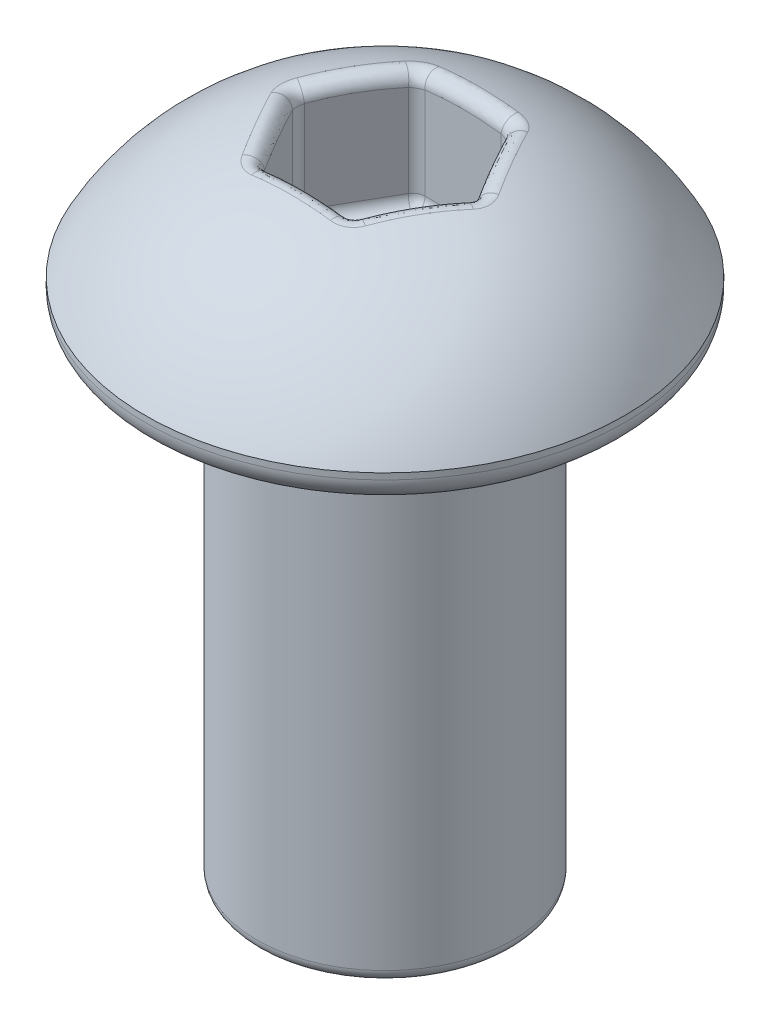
ISO-10303-21;
HEADER;
FILE_DESCRIPTION(('STEP AP214'),'2;1');
FILE_NAME('part.step','',(''),(''),'','','');
FILE_SCHEMA(('AUTOMOTIVE_DESIGN { 1 0 10303 214 1 1 1 1 }'));
ENDSEC;
DATA;
#1=APPLICATION_CONTEXT('core data for automotive mechanical design processes');
#2=APPLICATION_PROTOCOL_DEFINITION('international standard','automotive_design',2000,#1);
#3=PRODUCT_CONTEXT('',#1,'mechanical');
#4=PRODUCT('Part','Part','',(#3));
#5=PRODUCT_RELATED_PRODUCT_CATEGORY('part','',(#4));
#6=PRODUCT_DEFINITION_FORMATION('','',#4);
#7=PRODUCT_DEFINITION_CONTEXT('part definition',#1,'design');
#8=PRODUCT_DEFINITION('design','',#6,#7);
#9=PRODUCT_DEFINITION_SHAPE('','',#8);
#10=(LENGTH_UNIT() NAMED_UNIT(*) SI_UNIT(.MILLI.,.METRE.));
#11=(NAMED_UNIT(*) PLANE_ANGLE_UNIT() SI_UNIT($,.RADIAN.));
#12=(NAMED_UNIT(*) SI_UNIT($,.STERADIAN.) SOLID_ANGLE_UNIT());
#13=UNCERTAINTY_MEASURE_WITH_UNIT(LENGTH_MEASURE(1.E-05),#10,'distance_accuracy_value','');
#14=(GEOMETRIC_REPRESENTATION_CONTEXT(3) GLOBAL_UNCERTAINTY_ASSIGNED_CONTEXT((#13)) GLOBAL_UNIT_ASSIGNED_CONTEXT((#10,
#11,#12)) REPRESENTATION_CONTEXT('',''));
#15=CARTESIAN_POINT('',(0.,0.,0.));
#16=DIRECTION('',(0.,0.,1.));
#17=DIRECTION('',(1.,0.,0.));
#18=AXIS2_PLACEMENT_3D('',#15,#16,#17);
#19=CARTESIAN_POINT('',(0.,-1.40483557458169,0.));
#20=DIRECTION('',(0.,-1.,0.));
#21=DIRECTION('',(1.,0.,0.));
#22=AXIS2_PLACEMENT_3D('',#19,#20,#21);
#23=DEGENERATE_TOROIDAL_SURFACE('',#22,0.382671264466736,3.99999999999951,.T.);
#24=CARTESIAN_POINT('',(0.,0.499999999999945,0.));
#25=DIRECTION('',(0.,-1.,0.));
#26=DIRECTION('',(1.,0.,0.));
#27=AXIS2_PLACEMENT_3D('',#24,#25,#26);
#28=CIRCLE('',#27,3.90000000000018);
#29=CARTESIAN_POINT('',(3.90000000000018,0.499999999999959,0.));
#30=VERTEX_POINT('',#29);
#31=EDGE_CURVE('E682',#30,#30,#28,.T.);
#32=ORIENTED_EDGE('',*,*,#31,.F.);
#33=EDGE_LOOP('',(#32));
#34=FACE_BOUND('',#33,.T.);
#35=CARTESIAN_POINT('',(0.81376509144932,2.2177897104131,1.10979800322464));
#36=CARTESIAN_POINT('',(0.804193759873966,2.46880573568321,1.15693564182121));
#37=CARTESIAN_POINT('',(1.04961944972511,2.40845419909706,1.19496898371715));
#38=CARTESIAN_POINT('',(0.811639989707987,2.21367801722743,1.12030600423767));
#39=CARTESIAN_POINT('',(0.799776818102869,2.46786250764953,1.16556637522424));
#40=CARTESIAN_POINT('',(1.04531437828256,2.40412610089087,1.21694270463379));
#41=CARTESIAN_POINT('',(0.808648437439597,2.2098293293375,1.13066640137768));
#42=CARTESIAN_POINT('',(0.794913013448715,2.46712556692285,1.17342079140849));
#43=CARTESIAN_POINT('',(1.03919416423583,2.40007485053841,1.23860299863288));
#44=CARTESIAN_POINT('',(0.801020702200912,2.20277525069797,1.15082418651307));
#45=CARTESIAN_POINT('',(0.784555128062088,2.46596419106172,1.18784977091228));
#46=CARTESIAN_POINT('',(1.02350740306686,2.39264950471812,1.28073622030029));
#47=CARTESIAN_POINT('',(0.796384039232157,2.1995700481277,1.16062140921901));
#48=CARTESIAN_POINT('',(0.779063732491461,2.46554493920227,1.19439309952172));
#49=CARTESIAN_POINT('',(1.01393985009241,2.38927560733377,1.30120879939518));
#50=CARTESIAN_POINT('',(0.785526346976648,2.19390745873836,1.17942943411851));
#51=CARTESIAN_POINT('',(0.767786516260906,2.46493467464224,1.20632437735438));
#52=CARTESIAN_POINT('',(0.991484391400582,2.38331498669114,1.34049879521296));
#53=CARTESIAN_POINT('',(0.779296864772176,2.19145422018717,1.18843568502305));
#54=CARTESIAN_POINT('',(0.762011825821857,2.46474813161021,1.21167731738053));
#55=CARTESIAN_POINT('',(0.97857876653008,2.38073263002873,1.35930663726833));
#56=CARTESIAN_POINT('',(0.765425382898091,2.18741399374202,1.20533565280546));
#57=CARTESIAN_POINT('',(0.750401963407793,2.46450594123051,1.22144200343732));
#58=CARTESIAN_POINT('',(0.949805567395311,2.37647976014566,1.3945844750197));
#59=CARTESIAN_POINT('',(0.757783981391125,2.18582664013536,1.21322983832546));
#60=CARTESIAN_POINT('',(0.744584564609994,2.46445160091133,1.22583177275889));
#61=CARTESIAN_POINT('',(0.933939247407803,2.374808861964,1.41105545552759));
#62=CARTESIAN_POINT('',(0.741284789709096,2.1835799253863,1.22768060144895));
#63=CARTESIAN_POINT('',(0.732906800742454,2.46439057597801,1.23397188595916));
#64=CARTESIAN_POINT('',(0.899655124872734,2.37244389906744,1.44118816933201));
#65=CARTESIAN_POINT('',(0.732425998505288,2.18292133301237,1.23423606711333));
#66=CARTESIAN_POINT('',(0.727066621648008,2.46438423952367,1.23770476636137));
#67=CARTESIAN_POINT('',(0.881235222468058,2.37175064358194,1.45484756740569));
#68=CARTESIAN_POINT('',(0.713749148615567,2.18256191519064,1.24580575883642));
#69=CARTESIAN_POINT('',(0.71518738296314,2.46437955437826,1.24476598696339));
#70=CARTESIAN_POINT('',(0.842381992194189,2.37137230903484,1.47893076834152));
#71=CARTESIAN_POINT('',(0.703931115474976,2.18286106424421,1.25082002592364));
#72=CARTESIAN_POINT('',(0.709169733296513,2.46438121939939,1.24808125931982));
#73=CARTESIAN_POINT('',(0.821948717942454,2.37168720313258,1.48935465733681));
#74=CARTESIAN_POINT('',(0.683718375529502,2.18439728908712,1.25912529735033));
#75=CARTESIAN_POINT('',(0.696717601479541,2.46441118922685,1.2543630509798));
#76=CARTESIAN_POINT('',(0.779868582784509,2.37330428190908,1.50658658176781));
#77=CARTESIAN_POINT('',(0.673330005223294,2.18562546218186,1.26243216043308));
#78=CARTESIAN_POINT('',(0.690310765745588,2.4644391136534,1.25732246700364));
#79=CARTESIAN_POINT('',(0.758235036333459,2.37459709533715,1.51342790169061));
#80=CARTESIAN_POINT('',(0.65218438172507,2.18896024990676,1.26731485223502));
#81=CARTESIAN_POINT('',(0.676756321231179,2.46459012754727,1.2628234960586));
#82=CARTESIAN_POINT('',(0.714190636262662,2.3781073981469,1.52347806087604));
#83=CARTESIAN_POINT('',(0.641426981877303,2.19106721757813,1.26888998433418));
#84=CARTESIAN_POINT('',(0.669634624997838,2.46471242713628,1.26535873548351));
#85=CARTESIAN_POINT('',(0.691779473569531,2.38032525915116,1.52668543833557));
#86=CARTESIAN_POINT('',(0.619757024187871,2.19610017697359,1.27028648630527));
#87=CARTESIAN_POINT('',(0.654402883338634,2.46515272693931,1.26976255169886));
#88=CARTESIAN_POINT('',(0.64662804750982,2.38562311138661,1.52941979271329));
#89=CARTESIAN_POINT('',(0.608843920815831,2.19903286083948,1.27009310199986));
#90=CARTESIAN_POINT('',(0.646314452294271,2.46546996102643,1.2716256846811));
#91=CARTESIAN_POINT('',(0.623886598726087,2.38871014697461,1.52891581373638));
#92=CARTESIAN_POINT('',(0.58724406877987,2.20559641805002,1.26795759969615));
#93=CARTESIAN_POINT('',(0.629229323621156,2.46639870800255,1.27427287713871));
#94=CARTESIAN_POINT('',(0.578871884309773,2.39561915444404,1.52423929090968));
#95=CARTESIAN_POINT('',(0.576557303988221,2.20922724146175,1.26601560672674));
#96=CARTESIAN_POINT('',(0.620262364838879,2.46700578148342,1.27506638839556));
#97=CARTESIAN_POINT('',(0.5565985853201,2.39944107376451,1.5200670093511));
#98=CARTESIAN_POINT('',(0.566129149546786,2.21315070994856,1.26321946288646));
#99=CARTESIAN_POINT('',(0.6107901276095,2.46780858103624,1.27515458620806));
#100=CARTESIAN_POINT('',(0.53486363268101,2.40357104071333,1.51410308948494));
#101=(BOUNDED_SURFACE() B_SPLINE_SURFACE(3,2,((#35,#36,#37),(#38,#39,#40),(#41,#42,#43),(#44,
#45,#46),(#47,#48,#49),(#50,#51,#52),(#53,#54,#55),(#56,#57,#58),(#59,#60,#61),(#62,#63,#64),
(#65,#66,#67),(#68,#69,#70),(#71,#72,#73),(#74,#75,#76),(#77,#78,#79),(#80,#81,#82),(#83,#84,
#85),(#86,#87,#88),(#89,#90,#91),(#92,#93,#94),(#95,#96,#97),(#98,#99,#100)),.UNSPECIFIED.,.F.,
.F.,.F.) B_SPLINE_SURFACE_WITH_KNOTS((4,2,2,2,2,2,2,2,2,2,4),(3,3),(0.,0.065433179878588,
0.130885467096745,0.196692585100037,0.26247188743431,0.328305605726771,0.394137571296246,
0.459346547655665,0.524581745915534,0.590361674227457,0.656136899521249),(0.,1.),
.UNSPECIFIED.) GEOMETRIC_REPRESENTATION_ITEM() RATIONAL_B_SPLINE_SURFACE(((1.,0.616267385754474,
1.),(1.,0.612016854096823,1.),(1.,0.607994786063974,1.),(1.,0.600564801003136,1.),(1.,
0.597157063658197,1.),(1.,0.591099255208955,1.),(1.,0.588453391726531,1.),(1.,0.584078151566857,
1.),(1.,0.582348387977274,1.),(1.,0.57989590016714,1.),(1.,0.579174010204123,1.),(1.,
0.57878035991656,1.),(1.,0.579108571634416,1.),(1.,0.580788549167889,1.),(1.,0.582130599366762,
1.),(1.,0.585754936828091,1.),(1.,0.588037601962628,1.),(1.,0.593450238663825,1.),(1.,
0.596587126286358,1.),(1.,0.603545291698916,1.),(1.,0.607366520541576,1.),(1.,0.611453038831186,1.))) REPRESENTATION_ITEM('') SURFACE());
#102=CARTESIAN_POINT('',(0.53486363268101,2.40357104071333,1.51410308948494));
#103=CARTESIAN_POINT('',(0.5565985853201,2.39944107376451,1.5200670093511));
#104=CARTESIAN_POINT('',(0.578871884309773,2.39561915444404,1.52423929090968));
#105=CARTESIAN_POINT('',(0.623886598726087,2.38871014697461,1.52891581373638));
#106=CARTESIAN_POINT('',(0.64662804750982,2.38562311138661,1.52941979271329));
#107=CARTESIAN_POINT('',(0.691779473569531,2.38032525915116,1.52668543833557));
#108=CARTESIAN_POINT('',(0.714190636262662,2.3781073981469,1.52347806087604));
#109=CARTESIAN_POINT('',(0.758235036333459,2.37459709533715,1.51342790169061));
#110=CARTESIAN_POINT('',(0.779868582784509,2.37330428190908,1.50658658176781));
#111=CARTESIAN_POINT('',(0.821948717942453,2.37168720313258,1.48935465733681));
#112=CARTESIAN_POINT('',(0.842381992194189,2.37137230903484,1.47893076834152));
#113=CARTESIAN_POINT('',(0.881235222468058,2.37175064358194,1.45484756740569));
#114=CARTESIAN_POINT('',(0.899655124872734,2.37244389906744,1.44118816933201));
#115=CARTESIAN_POINT('',(0.933939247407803,2.374808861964,1.41105545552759));
#116=CARTESIAN_POINT('',(0.949805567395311,2.37647976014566,1.3945844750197));
#117=CARTESIAN_POINT('',(0.97857876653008,2.38073263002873,1.35930663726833));
#118=CARTESIAN_POINT('',(0.991484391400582,2.38331498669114,1.34049879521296));
#119=CARTESIAN_POINT('',(1.01393985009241,2.38927560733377,1.30120879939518));
#120=CARTESIAN_POINT('',(1.02350740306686,2.39264950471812,1.28073622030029));
#121=CARTESIAN_POINT('',(1.03919416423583,2.40007485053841,1.23860299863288));
#122=CARTESIAN_POINT('',(1.04531437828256,2.40412610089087,1.21694270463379));
#123=CARTESIAN_POINT('',(1.04961944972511,2.40845419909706,1.19496898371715));
#124=B_SPLINE_CURVE_WITH_KNOTS('',3,(#102,#103,#104,#105,#106,#107,#108,#109,#110,#111,#112,
#113,#114,#115,#116,#117,#118,#119,#120,#121,#122,#123),.UNSPECIFIED.,.F.,.F.,(4,2,2,2,2,2,2,2,
2,2,4),(0.,0.0657752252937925,0.131555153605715,0.196790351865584,0.261999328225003,
0.327831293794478,0.39366501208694,0.459444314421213,0.525251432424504,0.590703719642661,
0.656136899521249),.UNSPECIFIED.);
#125=CARTESIAN_POINT('',(0.642475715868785,2.38630335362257,1.52880080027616));
#126=VERTEX_POINT('',#125);
#127=CARTESIAN_POINT('',(1.00274247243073,2.38630335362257,1.32080069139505));
#128=VERTEX_POINT('',#127);
#129=EDGE_CURVE('E684',#126,#128,#124,.T.);
#130=ORIENTED_EDGE('',*,*,#129,.F.);
#131=CARTESIAN_POINT('',(1.60039960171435,1.94695754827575,1.27));
#132=CARTESIAN_POINT('',(1.70226452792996,2.20589682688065,1.27));
#133=CARTESIAN_POINT('',(1.66979814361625,2.12336771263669,1.53374399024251));
#134=CARTESIAN_POINT('',(1.50293327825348,1.98531873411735,1.27));
#135=CARTESIAN_POINT('',(1.59771411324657,2.24629850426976,1.27));
#136=CARTESIAN_POINT('',(1.5676215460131,2.16374790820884,1.5332980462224));
#137=CARTESIAN_POINT('',(1.40396926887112,2.01966528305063,1.27));
#138=CARTESIAN_POINT('',(1.49153991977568,2.28236671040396,1.27));
#139=CARTESIAN_POINT('',(1.46392625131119,2.19990217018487,1.53281110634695));
#140=CARTESIAN_POINT('',(1.2037094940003,2.08051155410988,1.27));
#141=CARTESIAN_POINT('',(1.27705614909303,2.34591059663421,1.27));
#142=CARTESIAN_POINT('',(1.25426979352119,2.26395087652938,1.53179043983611));
#143=CARTESIAN_POINT('',(1.10241497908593,2.10701538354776,1.27));
#144=CARTESIAN_POINT('',(1.16879032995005,2.37341217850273,1.27));
#145=CARTESIAN_POINT('',(1.14830984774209,2.29184964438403,1.53125673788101));
#146=CARTESIAN_POINT('',(0.79692997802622,2.1748555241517,1.27));
#147=CARTESIAN_POINT('',(0.843476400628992,2.44315485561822,1.27));
#148=CARTESIAN_POINT('',(0.829128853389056,2.36326031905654,1.52964302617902));
#149=CARTESIAN_POINT('',(0.590118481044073,2.20491221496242,1.27));
#150=CARTESIAN_POINT('',(0.623642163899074,2.47349339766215,1.27));
#151=CARTESIAN_POINT('',(0.613536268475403,2.39489894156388,1.52854508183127));
#152=CARTESIAN_POINT('',(0.318779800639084,2.22633202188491,1.27));
#153=CARTESIAN_POINT('',(0.336395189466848,2.49488185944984,1.27));
#154=CARTESIAN_POINT('',(0.331274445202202,2.41744610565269,1.52767179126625));
#155=CARTESIAN_POINT('',(0.254942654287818,2.23007566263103,1.27));
#156=CARTESIAN_POINT('',(0.268960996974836,2.49859464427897,1.27));
#157=CARTESIAN_POINT('',(0.264910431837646,2.42138677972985,1.52750713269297));
#158=CARTESIAN_POINT('',(0.127147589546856,2.2350533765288,1.27));
#159=CARTESIAN_POINT('',(0.134104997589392,2.5035211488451,1.27));
#160=CARTESIAN_POINT('',(0.132098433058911,2.42662647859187,1.52728445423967));
#161=CARTESIAN_POINT('',(0.0631896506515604,2.2362869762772,1.27));
#162=CARTESIAN_POINT('',(0.0666327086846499,2.50473819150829,1.27));
#163=CARTESIAN_POINT('',(0.0656504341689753,2.42792500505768,1.52722645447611));
#164=CARTESIAN_POINT('',(-0.127917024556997,2.23626332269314,1.27));
#165=CARTESIAN_POINT('',(-0.134888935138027,2.50471788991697,1.27));
#166=CARTESIAN_POINT('',(-0.132898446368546,2.42790010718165,1.52723056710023));
#167=CARTESIAN_POINT('',(-0.255082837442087,2.23134224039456,1.27));
#168=CARTESIAN_POINT('',(-0.269200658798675,2.49986575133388,1.27));
#169=CARTESIAN_POINT('',(-0.265018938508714,2.42272002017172,1.52746790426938));
#170=CARTESIAN_POINT('',(-0.508647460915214,2.21136160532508,1.27));
#171=CARTESIAN_POINT('',(-0.537226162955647,2.47994725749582,1.27));
#172=CARTESIAN_POINT('',(-0.528779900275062,2.40168777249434,1.52828173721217));
#173=CARTESIAN_POINT('',(-0.635046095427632,2.19629980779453,1.27));
#174=CARTESIAN_POINT('',(-0.671260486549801,2.46482531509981,1.27));
#175=CARTESIAN_POINT('',(-0.660420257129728,2.38583324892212,1.52885830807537));
#176=CARTESIAN_POINT('',(-0.88668677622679,2.15519378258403,1.27));
#177=CARTESIAN_POINT('',(-0.938705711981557,2.42302328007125,1.27));
#178=CARTESIAN_POINT('',(-0.922887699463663,2.34256374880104,1.53010524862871));
#179=CARTESIAN_POINT('',(-1.01192070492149,2.12909878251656,1.27));
#180=CARTESIAN_POINT('',(-1.07219467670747,2.39622418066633,1.27));
#181=CARTESIAN_POINT('',(-1.05370815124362,2.31509532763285,1.53077604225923));
#182=CARTESIAN_POINT('',(-1.25951181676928,2.0653793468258,1.27));
#183=CARTESIAN_POINT('',(-1.33686520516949,2.33016216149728,1.27));
#184=CARTESIAN_POINT('',(-1.31264623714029,2.24802223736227,1.53208488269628));
#185=CARTESIAN_POINT('',(-1.38186667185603,2.02774590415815,1.27));
#186=CARTESIAN_POINT('',(-1.46800514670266,2.29083746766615,1.27));
#187=CARTESIAN_POINT('',(-1.44076167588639,2.20840808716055,1.53272290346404));
#188=CARTESIAN_POINT('',(-1.50212261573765,1.9840926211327,1.27));
#189=CARTESIAN_POINT('',(-1.59671772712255,2.24501531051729,1.27));
#190=CARTESIAN_POINT('',(-1.56678706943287,2.16245726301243,1.53328161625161));
#191=(BOUNDED_SURFACE() B_SPLINE_SURFACE(3,2,((#131,#132,#133),(#134,#135,#136),(#137,#138,
#139),(#140,#141,#142),(#143,#144,#145),(#146,#147,#148),(#149,#150,#151),(#152,#153,#154),
(#155,#156,#157),(#158,#159,#160),(#161,#162,#163),(#164,#165,#166),(#167,#168,#169),(#170,#171,
#172),(#173,#174,#175),(#176,#177,#178),(#179,#180,#181),(#182,#183,#184),(#185,#186,#187),
(#188,#189,#190)),.UNSPECIFIED.,.F.,.F.,.F.) B_SPLINE_SURFACE_WITH_KNOTS((4,2,2,2,2,2,2,2,2,4),
(3,3),(0.,0.314008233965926,0.627851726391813,1.25229499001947,1.44412000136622,
1.63598118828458,2.01735042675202,2.39880411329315,2.78203260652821,3.1655610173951),(0.,1.),
.UNSPECIFIED.) GEOMETRIC_REPRESENTATION_ITEM() RATIONAL_B_SPLINE_SURFACE(((1.,0.583643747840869,
1.),(1.,0.584598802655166,1.),(1.,0.58563924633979,1.),(1.,0.587813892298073,1.),(1.,
0.588948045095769,1.),(1.,0.592365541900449,1.),(1.,0.594675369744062,1.),(1.,0.596507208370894,
1.),(1.,0.596851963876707,1.),(1.,0.597318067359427,1.),(1.,0.597439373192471,1.),(1.,
0.597430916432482,1.),(1.,0.596934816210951,1.),(1.,0.59522783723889,1.),(1.,0.594016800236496,
1.),(1.,0.591387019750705,1.),(1.,0.589967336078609,1.),(1.,0.587188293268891,1.),(1.,
0.585828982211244,1.),(1.,0.58463318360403,1.))) REPRESENTATION_ITEM('') SURFACE());
#192=CARTESIAN_POINT('',(1.66979814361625,2.12336771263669,1.53374399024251));
#193=CARTESIAN_POINT('',(1.5676215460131,2.16374790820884,1.5332980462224));
#194=CARTESIAN_POINT('',(1.46392625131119,2.19990217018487,1.53281110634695));
#195=CARTESIAN_POINT('',(1.25426979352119,2.26395087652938,1.53179043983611));
#196=CARTESIAN_POINT('',(1.14830984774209,2.29184964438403,1.53125673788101));
#197=CARTESIAN_POINT('',(0.829128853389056,2.36326031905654,1.52964302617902));
#198=CARTESIAN_POINT('',(0.613536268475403,2.39489894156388,1.52854508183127));
#199=CARTESIAN_POINT('',(0.331274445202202,2.41744610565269,1.52767179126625));
#200=CARTESIAN_POINT('',(0.264910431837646,2.42138677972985,1.52750713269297));
#201=CARTESIAN_POINT('',(0.132098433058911,2.42662647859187,1.52728445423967));
#202=CARTESIAN_POINT('',(0.0656504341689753,2.42792500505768,1.52722645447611));
#203=CARTESIAN_POINT('',(-0.132898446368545,2.42790010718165,1.52723056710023));
#204=CARTESIAN_POINT('',(-0.265018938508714,2.42272002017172,1.52746790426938));
#205=CARTESIAN_POINT('',(-0.528779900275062,2.40168777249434,1.52828173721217));
#206=CARTESIAN_POINT('',(-0.660420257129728,2.38583324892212,1.52885830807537));
#207=CARTESIAN_POINT('',(-0.922887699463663,2.34256374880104,1.53010524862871));
#208=CARTESIAN_POINT('',(-1.05370815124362,2.31509532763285,1.53077604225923));
#209=CARTESIAN_POINT('',(-1.31264623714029,2.24802223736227,1.53208488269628));
#210=CARTESIAN_POINT('',(-1.44076167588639,2.20840808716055,1.53272290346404));
#211=CARTESIAN_POINT('',(-1.56678706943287,2.16245726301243,1.53328161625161));
#212=B_SPLINE_CURVE_WITH_KNOTS('',3,(#192,#193,#194,#195,#196,#197,#198,#199,#200,#201,#202,
#203,#204,#205,#206,#207,#208,#209,#210,#211),.UNSPECIFIED.,.F.,.F.,(4,2,2,2,2,2,2,2,2,4),(0.,
0.314008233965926,0.627851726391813,1.25229499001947,1.44412000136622,1.63598118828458,
2.01735042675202,2.39880411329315,2.78203260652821,3.1655610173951),.UNSPECIFIED.);
#213=CARTESIAN_POINT('',(-0.642475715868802,2.38630335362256,1.52880080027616));
#214=VERTEX_POINT('',#213);
#215=EDGE_CURVE('E686',#126,#214,#212,.T.);
#216=ORIENTED_EDGE('',*,*,#215,.T.);
#217=CARTESIAN_POINT('',(-0.554388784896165,2.21772585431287,1.25969312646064));
#218=CARTESIAN_POINT('',(-0.599987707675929,2.46879125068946,1.27492761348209));
#219=CARTESIAN_POINT('',(-0.510393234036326,2.40838698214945,1.50659405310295));
#220=CARTESIAN_POINT('',(-0.564528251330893,2.21362753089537,1.26308942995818));
#221=CARTESIAN_POINT('',(-0.609641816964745,2.46785249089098,1.2754085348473));
#222=CARTESIAN_POINT('',(-0.531527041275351,2.40407295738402,1.51381605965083));
#223=CARTESIAN_POINT('',(-0.574970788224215,2.20979118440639,1.26566563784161));
#224=CARTESIAN_POINT('',(-0.618848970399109,2.46711876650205,1.27511925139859));
#225=CARTESIAN_POINT('',(-0.5532921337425,2.40003469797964,1.5193179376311));
#226=CARTESIAN_POINT('',(-0.596188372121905,2.20275870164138,1.2691209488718));
#227=CARTESIAN_POINT('',(-0.636473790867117,2.46596202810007,1.27336192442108));
#228=CARTESIAN_POINT('',(-0.597512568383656,2.39263208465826,1.52676163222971));
#229=CARTESIAN_POINT('',(-0.606963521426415,2.19956276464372,1.2699995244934));
#230=CARTESIAN_POINT('',(-0.644863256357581,2.46554415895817,1.2718806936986));
#231=CARTESIAN_POINT('',(-0.619968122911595,2.38926794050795,1.52870234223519));
#232=CARTESIAN_POINT('',(-0.628652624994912,2.1939074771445,1.27000047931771));
#233=CARTESIAN_POINT('',(-0.660814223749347,2.46493467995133,1.26808482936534));
#234=CARTESIAN_POINT('',(-0.665163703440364,2.38331500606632,1.52890004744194));
#235=CARTESIAN_POINT('',(-0.639566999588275,2.1914542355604,1.26910872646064));
#236=CARTESIAN_POINT('',(-0.668337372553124,2.46474813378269,1.26576027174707));
#237=CARTESIAN_POINT('',(-0.687904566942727,2.38073264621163,1.52712739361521));
#238=CARTESIAN_POINT('',(-0.661138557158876,2.18741399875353,1.26554566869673));
#239=CARTESIAN_POINT('',(-0.682598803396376,2.46450594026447,1.26058817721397));
#240=CARTESIAN_POINT('',(-0.732842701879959,2.37647976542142,1.51984802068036));
#241=CARTESIAN_POINT('',(-0.67179584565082,2.1858266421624,1.26287510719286));
#242=CARTESIAN_POINT('',(-0.689309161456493,2.46445160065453,1.25774504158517));
#243=CARTESIAN_POINT('',(-0.755040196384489,2.37480886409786,1.51434286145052));
#244=CARTESIAN_POINT('',(-0.69256019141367,2.1835799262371,1.25581175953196));
#245=CARTESIAN_POINT('',(-0.702197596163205,2.4643905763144,1.25170185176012));
#246=CARTESIAN_POINT('',(-0.798277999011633,2.37244389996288,1.49971827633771));
#247=CARTESIAN_POINT('',(-0.702666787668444,2.18292133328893,1.25141755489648));
#248=CARTESIAN_POINT('',(-0.708350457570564,2.46438423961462,1.24851054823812));
#249=CARTESIAN_POINT('',(-0.81931733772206,2.37175064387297,1.4905958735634));
#250=CARTESIAN_POINT('',(-0.722024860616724,2.18256191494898,1.241027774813));
#251=CARTESIAN_POINT('',(-0.720405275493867,2.4643795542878,1.24175343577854));
#252=CARTESIAN_POINT('',(-0.859600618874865,2.37137230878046,1.46898959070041));
#253=CARTESIAN_POINT('',(-0.731276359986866,2.18286106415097,1.23503224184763));
#254=CARTESIAN_POINT('',(-0.726285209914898,2.46438121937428,1.23819963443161));
#255=CARTESIAN_POINT('',(-0.878844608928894,2.37168720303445,1.45650579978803));
#256=CARTESIAN_POINT('',(-0.748575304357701,2.18439728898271,1.22168013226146));
#257=CARTESIAN_POINT('',(-0.737951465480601,2.46441118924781,1.23055666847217));
#258=CARTESIAN_POINT('',(-0.914807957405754,2.37330428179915,1.42867929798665));
#259=CARTESIAN_POINT('',(-0.756633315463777,2.1856254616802,1.21433697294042));
#260=CARTESIAN_POINT('',(-0.743717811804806,2.46443911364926,1.22648789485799));
#261=CARTESIAN_POINT('',(-0.931549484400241,2.374597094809,1.41336476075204));
#262=CARTESIAN_POINT('',(-0.771434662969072,2.18896024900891,1.19846567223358));
#263=CARTESIAN_POINT('',(-0.755259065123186,2.46459012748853,1.2174999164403));
#264=CARTESIAN_POINT('',(-0.962275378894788,2.37810739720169,1.38024627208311));
#265=CARTESIAN_POINT('',(-0.778177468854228,2.19106721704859,1.18993705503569));
#266=CARTESIAN_POINT('',(-0.761015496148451,2.46471242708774,1.21259996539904));
#267=CARTESIAN_POINT('',(-0.976258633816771,2.38032525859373,1.36244132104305));
#268=CARTESIAN_POINT('',(-0.790221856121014,2.19610017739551,1.17186856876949));
#269=CARTESIAN_POINT('',(-0.772445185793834,2.46515272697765,1.20161079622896));
#270=CARTESIAN_POINT('',(-1.00120237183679,2.38562311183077,1.32470620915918));
#271=CARTESIAN_POINT('',(-0.79551093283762,2.19903286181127,1.16232085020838));
#272=CARTESIAN_POINT('',(-0.778102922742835,2.46546996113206,1.19553757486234));
#273=CARTESIAN_POINT('',(-1.01213663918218,2.38871014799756,1.30475954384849));
#274=CARTESIAN_POINT('',(-0.804461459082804,2.205596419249,1.14254707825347));
#275=CARTESIAN_POINT('',(-0.788938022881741,2.46639870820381,1.18206501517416));
#276=CARTESIAN_POINT('',(-1.0305940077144,2.39561915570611,1.26343739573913));
#277=CARTESIAN_POINT('',(-0.80812302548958,2.20922724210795,1.1323210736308));
#278=CARTESIAN_POINT('',(-0.794108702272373,2.46700578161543,1.17469615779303));
#279=CARTESIAN_POINT('',(-1.03811735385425,2.39944107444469,1.2420620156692));
#280=CARTESIAN_POINT('',(-0.81091557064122,2.21315070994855,1.12189195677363));
#281=CARTESIAN_POINT('',(-0.798921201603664,2.46780858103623,1.1665370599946));
#282=CARTESIAN_POINT('',(-1.04381992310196,2.40357104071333,1.22025703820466));
#283=(BOUNDED_SURFACE() B_SPLINE_SURFACE(3,2,((#217,#218,#219),(#220,#221,#222),(#223,#224,
#225),(#226,#227,#228),(#229,#230,#231),(#232,#233,#234),(#235,#236,#237),(#238,#239,#240),
(#241,#242,#243),(#244,#245,#246),(#247,#248,#249),(#250,#251,#252),(#253,#254,#255),(#256,#257,
#258),(#259,#260,#261),(#262,#263,#264),(#265,#266,#267),(#268,#269,#270),(#271,#272,#273),
(#274,#275,#276),(#277,#278,#279),(#280,#281,#282)),.UNSPECIFIED.,.F.,.F.,
.F.) B_SPLINE_SURFACE_WITH_KNOTS((4,2,2,2,2,2,2,2,2,2,4),(3,3),(0.,0.0652634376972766,
0.130547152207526,0.196354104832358,0.262133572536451,0.327967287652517,0.393799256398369,
0.459008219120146,0.524243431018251,0.590023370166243,0.655798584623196),(0.,1.),
.UNSPECIFIED.) GEOMETRIC_REPRESENTATION_ITEM() RATIONAL_B_SPLINE_SURFACE(((1.,0.616201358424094,
1.),(1.,0.611964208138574,1.),(1.,0.607954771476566,1.),(1.,0.600547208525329,1.),(1.,
0.597149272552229,1.),(1.,0.591099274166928,1.),(1.,0.588453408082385,1.),(1.,0.584078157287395,
1.),(1.,0.582348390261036,1.),(1.,0.579895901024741,1.),(1.,0.579174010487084,1.),(1.,
0.57878035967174,1.),(1.,0.579108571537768,1.),(1.,0.580788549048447,1.),(1.,0.582130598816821,
1.),(1.,0.58575493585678,1.),(1.,0.588037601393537,1.),(1.,0.593450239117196,1.),(1.,
0.596587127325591,1.),(1.,0.603545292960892,1.),(1.,0.60736652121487,1.),(1.,0.611453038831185,1.))) REPRESENTATION_ITEM('') SURFACE());
#284=CARTESIAN_POINT('',(-1.04381992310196,2.40357104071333,1.22025703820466));
#285=CARTESIAN_POINT('',(-1.03811735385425,2.39944107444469,1.2420620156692));
#286=CARTESIAN_POINT('',(-1.0305940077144,2.39561915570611,1.26343739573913));
#287=CARTESIAN_POINT('',(-1.01213663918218,2.38871014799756,1.30475954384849));
#288=CARTESIAN_POINT('',(-1.00120237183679,2.38562311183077,1.32470620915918));
#289=CARTESIAN_POINT('',(-0.976258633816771,2.38032525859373,1.36244132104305));
#290=CARTESIAN_POINT('',(-0.962275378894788,2.37810739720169,1.38024627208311));
#291=CARTESIAN_POINT('',(-0.931549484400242,2.374597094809,1.41336476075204));
#292=CARTESIAN_POINT('',(-0.914807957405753,2.37330428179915,1.42867929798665));
#293=CARTESIAN_POINT('',(-0.878844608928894,2.37168720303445,1.45650579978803));
#294=CARTESIAN_POINT('',(-0.859600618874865,2.37137230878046,1.46898959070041));
#295=CARTESIAN_POINT('',(-0.81931733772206,2.37175064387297,1.4905958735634));
#296=CARTESIAN_POINT('',(-0.798277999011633,2.37244389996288,1.49971827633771));
#297=CARTESIAN_POINT('',(-0.755040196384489,2.37480886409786,1.51434286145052));
#298=CARTESIAN_POINT('',(-0.732842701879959,2.37647976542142,1.51984802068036));
#299=CARTESIAN_POINT('',(-0.687904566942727,2.38073264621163,1.52712739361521));
#300=CARTESIAN_POINT('',(-0.665163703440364,2.38331500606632,1.52890004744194));
#301=CARTESIAN_POINT('',(-0.619968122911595,2.38926794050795,1.52870234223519));
#302=CARTESIAN_POINT('',(-0.597512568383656,2.39263208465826,1.52676163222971));
#303=CARTESIAN_POINT('',(-0.5532921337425,2.40003469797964,1.5193179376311));
#304=CARTESIAN_POINT('',(-0.531527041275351,2.40407295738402,1.51381605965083));
#305=CARTESIAN_POINT('',(-0.510393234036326,2.40838698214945,1.50659405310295));
#306=B_SPLINE_CURVE_WITH_KNOTS('',3,(#284,#285,#286,#287,#288,#289,#290,#291,#292,#293,#294,
#295,#296,#297,#298,#299,#300,#301,#302,#303,#304,#305),.UNSPECIFIED.,.F.,.F.,(4,2,2,2,2,2,2,2,
2,2,4),(0.,0.0657752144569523,0.131555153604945,0.19679036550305,0.261999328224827,
0.327831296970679,0.393665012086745,0.459444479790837,0.52525143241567,0.590535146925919,
0.655798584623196),.UNSPECIFIED.);
#307=CARTESIAN_POINT('',(-1.00274247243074,2.38630335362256,1.32080069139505));
#308=VERTEX_POINT('',#307);
#309=EDGE_CURVE('E700',#308,#214,#306,.T.);
#310=ORIENTED_EDGE('',*,*,#309,.F.);
#311=CARTESIAN_POINT('',(-0.299333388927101,1.94670644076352,2.0215393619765));
#312=CARTESIAN_POINT('',(-0.248377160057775,2.20563191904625,2.10979813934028));
#313=CARTESIAN_POINT('',(-0.493030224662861,2.1231033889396,2.21354047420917));
#314=CARTESIAN_POINT('',(-0.348061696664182,1.9850837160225,1.93713945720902));
#315=CARTESIAN_POINT('',(-0.300647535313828,2.24605130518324,2.01926319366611));
#316=CARTESIAN_POINT('',(-0.543727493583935,2.16350052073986,2.12483862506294));
#317=CARTESIAN_POINT('',(-0.397539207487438,2.01944664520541,1.8514418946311));
#318=CARTESIAN_POINT('',(-0.35373014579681,2.28213751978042,1.92732141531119));
#319=CARTESIAN_POINT('',(-0.595149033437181,2.1996720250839,2.03480035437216));
#320=CARTESIAN_POINT('',(-0.497660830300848,2.08032582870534,1.67802615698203));
#321=CARTESIAN_POINT('',(-0.460964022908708,2.34571745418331,1.74158689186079));
#322=CARTESIAN_POINT('',(-0.699085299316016,2.26375537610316,1.85273665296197));
#323=CARTESIAN_POINT('',(-0.548304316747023,2.1068461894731,1.59030906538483));
#324=CARTESIAN_POINT('',(-0.515093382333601,2.37323704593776,1.64783209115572));
#325=CARTESIAN_POINT('',(-0.751599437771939,2.29167154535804,1.76071228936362));
#326=CARTESIAN_POINT('',(-0.701036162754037,2.17473515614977,1.3257697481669));
#327=CARTESIAN_POINT('',(-0.677740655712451,2.4430323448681,1.36611874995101));
#328=CARTESIAN_POINT('',(-0.909782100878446,2.36313361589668,1.48350452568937));
#329=CARTESIAN_POINT('',(-0.804436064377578,2.20482387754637,1.1466758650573));
#330=CARTESIAN_POINT('',(-0.78765253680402,2.47340468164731,1.17574578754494));
#331=CARTESIAN_POINT('',(-1.01662184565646,2.39480595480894,1.29625612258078));
#332=CARTESIAN_POINT('',(-0.940096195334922,2.2262839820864,0.911705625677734));
#333=CARTESIAN_POINT('',(-0.931267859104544,2.49483413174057,0.926996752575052));
#334=CARTESIAN_POINT('',(-1.15698638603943,2.41739553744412,1.05138849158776));
#335=CARTESIAN_POINT('',(-0.972010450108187,2.23003689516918,0.856428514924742));
#336=CARTESIAN_POINT('',(-0.964980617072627,2.49855621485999,0.86860454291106));
#337=CARTESIAN_POINT('',(-1.19002112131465,2.42134597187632,0.99384062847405));
#338=CARTESIAN_POINT('',(-1.03589955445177,2.23503362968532,0.745769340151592));
#339=CARTESIAN_POINT('',(-1.03240004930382,2.50350163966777,0.751830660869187));
#340=CARTESIAN_POINT('',(-1.25622499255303,2.4266056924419,0.87872520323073));
#341=CARTESIAN_POINT('',(-1.06787441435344,2.23627697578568,0.690387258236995));
#342=CARTESIAN_POINT('',(-1.06613193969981,2.50472831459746,0.693405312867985));
#343=CARTESIAN_POINT('',(-1.28939415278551,2.42791447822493,0.821157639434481));
#344=CARTESIAN_POINT('',(-1.16342360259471,2.2362833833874,0.524891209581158));
#345=CARTESIAN_POINT('',(-1.166888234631,2.50473770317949,0.518890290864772));
#346=CARTESIAN_POINT('',(-1.38866664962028,2.42792122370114,0.649218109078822));
#347=CARTESIAN_POINT('',(-1.2270067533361,2.23138233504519,0.414761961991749));
#348=CARTESIAN_POINT('',(-1.2340440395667,2.4999054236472,0.402573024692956));
#349=CARTESIAN_POINT('',(-1.45493171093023,2.42276222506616,0.534916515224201));
#350=CARTESIAN_POINT('',(-1.35379043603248,2.21144308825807,0.195166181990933));
#351=CARTESIAN_POINT('',(-1.36805701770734,2.48002886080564,0.170455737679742));
#352=CARTESIAN_POINT('',(-1.58751666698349,2.40177354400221,0.306897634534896));
#353=CARTESIAN_POINT('',(-1.41699088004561,2.19640264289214,0.0856998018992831));
#354=CARTESIAN_POINT('',(-1.43507468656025,2.46492906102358,0.0543777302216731));
#355=CARTESIAN_POINT('',(-1.65383657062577,2.38594149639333,0.1931804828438));
#356=CARTESIAN_POINT('',(-1.54281427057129,2.15534103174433,-0.13223270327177));
#357=CARTESIAN_POINT('',(-1.5687989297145,2.42317397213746,-0.177239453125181));
#358=CARTESIAN_POINT('',(-1.78615220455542,2.34271874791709,-0.0335039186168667));
#359=CARTESIAN_POINT('',(-1.60543316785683,2.12926915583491,-0.240691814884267));
#360=CARTESIAN_POINT('',(-1.63554474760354,2.3963997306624,-0.292846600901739));
#361=CARTESIAN_POINT('',(-1.85214499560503,2.31527466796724,-0.146465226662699));
#362=CARTESIAN_POINT('',(-1.72923380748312,2.06559702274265,-0.455120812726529));
#363=CARTESIAN_POINT('',(-1.76788412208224,2.33038906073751,-0.522065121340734));
#364=CARTESIAN_POINT('',(-1.98275235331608,2.24825136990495,-0.370065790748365));
#365=CARTESIAN_POINT('',(-1.79041438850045,2.02798777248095,-0.561088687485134));
#366=CARTESIAN_POINT('',(-1.83345697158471,2.29109082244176,-0.635640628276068));
#367=CARTESIAN_POINT('',(-2.04736580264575,2.20866268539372,-0.480703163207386));
#368=CARTESIAN_POINT('',(-1.85054624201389,1.98435888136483,-0.665240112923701));
#369=CARTESIAN_POINT('',(-1.89781681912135,2.24529535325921,-0.74711515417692));
#370=CARTESIAN_POINT('',(-2.11086637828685,2.16273753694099,-0.589571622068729));
#371=(BOUNDED_SURFACE() B_SPLINE_SURFACE(3,2,((#311,#312,#313),(#314,#315,#316),(#317,#318,
#319),(#320,#321,#322),(#323,#324,#325),(#326,#327,#328),(#329,#330,#331),(#332,#333,#334),
(#335,#336,#337),(#338,#339,#340),(#341,#342,#343),(#344,#345,#346),(#347,#348,#349),(#350,#351,
#352),(#353,#354,#355),(#356,#357,#358),(#359,#360,#361),(#362,#363,#364),(#365,#366,#367),
(#368,#369,#370)),.UNSPECIFIED.,.F.,.F.,.F.) B_SPLINE_SURFACE_WITH_KNOTS((4,2,2,2,2,2,2,2,2,4),
(3,3),(0.,0.313998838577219,0.627832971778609,1.25225488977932,1.44405567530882,
1.63589278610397,2.01726122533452,2.39871420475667,2.78194006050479,3.16546539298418),(0.,1.),
.UNSPECIFIED.) GEOMETRIC_REPRESENTATION_ITEM() RATIONAL_B_SPLINE_SURFACE(((1.,0.58363743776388,
1.),(1.,0.58459219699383,1.),(1.,0.585632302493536,1.),(1.,0.587806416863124,1.),(1.,
0.588940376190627,1.),(1.,0.592357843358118,1.),(1.,0.594668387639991,1.),(1.,0.596502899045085,
1.),(1.,0.596848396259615,1.),(1.,0.597316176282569,1.),(1.,0.597438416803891,1.),(1.,
0.597432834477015,1.),(1.,0.596938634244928,1.),(1.,0.595234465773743,1.),(1.,0.594024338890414,
1.),(1.,0.591395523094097,1.),(1.,0.589975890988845,1.),(1.,0.58719653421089,1.),(1.,
0.58583685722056,1.),(1.,0.584640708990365,1.))) REPRESENTATION_ITEM('') SURFACE());
#372=CARTESIAN_POINT('',(-0.493030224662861,2.1231033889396,2.21354047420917));
#373=CARTESIAN_POINT('',(-0.543727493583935,2.16350052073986,2.12483862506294));
#374=CARTESIAN_POINT('',(-0.595149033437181,2.1996720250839,2.03480035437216));
#375=CARTESIAN_POINT('',(-0.699085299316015,2.26375537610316,1.85273665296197));
#376=CARTESIAN_POINT('',(-0.751599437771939,2.29167154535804,1.76071228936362));
#377=CARTESIAN_POINT('',(-0.909782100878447,2.36313361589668,1.48350452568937));
#378=CARTESIAN_POINT('',(-1.01662184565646,2.39480595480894,1.29625612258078));
#379=CARTESIAN_POINT('',(-1.15698638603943,2.41739553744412,1.05138849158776));
#380=CARTESIAN_POINT('',(-1.19002112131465,2.42134597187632,0.993840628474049));
#381=CARTESIAN_POINT('',(-1.25622499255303,2.4266056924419,0.87872520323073));
#382=CARTESIAN_POINT('',(-1.28939415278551,2.42791447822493,0.821157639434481));
#383=CARTESIAN_POINT('',(-1.38866664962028,2.42792122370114,0.649218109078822));
#384=CARTESIAN_POINT('',(-1.45493171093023,2.42276222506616,0.534916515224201));
#385=CARTESIAN_POINT('',(-1.58751666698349,2.40177354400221,0.306897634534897));
#386=CARTESIAN_POINT('',(-1.65383657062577,2.38594149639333,0.1931804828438));
#387=CARTESIAN_POINT('',(-1.78615220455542,2.34271874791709,-0.0335039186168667));
#388=CARTESIAN_POINT('',(-1.85214499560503,2.31527466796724,-0.146465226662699));
#389=CARTESIAN_POINT('',(-1.98275235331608,2.24825136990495,-0.370065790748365));
#390=CARTESIAN_POINT('',(-2.04736580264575,2.20866268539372,-0.480703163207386));
#391=CARTESIAN_POINT('',(-2.11086637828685,2.16273753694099,-0.589571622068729));
#392=B_SPLINE_CURVE_WITH_KNOTS('',3,(#372,#373,#374,#375,#376,#377,#378,#379,#380,#381,#382,
#383,#384,#385,#386,#387,#388,#389,#390,#391),.UNSPECIFIED.,.F.,.F.,(4,2,2,2,2,2,2,2,2,4),(0.,
0.313998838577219,0.627832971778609,1.25225488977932,1.44405567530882,1.63589278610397,
2.01726122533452,2.39871420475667,2.78194006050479,3.16546539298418),.UNSPECIFIED.);
#393=CARTESIAN_POINT('',(-1.64521818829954,2.38630335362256,0.20800010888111));
#394=VERTEX_POINT('',#393);
#395=EDGE_CURVE('E833',#308,#394,#392,.T.);
#396=ORIENTED_EDGE('',*,*,#395,.T.);
#397=CARTESIAN_POINT('',(-1.36596653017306,2.21882721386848,0.151612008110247));
#398=CARTESIAN_POINT('',(-1.40270519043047,2.46904399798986,0.120004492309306));
#399=CARTESIAN_POINT('',(-1.55542215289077,2.40954630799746,0.315183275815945));
#400=CARTESIAN_POINT('',(-1.37443781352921,2.21449801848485,0.144337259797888));
#401=CARTESIAN_POINT('',(-1.40834037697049,2.46802690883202,0.111537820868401));
#402=CARTESIAN_POINT('',(-1.57321013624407,2.40498926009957,0.300096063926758));
#403=CARTESIAN_POINT('',(-1.3823095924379,2.21044843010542,0.136318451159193));
#404=CARTESIAN_POINT('',(-1.41299260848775,2.46723694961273,0.10305790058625));
#405=CARTESIAN_POINT('',(-1.58973824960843,2.40072653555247,0.283452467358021));
#406=CARTESIAN_POINT('',(-1.39663769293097,2.20304327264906,0.11903404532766));
#407=CARTESIAN_POINT('',(-1.42074180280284,2.46599935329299,0.0861871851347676));
#408=CARTESIAN_POINT('',(-1.61982123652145,2.39293163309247,0.247556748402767));
#409=CARTESIAN_POINT('',(-1.40309404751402,2.1996876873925,0.109768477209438));
#410=CARTESIAN_POINT('',(-1.42380993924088,2.46555754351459,0.0778162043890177));
#411=CARTESIAN_POINT('',(-1.63337617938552,2.38939943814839,0.228304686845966));
#412=CARTESIAN_POINT('',(-1.41417959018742,2.19390716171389,0.0905703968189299));
#413=CARTESIAN_POINT('',(-1.42860124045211,2.46493458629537,0.0617592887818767));
#414=CARTESIAN_POINT('',(-1.65664939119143,2.38331467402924,0.188399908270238));
#415=CARTESIAN_POINT('',(-1.41886439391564,2.19145397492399,0.080672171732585));
#416=CARTESIAN_POINT('',(-1.43034948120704,2.46474809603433,0.0540820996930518));
#417=CARTESIAN_POINT('',(-1.66648444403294,2.38073237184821,0.167818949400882));
#418=CARTESIAN_POINT('',(-1.42656413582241,2.18741391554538,0.0602092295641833));
#419=CARTESIAN_POINT('',(-1.43300076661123,2.46450595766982,0.039145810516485));
#420=CARTESIAN_POINT('',(-1.68264867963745,2.37647967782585,0.12526190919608));
#421=CARTESIAN_POINT('',(-1.42957991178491,2.18582660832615,0.0496448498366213));
#422=CARTESIAN_POINT('',(-1.43389373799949,2.46445160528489,0.0319130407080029));
#423=CARTESIAN_POINT('',(-1.68897962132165,2.37480882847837,0.103286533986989));
#424=CARTESIAN_POINT('',(-1.4338450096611,2.18357991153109,0.0281311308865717));
#425=CARTESIAN_POINT('',(-1.43510442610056,2.46439057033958,0.017729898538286));
#426=CARTESIAN_POINT('',(-1.69793318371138,2.37244388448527,0.0585300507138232));
#427=CARTESIAN_POINT('',(-1.43509279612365,2.18292132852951,0.01718146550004));
#428=CARTESIAN_POINT('',(-1.43541708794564,2.46438423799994,0.0108057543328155));
#429=CARTESIAN_POINT('',(-1.7005525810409,2.37175063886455,0.0357482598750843));
#430=CARTESIAN_POINT('',(-1.43577400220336,2.18256191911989,-0.004777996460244));
#431=CARTESIAN_POINT('',(-1.43559265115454,2.46437955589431,-0.00301254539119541));
#432=CARTESIAN_POINT('',(-1.70198259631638,2.37137231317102,-0.00994120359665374));
#433=CARTESIAN_POINT('',(-1.43520747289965,2.18286106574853,-0.015787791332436));
#434=CARTESIAN_POINT('',(-1.43545494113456,2.46438121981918,-0.00988162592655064));
#435=CARTESIAN_POINT('',(-1.70079332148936,2.37168720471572,-0.0328488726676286));
#436=CARTESIAN_POINT('',(-1.43229367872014,2.18439729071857,-0.0374452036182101));
#437=CARTESIAN_POINT('',(-1.43466906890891,2.46441118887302,-0.0238064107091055));
#438=CARTESIAN_POINT('',(-1.69467653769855,2.37330428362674,-0.0779073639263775));
#439=CARTESIAN_POINT('',(-1.42996330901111,2.18562547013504,-0.0480952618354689));
#440=CARTESIAN_POINT('',(-1.43402857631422,2.46443911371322,-0.0308346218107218));
#441=CARTESIAN_POINT('',(-1.68978449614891,2.37459710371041,-0.100063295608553));
#442=CARTESIAN_POINT('',(-1.42361902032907,2.18896026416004,-0.0688492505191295));
#443=CARTESIAN_POINT('',(-1.43201537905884,2.46459012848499,-0.0453236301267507));
#444=CARTESIAN_POINT('',(-1.67646596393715,2.37810741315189,-0.143231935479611));
#445=CARTESIAN_POINT('',(-1.41960443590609,2.19106722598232,-0.0789529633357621));
#446=CARTESIAN_POINT('',(-1.43065011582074,2.4647124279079,-0.0527587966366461));
#447=CARTESIAN_POINT('',(-1.66803807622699,2.38032526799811,-0.164244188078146));
#448=CARTESIAN_POINT('',(-1.40997889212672,2.19610017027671,-0.0984178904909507));
#449=CARTESIAN_POINT('',(-1.42684807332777,2.46515272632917,-0.0681517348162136));
#450=CARTESIAN_POINT('',(-1.64783044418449,2.38562310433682,-0.20471352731));
#451=CARTESIAN_POINT('',(-1.40435488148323,2.19903284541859,-0.107772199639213));
#452=CARTESIAN_POINT('',(-1.42441738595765,2.46546995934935,-0.0760880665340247));
#453=CARTESIAN_POINT('',(-1.63602329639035,2.38871013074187,-0.22415616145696));
#454=CARTESIAN_POINT('',(-1.39170556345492,2.20559639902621,-0.125410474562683));
#455=CARTESIAN_POINT('',(-1.4181673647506,2.46639870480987,-0.0922078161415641));
#456=CARTESIAN_POINT('',(-1.60946596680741,2.39561913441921,-0.260801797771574));
#457=CARTESIAN_POINT('',(-1.38468034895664,2.2092272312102,-0.133694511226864));
#458=CARTESIAN_POINT('',(-1.41437107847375,2.46700577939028,-0.100370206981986));
#459=CARTESIAN_POINT('',(-1.59471598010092,2.39944106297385,-0.278004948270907));
#460=CARTESIAN_POINT('',(-1.37704472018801,2.21315070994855,-0.141327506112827));
#461=CARTESIAN_POINT('',(-1.40971132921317,2.46780858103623,-0.108617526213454));
#462=CARTESIAN_POINT('',(-1.57868355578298,2.40357104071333,-0.293846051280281));
#463=(BOUNDED_SURFACE() B_SPLINE_SURFACE(3,2,((#397,#398,#399),(#400,#401,#402),(#403,#404,
#405),(#406,#407,#408),(#409,#410,#411),(#412,#413,#414),(#415,#416,#417),(#418,#419,#420),
(#421,#422,#423),(#424,#425,#426),(#427,#428,#429),(#430,#431,#432),(#433,#434,#435),(#436,#437,
#438),(#439,#440,#441),(#442,#443,#444),(#445,#446,#447),(#448,#449,#450),(#451,#452,#453),
(#454,#455,#456),(#457,#458,#459),(#460,#461,#462)),.UNSPECIFIED.,.F.,.F.,
.F.) B_SPLINE_SURFACE_WITH_KNOTS((4,2,2,2,2,2,2,2,2,2,4),(3,3),(0.,0.0681763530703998,
0.136351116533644,0.202160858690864,0.267937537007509,0.333771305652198,0.399603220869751,
0.464812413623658,0.530047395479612,0.595827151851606,0.661602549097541),(0.,1.),
.UNSPECIFIED.) GEOMETRIC_REPRESENTATION_ITEM() RATIONAL_B_SPLINE_SURFACE(((1.,0.617339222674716,
1.),(1.,0.612871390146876,1.),(1.,0.608643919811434,1.),(1.,0.600849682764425,1.),(1.,
0.59728290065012,1.),(1.,0.59109894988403,1.),(1.,0.588453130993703,1.),(1.,0.584078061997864,
1.),(1.,0.582348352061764,1.),(1.,0.579895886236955,1.),(1.,0.579174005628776,1.),(1.,
0.578780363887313,1.),(1.,0.579108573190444,1.),(1.,0.580788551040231,1.),(1.,0.582130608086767,
1.),(1.,0.585754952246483,1.),(1.,0.588037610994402,1.),(1.,0.59345023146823,1.),(1.,
0.596587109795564,1.),(1.,0.60354527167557,1.),(1.,0.607366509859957,1.),(1.,0.611453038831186,1.))) REPRESENTATION_ITEM('') SURFACE());
#464=CARTESIAN_POINT('',(-1.57868355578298,2.40357104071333,-0.293846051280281));
#465=CARTESIAN_POINT('',(-1.59471598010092,2.39944106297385,-0.278004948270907));
#466=CARTESIAN_POINT('',(-1.6094659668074,2.3956191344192,-0.260801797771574));
#467=CARTESIAN_POINT('',(-1.63602329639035,2.38871013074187,-0.22415616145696));
#468=CARTESIAN_POINT('',(-1.64783044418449,2.38562310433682,-0.20471352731));
#469=CARTESIAN_POINT('',(-1.66803807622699,2.38032526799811,-0.164244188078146));
#470=CARTESIAN_POINT('',(-1.67646596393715,2.37810741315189,-0.143231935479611));
#471=CARTESIAN_POINT('',(-1.68978449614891,2.37459710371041,-0.100063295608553));
#472=CARTESIAN_POINT('',(-1.69467653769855,2.37330428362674,-0.0779073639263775));
#473=CARTESIAN_POINT('',(-1.70079332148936,2.37168720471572,-0.0328488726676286));
#474=CARTESIAN_POINT('',(-1.70198259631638,2.37137231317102,-0.00994120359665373));
#475=CARTESIAN_POINT('',(-1.7005525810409,2.37175063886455,0.0357482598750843));
#476=CARTESIAN_POINT('',(-1.69793318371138,2.37244388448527,0.0585300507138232));
#477=CARTESIAN_POINT('',(-1.68897962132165,2.37480882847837,0.103286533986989));
#478=CARTESIAN_POINT('',(-1.68264867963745,2.37647967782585,0.12526190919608));
#479=CARTESIAN_POINT('',(-1.66648444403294,2.38073237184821,0.167818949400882));
#480=CARTESIAN_POINT('',(-1.65664939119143,2.38331467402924,0.188399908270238));
#481=CARTESIAN_POINT('',(-1.63337617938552,2.38939943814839,0.228304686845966));
#482=CARTESIAN_POINT('',(-1.61982123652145,2.39293163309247,0.247556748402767));
#483=CARTESIAN_POINT('',(-1.58973824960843,2.40072653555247,0.283452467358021));
#484=CARTESIAN_POINT('',(-1.57321013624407,2.40498926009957,0.300096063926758));
#485=CARTESIAN_POINT('',(-1.55542215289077,2.40954630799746,0.315183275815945));
#486=B_SPLINE_CURVE_WITH_KNOTS('',3,(#464,#465,#466,#467,#468,#469,#470,#471,#472,#473,#474,
#475,#476,#477,#478,#479,#480,#481,#482,#483,#484,#485),.UNSPECIFIED.,.F.,.F.,(4,2,2,2,2,2,2,2,
2,2,4),(0.,0.0657753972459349,0.131555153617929,0.196790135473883,0.26199932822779,
0.327831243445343,0.393665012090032,0.459441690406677,0.525251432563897,0.593426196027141,
0.661602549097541),.UNSPECIFIED.);
#487=CARTESIAN_POINT('',(-1.64521818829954,2.38630335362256,-0.208000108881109));
#488=VERTEX_POINT('',#487);
#489=EDGE_CURVE('E821',#488,#394,#486,.T.);
#490=ORIENTED_EDGE('',*,*,#489,.F.);
#491=CARTESIAN_POINT('',(-1.90037113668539,1.94670644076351,0.751539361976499));
#492=CARTESIAN_POINT('',(-1.95132736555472,2.20563191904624,0.839798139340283));
#493=CARTESIAN_POINT('',(-2.16349739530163,2.1231033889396,0.679793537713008));
#494=CARTESIAN_POINT('',(-1.85164282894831,1.9850837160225,0.667139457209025));
#495=CARTESIAN_POINT('',(-1.89905699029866,2.24605130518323,0.749263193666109));
#496=CARTESIAN_POINT('',(-2.11202797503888,2.16350052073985,0.591537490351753));
#497=CARTESIAN_POINT('',(-1.80216531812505,2.0194466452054,0.581441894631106));
#498=CARTESIAN_POINT('',(-1.84597437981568,2.28213751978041,0.657321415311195));
#499=CARTESIAN_POINT('',(-2.05976331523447,2.19967202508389,0.501985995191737));
#500=CARTESIAN_POINT('',(-1.70204369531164,2.08032582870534,0.408026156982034));
#501=CARTESIAN_POINT('',(-1.73874050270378,2.3457174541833,0.471586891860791));
#502=CARTESIAN_POINT('',(-1.95405965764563,2.26375537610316,0.320942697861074));
#503=CARTESIAN_POINT('',(-1.65140020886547,2.10684618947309,0.320309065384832));
#504=CARTESIAN_POINT('',(-1.68461114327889,2.37323704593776,0.377832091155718));
#505=CARTESIAN_POINT('',(-1.90062129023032,2.29167154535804,0.229451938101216));
#506=CARTESIAN_POINT('',(-1.49866836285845,2.17473515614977,0.0557697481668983));
#507=CARTESIAN_POINT('',(-1.52196386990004,2.4430323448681,0.0961187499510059));
#508=CARTESIAN_POINT('',(-1.73964365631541,2.36313361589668,-0.0461421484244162));
#509=CARTESIAN_POINT('',(-1.39526846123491,2.20482387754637,-0.123324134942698));
#510=CARTESIAN_POINT('',(-1.41205198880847,2.47340468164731,-0.0942542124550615));
#511=CARTESIAN_POINT('',(-1.6309016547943,2.39480595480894,-0.232292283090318));
#512=CARTESIAN_POINT('',(-1.25960833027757,2.2262839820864,-0.358294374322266));
#513=CARTESIAN_POINT('',(-1.26843666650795,2.49483413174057,-0.343003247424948));
#514=CARTESIAN_POINT('',(-1.48902233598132,2.41739553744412,-0.476285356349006));
#515=CARTESIAN_POINT('',(-1.2276940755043,2.23003689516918,-0.413571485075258));
#516=CARTESIAN_POINT('',(-1.23472390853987,2.49855621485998,-0.40139545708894));
#517=CARTESIAN_POINT('',(-1.45570179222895,2.42134597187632,-0.533668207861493));
#518=CARTESIAN_POINT('',(-1.16380497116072,2.23503362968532,-0.524230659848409));
#519=CARTESIAN_POINT('',(-1.16730447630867,2.50350163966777,-0.518169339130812));
#520=CARTESIAN_POINT('',(-1.38911084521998,2.4266056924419,-0.648560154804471));
#521=CARTESIAN_POINT('',(-1.13183011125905,2.23627697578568,-0.579612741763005));
#522=CARTESIAN_POINT('',(-1.13357258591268,2.50472831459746,-0.576594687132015));
#523=CARTESIAN_POINT('',(-1.35584045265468,2.42791447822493,-0.706069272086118));
#524=CARTESIAN_POINT('',(-1.03628092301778,2.23628338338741,-0.745108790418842));
#525=CARTESIAN_POINT('',(-1.03281629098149,2.50473770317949,-0.751109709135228));
#526=CARTESIAN_POINT('',(-1.2565726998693,2.42792122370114,-0.87801154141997));
#527=CARTESIAN_POINT('',(-0.972697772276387,2.2313823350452,-0.855238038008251));
#528=CARTESIAN_POINT('',(-0.965660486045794,2.4999054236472,-0.867426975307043));
#529=CARTESIAN_POINT('',(-1.19071714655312,2.42276222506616,-0.992549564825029));
#530=CARTESIAN_POINT('',(-0.84591408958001,2.21144308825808,-1.07483381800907));
#531=CARTESIAN_POINT('',(-0.831647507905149,2.48002886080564,-1.09954426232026));
#532=CARTESIAN_POINT('',(-1.05953948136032,2.40177354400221,-1.22138094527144));
#533=CARTESIAN_POINT('',(-0.782713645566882,2.19640264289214,-1.18430019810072));
#534=CARTESIAN_POINT('',(-0.764629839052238,2.46492906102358,-1.21562226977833));
#535=CARTESIAN_POINT('',(-0.994217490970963,2.38594149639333,-1.33567424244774));
#536=CARTESIAN_POINT('',(-0.656890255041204,2.15534103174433,-1.40223270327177));
#537=CARTESIAN_POINT('',(-0.630905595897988,2.42317397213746,-1.44723945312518));
#538=CARTESIAN_POINT('',(-0.864060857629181,2.3427187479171,-1.563605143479));
#539=CARTESIAN_POINT('',(-0.594271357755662,2.12926915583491,-1.51069181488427));
#540=CARTESIAN_POINT('',(-0.564159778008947,2.39639973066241,-1.56284660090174));
#541=CARTESIAN_POINT('',(-0.799229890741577,2.31527466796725,-1.67723723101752));
#542=CARTESIAN_POINT('',(-0.47047071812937,2.06559702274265,-1.72512081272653));
#543=CARTESIAN_POINT('',(-0.431820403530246,2.33038906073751,-1.79206512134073));
#544=CARTESIAN_POINT('',(-0.670889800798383,2.24825136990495,-1.90214680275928));
#545=CARTESIAN_POINT('',(-0.409290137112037,2.02798777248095,-1.83108868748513));
#546=CARTESIAN_POINT('',(-0.366247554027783,2.29109082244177,-1.90564062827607));
#547=CARTESIAN_POINT('',(-0.607381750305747,2.20866268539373,-2.01342237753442));
#548=CARTESIAN_POINT('',(-0.349158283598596,1.98435888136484,-1.9352401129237));
#549=CARTESIAN_POINT('',(-0.30188770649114,2.24529535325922,-2.01711515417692));
#550=CARTESIAN_POINT('',(-0.544849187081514,2.16273753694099,-2.12284971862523));
#551=(BOUNDED_SURFACE() B_SPLINE_SURFACE(3,2,((#491,#492,#493),(#494,#495,#496),(#497,#498,
#499),(#500,#501,#502),(#503,#504,#505),(#506,#507,#508),(#509,#510,#511),(#512,#513,#514),
(#515,#516,#517),(#518,#519,#520),(#521,#522,#523),(#524,#525,#526),(#527,#528,#529),(#530,#531,
#532),(#533,#534,#535),(#536,#537,#538),(#539,#540,#541),(#542,#543,#544),(#545,#546,#547),
(#548,#549,#550)),.UNSPECIFIED.,.F.,.F.,.F.) B_SPLINE_SURFACE_WITH_KNOTS((4,2,2,2,2,2,2,2,2,4),
(3,3),(0.,0.313998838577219,0.627832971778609,1.25225488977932,1.44405567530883,
1.63589278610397,2.01726122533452,2.39871420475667,2.78194006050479,3.16546539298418),(0.,1.),
.UNSPECIFIED.) GEOMETRIC_REPRESENTATION_ITEM() RATIONAL_B_SPLINE_SURFACE(((1.,0.583637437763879,
1.),(1.,0.584592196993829,1.),(1.,0.585632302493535,1.),(1.,0.587806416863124,1.),(1.,
0.588940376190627,1.),(1.,0.592357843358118,1.),(1.,0.594668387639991,1.),(1.,0.596502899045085,
1.),(1.,0.596848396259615,1.),(1.,0.597316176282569,1.),(1.,0.597438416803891,1.),(1.,
0.597432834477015,1.),(1.,0.596938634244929,1.),(1.,0.595234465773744,1.),(1.,0.594024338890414,
1.),(1.,0.591395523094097,1.),(1.,0.589975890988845,1.),(1.,0.58719653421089,1.),(1.,
0.58583685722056,1.),(1.,0.584640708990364,1.))) REPRESENTATION_ITEM('') SURFACE());
#552=CARTESIAN_POINT('',(-2.16349739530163,2.1231033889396,0.679793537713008));
#553=CARTESIAN_POINT('',(-2.11202797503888,2.16350052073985,0.591537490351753));
#554=CARTESIAN_POINT('',(-2.05976331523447,2.19967202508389,0.501985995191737));
#555=CARTESIAN_POINT('',(-1.95405965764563,2.26375537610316,0.320942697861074));
#556=CARTESIAN_POINT('',(-1.90062129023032,2.29167154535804,0.229451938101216));
#557=CARTESIAN_POINT('',(-1.73964365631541,2.36313361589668,-0.0461421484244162));
#558=CARTESIAN_POINT('',(-1.6309016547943,2.39480595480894,-0.232292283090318));
#559=CARTESIAN_POINT('',(-1.48902233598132,2.41739553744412,-0.476285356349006));
#560=CARTESIAN_POINT('',(-1.45570179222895,2.42134597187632,-0.533668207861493));
#561=CARTESIAN_POINT('',(-1.38911084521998,2.4266056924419,-0.648560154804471));
#562=CARTESIAN_POINT('',(-1.35584045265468,2.42791447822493,-0.706069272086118));
#563=CARTESIAN_POINT('',(-1.2565726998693,2.42792122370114,-0.87801154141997));
#564=CARTESIAN_POINT('',(-1.19071714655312,2.42276222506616,-0.992549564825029));
#565=CARTESIAN_POINT('',(-1.05953948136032,2.40177354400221,-1.22138094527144));
#566=CARTESIAN_POINT('',(-0.994217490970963,2.38594149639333,-1.33567424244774));
#567=CARTESIAN_POINT('',(-0.864060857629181,2.3427187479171,-1.563605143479));
#568=CARTESIAN_POINT('',(-0.799229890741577,2.31527466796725,-1.67723723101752));
#569=CARTESIAN_POINT('',(-0.670889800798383,2.24825136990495,-1.90214680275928));
#570=CARTESIAN_POINT('',(-0.607381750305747,2.20866268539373,-2.01342237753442));
#571=CARTESIAN_POINT('',(-0.544849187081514,2.16273753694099,-2.12284971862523));
#572=B_SPLINE_CURVE_WITH_KNOTS('',3,(#552,#553,#554,#555,#556,#557,#558,#559,#560,#561,#562,
#563,#564,#565,#566,#567,#568,#569,#570,#571),.UNSPECIFIED.,.F.,.F.,(4,2,2,2,2,2,2,2,2,4),(0.,
0.313998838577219,0.627832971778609,1.25225488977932,1.44405567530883,1.63589278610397,
2.01726122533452,2.39871420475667,2.78194006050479,3.16546539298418),.UNSPECIFIED.);
#573=CARTESIAN_POINT('',(-1.00274247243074,2.38630335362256,-1.32080069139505));
#574=VERTEX_POINT('',#573);
#575=EDGE_CURVE('E810',#488,#574,#572,.T.);
#576=ORIENTED_EDGE('',*,*,#575,.T.);
#577=CARTESIAN_POINT('',(-0.813765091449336,2.2177897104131,-1.10979800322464));
#578=CARTESIAN_POINT('',(-0.804193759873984,2.46880573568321,-1.15693564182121));
#579=CARTESIAN_POINT('',(-1.04961944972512,2.40845419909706,-1.19496898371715));
#580=CARTESIAN_POINT('',(-0.811639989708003,2.21367801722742,-1.12030600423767));
#581=CARTESIAN_POINT('',(-0.799776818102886,2.46786250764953,-1.16556637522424));
#582=CARTESIAN_POINT('',(-1.04531437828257,2.40412610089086,-1.21694270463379));
#583=CARTESIAN_POINT('',(-0.808648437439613,2.20982932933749,-1.13066640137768));
#584=CARTESIAN_POINT('',(-0.794913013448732,2.46712556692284,-1.17342079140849));
#585=CARTESIAN_POINT('',(-1.03919416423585,2.4000748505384,-1.23860299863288));
#586=CARTESIAN_POINT('',(-0.801020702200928,2.20277525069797,-1.15082418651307));
#587=CARTESIAN_POINT('',(-0.784555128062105,2.46596419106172,-1.18784977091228));
#588=CARTESIAN_POINT('',(-1.02350740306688,2.39264950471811,-1.28073622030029));
#589=CARTESIAN_POINT('',(-0.796384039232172,2.19957004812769,-1.16062140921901));
#590=CARTESIAN_POINT('',(-0.779063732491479,2.46554493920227,-1.19439309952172));
#591=CARTESIAN_POINT('',(-1.01393985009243,2.38927560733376,-1.30120879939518));
#592=CARTESIAN_POINT('',(-0.785526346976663,2.19390745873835,-1.17942943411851));
#593=CARTESIAN_POINT('',(-0.767786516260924,2.46493467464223,-1.20632437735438));
#594=CARTESIAN_POINT('',(-0.991484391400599,2.38331498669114,-1.34049879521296));
#595=CARTESIAN_POINT('',(-0.779296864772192,2.19145422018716,-1.18843568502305));
#596=CARTESIAN_POINT('',(-0.762011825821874,2.46474813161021,-1.21167731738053));
#597=CARTESIAN_POINT('',(-0.978578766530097,2.38073263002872,-1.35930663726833));
#598=CARTESIAN_POINT('',(-0.765425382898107,2.18741399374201,-1.20533565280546));
#599=CARTESIAN_POINT('',(-0.75040196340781,2.46450594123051,-1.22144200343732));
#600=CARTESIAN_POINT('',(-0.949805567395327,2.37647976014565,-1.3945844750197));
#601=CARTESIAN_POINT('',(-0.757783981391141,2.18582664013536,-1.21322983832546));
#602=CARTESIAN_POINT('',(-0.744584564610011,2.46445160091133,-1.22583177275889));
#603=CARTESIAN_POINT('',(-0.93393924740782,2.374808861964,-1.41105545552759));
#604=CARTESIAN_POINT('',(-0.741284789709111,2.18357992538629,-1.22768060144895));
#605=CARTESIAN_POINT('',(-0.732906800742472,2.464390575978,-1.23397188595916));
#606=CARTESIAN_POINT('',(-0.89965512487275,2.37244389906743,-1.44118816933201));
#607=CARTESIAN_POINT('',(-0.732425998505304,2.18292133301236,-1.23423606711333));
#608=CARTESIAN_POINT('',(-0.727066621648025,2.46438423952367,-1.23770476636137));
#609=CARTESIAN_POINT('',(-0.881235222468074,2.37175064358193,-1.45484756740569));
#610=CARTESIAN_POINT('',(-0.713749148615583,2.18256191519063,-1.24580575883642));
#611=CARTESIAN_POINT('',(-0.715187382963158,2.46437955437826,-1.24476598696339));
#612=CARTESIAN_POINT('',(-0.842381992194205,2.37137230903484,-1.47893076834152));
#613=CARTESIAN_POINT('',(-0.703931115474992,2.18286106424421,-1.25082002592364));
#614=CARTESIAN_POINT('',(-0.709169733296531,2.46438121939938,-1.24808125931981));
#615=CARTESIAN_POINT('',(-0.82194871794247,2.37168720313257,-1.48935465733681));
#616=CARTESIAN_POINT('',(-0.683718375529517,2.18439728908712,-1.25912529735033));
#617=CARTESIAN_POINT('',(-0.696717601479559,2.46441118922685,-1.2543630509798));
#618=CARTESIAN_POINT('',(-0.779868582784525,2.37330428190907,-1.50658658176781));
#619=CARTESIAN_POINT('',(-0.673330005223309,2.18562546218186,-1.26243216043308));
#620=CARTESIAN_POINT('',(-0.690310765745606,2.46443911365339,-1.25732246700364));
#621=CARTESIAN_POINT('',(-0.758235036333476,2.37459709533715,-1.51342790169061));
#622=CARTESIAN_POINT('',(-0.652184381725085,2.18896024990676,-1.26731485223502));
#623=CARTESIAN_POINT('',(-0.676756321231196,2.46459012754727,-1.2628234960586));
#624=CARTESIAN_POINT('',(-0.714190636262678,2.37810739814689,-1.52347806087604));
#625=CARTESIAN_POINT('',(-0.641426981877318,2.19106721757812,-1.26888998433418));
#626=CARTESIAN_POINT('',(-0.669634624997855,2.46471242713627,-1.26535873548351));
#627=CARTESIAN_POINT('',(-0.691779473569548,2.38032525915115,-1.52668543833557));
#628=CARTESIAN_POINT('',(-0.619757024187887,2.19610017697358,-1.27028648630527));
#629=CARTESIAN_POINT('',(-0.654402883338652,2.4651527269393,-1.26976255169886));
#630=CARTESIAN_POINT('',(-0.646628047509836,2.38562311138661,-1.52941979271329));
#631=CARTESIAN_POINT('',(-0.608843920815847,2.19903286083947,-1.27009310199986));
#632=CARTESIAN_POINT('',(-0.646314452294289,2.46546996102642,-1.2716256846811));
#633=CARTESIAN_POINT('',(-0.623886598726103,2.3887101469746,-1.52891581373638));
#634=CARTESIAN_POINT('',(-0.587244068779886,2.20559641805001,-1.26795759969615));
#635=CARTESIAN_POINT('',(-0.629229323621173,2.46639870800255,-1.27427287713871));
#636=CARTESIAN_POINT('',(-0.578871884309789,2.39561915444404,-1.52423929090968));
#637=CARTESIAN_POINT('',(-0.576557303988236,2.20922724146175,-1.26601560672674));
#638=CARTESIAN_POINT('',(-0.620262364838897,2.46700578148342,-1.27506638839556));
#639=CARTESIAN_POINT('',(-0.556598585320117,2.39944107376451,-1.5200670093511));
#640=CARTESIAN_POINT('',(-0.566129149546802,2.21315070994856,-1.26321946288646));
#641=CARTESIAN_POINT('',(-0.610790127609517,2.46780858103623,-1.27515458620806));
#642=CARTESIAN_POINT('',(-0.534863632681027,2.40357104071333,-1.51410308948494));
#643=(BOUNDED_SURFACE() B_SPLINE_SURFACE(3,2,((#577,#578,#579),(#580,#581,#582),(#583,#584,
#585),(#586,#587,#588),(#589,#590,#591),(#592,#593,#594),(#595,#596,#597),(#598,#599,#600),
(#601,#602,#603),(#604,#605,#606),(#607,#608,#609),(#610,#611,#612),(#613,#614,#615),(#616,#617,
#618),(#619,#620,#621),(#622,#623,#624),(#625,#626,#627),(#628,#629,#630),(#631,#632,#633),
(#634,#635,#636),(#637,#638,#639),(#640,#641,#642)),.UNSPECIFIED.,.F.,.F.,
.F.) B_SPLINE_SURFACE_WITH_KNOTS((4,2,2,2,2,2,2,2,2,2,4),(3,3),(0.,0.0654331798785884,
0.130885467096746,0.196692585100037,0.26247188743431,0.328305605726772,0.394137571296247,
0.459346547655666,0.524581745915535,0.590361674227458,0.65613689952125),(0.,1.),
.UNSPECIFIED.) GEOMETRIC_REPRESENTATION_ITEM() RATIONAL_B_SPLINE_SURFACE(((1.,0.616267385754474,
1.),(1.,0.612016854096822,1.),(1.,0.607994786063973,1.),(1.,0.600564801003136,1.),(1.,
0.597157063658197,1.),(1.,0.591099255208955,1.),(1.,0.58845339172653,1.),(1.,0.584078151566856,
1.),(1.,0.582348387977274,1.),(1.,0.57989590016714,1.),(1.,0.579174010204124,1.),(1.,
0.578780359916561,1.),(1.,0.579108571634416,1.),(1.,0.580788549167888,1.),(1.,0.582130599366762,
1.),(1.,0.585754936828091,1.),(1.,0.588037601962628,1.),(1.,0.593450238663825,1.),(1.,
0.596587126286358,1.),(1.,0.603545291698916,1.),(1.,0.607366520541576,1.),(1.,0.611453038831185,1.))) REPRESENTATION_ITEM('') SURFACE());
#644=CARTESIAN_POINT('',(-0.534863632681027,2.40357104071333,-1.51410308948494));
#645=CARTESIAN_POINT('',(-0.556598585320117,2.39944107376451,-1.5200670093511));
#646=CARTESIAN_POINT('',(-0.578871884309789,2.39561915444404,-1.52423929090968));
#647=CARTESIAN_POINT('',(-0.623886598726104,2.3887101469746,-1.52891581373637));
#648=CARTESIAN_POINT('',(-0.646628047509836,2.38562311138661,-1.52941979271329));
#649=CARTESIAN_POINT('',(-0.691779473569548,2.38032525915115,-1.52668543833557));
#650=CARTESIAN_POINT('',(-0.714190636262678,2.37810739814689,-1.52347806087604));
#651=CARTESIAN_POINT('',(-0.758235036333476,2.37459709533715,-1.51342790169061));
#652=CARTESIAN_POINT('',(-0.779868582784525,2.37330428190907,-1.50658658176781));
#653=CARTESIAN_POINT('',(-0.82194871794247,2.37168720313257,-1.48935465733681));
#654=CARTESIAN_POINT('',(-0.842381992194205,2.37137230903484,-1.47893076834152));
#655=CARTESIAN_POINT('',(-0.881235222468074,2.37175064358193,-1.45484756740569));
#656=CARTESIAN_POINT('',(-0.89965512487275,2.37244389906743,-1.44118816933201));
#657=CARTESIAN_POINT('',(-0.93393924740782,2.374808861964,-1.41105545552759));
#658=CARTESIAN_POINT('',(-0.949805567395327,2.37647976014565,-1.3945844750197));
#659=CARTESIAN_POINT('',(-0.978578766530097,2.38073263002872,-1.35930663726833));
#660=CARTESIAN_POINT('',(-0.991484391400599,2.38331498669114,-1.34049879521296));
#661=CARTESIAN_POINT('',(-1.01393985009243,2.38927560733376,-1.30120879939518));
#662=CARTESIAN_POINT('',(-1.02350740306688,2.39264950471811,-1.28073622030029));
#663=CARTESIAN_POINT('',(-1.03919416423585,2.4000748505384,-1.23860299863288));
#664=CARTESIAN_POINT('',(-1.04531437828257,2.40412610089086,-1.21694270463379));
#665=CARTESIAN_POINT('',(-1.04961944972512,2.40845419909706,-1.19496898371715));
#666=B_SPLINE_CURVE_WITH_KNOTS('',3,(#644,#645,#646,#647,#648,#649,#650,#651,#652,#653,#654,
#655,#656,#657,#658,#659,#660,#661,#662,#663,#664,#665),.UNSPECIFIED.,.F.,.F.,(4,2,2,2,2,2,2,2,
2,2,4),(0.,0.0657752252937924,0.131555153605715,0.196790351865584,0.261999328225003,
0.327831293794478,0.39366501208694,0.459444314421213,0.525251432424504,0.590703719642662,
0.65613689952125),.UNSPECIFIED.);
#667=CARTESIAN_POINT('',(-0.642475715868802,2.38630335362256,-1.52880080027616));
#668=VERTEX_POINT('',#667);
#669=EDGE_CURVE('E788',#668,#574,#666,.T.);
#670=ORIENTED_EDGE('',*,*,#669,.F.);
#671=CARTESIAN_POINT('',(-1.60039960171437,1.94695754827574,-1.27));
#672=CARTESIAN_POINT('',(-1.70226452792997,2.20589682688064,-1.27));
#673=CARTESIAN_POINT('',(-1.66979814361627,2.12336771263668,-1.53374399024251));
#674=CARTESIAN_POINT('',(-1.5029332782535,1.98531873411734,-1.27));
#675=CARTESIAN_POINT('',(-1.59771411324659,2.24629850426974,-1.27));
#676=CARTESIAN_POINT('',(-1.56762154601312,2.16374790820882,-1.5332980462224));
#677=CARTESIAN_POINT('',(-1.40396926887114,2.01966528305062,-1.27));
#678=CARTESIAN_POINT('',(-1.4915399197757,2.28236671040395,-1.27));
#679=CARTESIAN_POINT('',(-1.46392625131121,2.19990217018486,-1.53281110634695));
#680=CARTESIAN_POINT('',(-1.20370949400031,2.08051155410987,-1.27));
#681=CARTESIAN_POINT('',(-1.27705614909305,2.3459105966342,-1.27));
#682=CARTESIAN_POINT('',(-1.2542697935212,2.26395087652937,-1.53179043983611));
#683=CARTESIAN_POINT('',(-1.10241497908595,2.10701538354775,-1.27));
#684=CARTESIAN_POINT('',(-1.16879032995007,2.37341217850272,-1.27));
#685=CARTESIAN_POINT('',(-1.14830984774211,2.29184964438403,-1.53125673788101));
#686=CARTESIAN_POINT('',(-0.796929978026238,2.17485552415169,-1.27));
#687=CARTESIAN_POINT('',(-0.843476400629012,2.44315485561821,-1.27));
#688=CARTESIAN_POINT('',(-0.829128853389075,2.36326031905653,-1.52964302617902));
#689=CARTESIAN_POINT('',(-0.59011848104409,2.20491221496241,-1.27));
#690=CARTESIAN_POINT('',(-0.623642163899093,2.47349339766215,-1.27));
#691=CARTESIAN_POINT('',(-0.613536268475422,2.39489894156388,-1.52854508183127));
#692=CARTESIAN_POINT('',(-0.318779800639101,2.22633202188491,-1.27));
#693=CARTESIAN_POINT('',(-0.336395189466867,2.49488185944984,-1.27));
#694=CARTESIAN_POINT('',(-0.331274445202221,2.41744610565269,-1.52767179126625));
#695=CARTESIAN_POINT('',(-0.254942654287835,2.23007566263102,-1.27));
#696=CARTESIAN_POINT('',(-0.268960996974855,2.49859464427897,-1.27));
#697=CARTESIAN_POINT('',(-0.264910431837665,2.42138677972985,-1.52750713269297));
#698=CARTESIAN_POINT('',(-0.127147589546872,2.23505337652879,-1.27));
#699=CARTESIAN_POINT('',(-0.13410499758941,2.5035211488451,-1.27));
#700=CARTESIAN_POINT('',(-0.132098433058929,2.42662647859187,-1.52728445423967));
#701=CARTESIAN_POINT('',(-0.0631896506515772,2.2362869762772,-1.27));
#702=CARTESIAN_POINT('',(-0.0666327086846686,2.50473819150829,-1.27));
#703=CARTESIAN_POINT('',(-0.0656504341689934,2.42792500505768,-1.52722645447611));
#704=CARTESIAN_POINT('',(0.12791702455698,2.23626332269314,-1.27));
#705=CARTESIAN_POINT('',(0.134888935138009,2.50471788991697,-1.27));
#706=CARTESIAN_POINT('',(0.132898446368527,2.42790010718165,-1.52723056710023));
#707=CARTESIAN_POINT('',(0.25508283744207,2.23134224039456,-1.27));
#708=CARTESIAN_POINT('',(0.269200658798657,2.49986575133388,-1.27));
#709=CARTESIAN_POINT('',(0.265018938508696,2.42272002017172,-1.52746790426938));
#710=CARTESIAN_POINT('',(0.508647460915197,2.21136160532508,-1.27));
#711=CARTESIAN_POINT('',(0.537226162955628,2.47994725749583,-1.27));
#712=CARTESIAN_POINT('',(0.528779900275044,2.40168777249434,-1.52828173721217));
#713=CARTESIAN_POINT('',(0.635046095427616,2.19629980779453,-1.27));
#714=CARTESIAN_POINT('',(0.671260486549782,2.46482531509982,-1.27));
#715=CARTESIAN_POINT('',(0.660420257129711,2.38583324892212,-1.52885830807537));
#716=CARTESIAN_POINT('',(0.886686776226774,2.15519378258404,-1.27));
#717=CARTESIAN_POINT('',(0.938705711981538,2.42302328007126,-1.27));
#718=CARTESIAN_POINT('',(0.922887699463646,2.34256374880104,-1.53010524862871));
#719=CARTESIAN_POINT('',(1.01192070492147,2.12909878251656,-1.27));
#720=CARTESIAN_POINT('',(1.07219467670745,2.39622418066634,-1.27));
#721=CARTESIAN_POINT('',(1.05370815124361,2.31509532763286,-1.53077604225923));
#722=CARTESIAN_POINT('',(1.25951181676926,2.06537934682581,-1.27));
#723=CARTESIAN_POINT('',(1.33686520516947,2.3301621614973,-1.27));
#724=CARTESIAN_POINT('',(1.31264623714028,2.24802223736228,-1.53208488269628));
#725=CARTESIAN_POINT('',(1.38186667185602,2.02774590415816,-1.27));
#726=CARTESIAN_POINT('',(1.46800514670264,2.29083746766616,-1.27));
#727=CARTESIAN_POINT('',(1.44076167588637,2.20840808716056,-1.53272290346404));
#728=CARTESIAN_POINT('',(1.50212261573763,1.98409262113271,-1.27));
#729=CARTESIAN_POINT('',(1.59671772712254,2.2450153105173,-1.27));
#730=CARTESIAN_POINT('',(1.56678706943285,2.16245726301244,-1.53328161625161));
#731=(BOUNDED_SURFACE() B_SPLINE_SURFACE(3,2,((#671,#672,#673),(#674,#675,#676),(#677,#678,
#679),(#680,#681,#682),(#683,#684,#685),(#686,#687,#688),(#689,#690,#691),(#692,#693,#694),
(#695,#696,#697),(#698,#699,#700),(#701,#702,#703),(#704,#705,#706),(#707,#708,#709),(#710,#711,
#712),(#713,#714,#715),(#716,#717,#718),(#719,#720,#721),(#722,#723,#724),(#725,#726,#727),
(#728,#729,#730)),.UNSPECIFIED.,.F.,.F.,.F.) B_SPLINE_SURFACE_WITH_KNOTS((4,2,2,2,2,2,2,2,2,4),
(3,3),(0.,0.314008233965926,0.627851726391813,1.25229499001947,1.44412000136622,
1.63598118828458,2.01735042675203,2.39880411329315,2.78203260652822,3.1655610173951),(0.,1.),
.UNSPECIFIED.) GEOMETRIC_REPRESENTATION_ITEM() RATIONAL_B_SPLINE_SURFACE(((1.,0.583643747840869,
1.),(1.,0.584598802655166,1.),(1.,0.58563924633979,1.),(1.,0.587813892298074,1.),(1.,
0.588948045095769,1.),(1.,0.592365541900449,1.),(1.,0.594675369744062,1.),(1.,0.596507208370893,
1.),(1.,0.596851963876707,1.),(1.,0.597318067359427,1.),(1.,0.597439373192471,1.),(1.,
0.597430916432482,1.),(1.,0.596934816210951,1.),(1.,0.595227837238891,1.),(1.,0.594016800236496,
1.),(1.,0.591387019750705,1.),(1.,0.589967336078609,1.),(1.,0.587188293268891,1.),(1.,
0.585828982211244,1.),(1.,0.584633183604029,1.))) REPRESENTATION_ITEM('') SURFACE());
#732=CARTESIAN_POINT('',(-1.66979814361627,2.12336771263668,-1.53374399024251));
#733=CARTESIAN_POINT('',(-1.56762154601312,2.16374790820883,-1.5332980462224));
#734=CARTESIAN_POINT('',(-1.46392625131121,2.19990217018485,-1.53281110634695));
#735=CARTESIAN_POINT('',(-1.2542697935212,2.26395087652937,-1.53179043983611));
#736=CARTESIAN_POINT('',(-1.14830984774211,2.29184964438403,-1.53125673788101));
#737=CARTESIAN_POINT('',(-0.829128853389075,2.36326031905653,-1.52964302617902));
#738=CARTESIAN_POINT('',(-0.613536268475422,2.39489894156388,-1.52854508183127));
#739=CARTESIAN_POINT('',(-0.331274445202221,2.41744610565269,-1.52767179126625));
#740=CARTESIAN_POINT('',(-0.264910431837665,2.42138677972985,-1.52750713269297));
#741=CARTESIAN_POINT('',(-0.132098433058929,2.42662647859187,-1.52728445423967));
#742=CARTESIAN_POINT('',(-0.0656504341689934,2.42792500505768,-1.52722645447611));
#743=CARTESIAN_POINT('',(0.132898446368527,2.42790010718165,-1.52723056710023));
#744=CARTESIAN_POINT('',(0.265018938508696,2.42272002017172,-1.52746790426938));
#745=CARTESIAN_POINT('',(0.528779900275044,2.40168777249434,-1.52828173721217));
#746=CARTESIAN_POINT('',(0.660420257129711,2.38583324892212,-1.52885830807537));
#747=CARTESIAN_POINT('',(0.922887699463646,2.34256374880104,-1.53010524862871));
#748=CARTESIAN_POINT('',(1.05370815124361,2.31509532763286,-1.53077604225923));
#749=CARTESIAN_POINT('',(1.31264623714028,2.24802223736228,-1.53208488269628));
#750=CARTESIAN_POINT('',(1.44076167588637,2.20840808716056,-1.53272290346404));
#751=CARTESIAN_POINT('',(1.56678706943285,2.16245726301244,-1.53328161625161));
#752=B_SPLINE_CURVE_WITH_KNOTS('',3,(#732,#733,#734,#735,#736,#737,#738,#739,#740,#741,#742,
#743,#744,#745,#746,#747,#748,#749,#750,#751),.UNSPECIFIED.,.F.,.F.,(4,2,2,2,2,2,2,2,2,4),(0.,
0.314008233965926,0.627851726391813,1.25229499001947,1.44412000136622,1.63598118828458,
2.01735042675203,2.39880411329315,2.78203260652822,3.1655610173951),.UNSPECIFIED.);
#753=CARTESIAN_POINT('',(0.642475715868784,2.38630335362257,-1.52880080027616));
#754=VERTEX_POINT('',#753);
#755=EDGE_CURVE('E786',#668,#754,#752,.T.);
#756=ORIENTED_EDGE('',*,*,#755,.T.);
#757=CARTESIAN_POINT('',(0.554388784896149,2.21772585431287,-1.25969312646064));
#758=CARTESIAN_POINT('',(0.599987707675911,2.46879125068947,-1.27492761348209));
#759=CARTESIAN_POINT('',(0.510393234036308,2.40838698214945,-1.50659405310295));
#760=CARTESIAN_POINT('',(0.564528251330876,2.21362753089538,-1.26308942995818));
#761=CARTESIAN_POINT('',(0.609641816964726,2.46785249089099,-1.2754085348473));
#762=CARTESIAN_POINT('',(0.531527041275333,2.40407295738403,-1.51381605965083));
#763=CARTESIAN_POINT('',(0.574970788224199,2.20979118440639,-1.26566563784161));
#764=CARTESIAN_POINT('',(0.618848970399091,2.46711876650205,-1.27511925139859));
#765=CARTESIAN_POINT('',(0.553292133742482,2.40003469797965,-1.5193179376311));
#766=CARTESIAN_POINT('',(0.596188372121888,2.20275870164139,-1.2691209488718));
#767=CARTESIAN_POINT('',(0.636473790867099,2.46596202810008,-1.27336192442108));
#768=CARTESIAN_POINT('',(0.597512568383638,2.39263208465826,-1.52676163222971));
#769=CARTESIAN_POINT('',(0.606963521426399,2.19956276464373,-1.2699995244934));
#770=CARTESIAN_POINT('',(0.644863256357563,2.46554415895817,-1.2718806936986));
#771=CARTESIAN_POINT('',(0.619968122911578,2.38926794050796,-1.52870234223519));
#772=CARTESIAN_POINT('',(0.628652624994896,2.19390747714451,-1.27000047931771));
#773=CARTESIAN_POINT('',(0.660814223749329,2.46493467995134,-1.26808482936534));
#774=CARTESIAN_POINT('',(0.665163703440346,2.38331500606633,-1.52890004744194));
#775=CARTESIAN_POINT('',(0.639566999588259,2.19145423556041,-1.26910872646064));
#776=CARTESIAN_POINT('',(0.668337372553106,2.46474813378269,-1.26576027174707));
#777=CARTESIAN_POINT('',(0.687904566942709,2.38073264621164,-1.52712739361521));
#778=CARTESIAN_POINT('',(0.661138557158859,2.18741399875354,-1.26554566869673));
#779=CARTESIAN_POINT('',(0.682598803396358,2.46450594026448,-1.26058817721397));
#780=CARTESIAN_POINT('',(0.732842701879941,2.37647976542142,-1.51984802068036));
#781=CARTESIAN_POINT('',(0.671795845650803,2.1858266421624,-1.26287510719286));
#782=CARTESIAN_POINT('',(0.689309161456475,2.46445160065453,-1.25774504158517));
#783=CARTESIAN_POINT('',(0.755040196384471,2.37480886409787,-1.51434286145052));
#784=CARTESIAN_POINT('',(0.692560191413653,2.1835799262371,-1.25581175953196));
#785=CARTESIAN_POINT('',(0.702197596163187,2.46439057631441,-1.25170185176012));
#786=CARTESIAN_POINT('',(0.798277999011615,2.37244389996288,-1.49971827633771));
#787=CARTESIAN_POINT('',(0.702666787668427,2.18292133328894,-1.25141755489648));
#788=CARTESIAN_POINT('',(0.708350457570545,2.46438423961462,-1.24851054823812));
#789=CARTESIAN_POINT('',(0.819317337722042,2.37175064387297,-1.4905958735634));
#790=CARTESIAN_POINT('',(0.722024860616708,2.18256191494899,-1.241027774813));
#791=CARTESIAN_POINT('',(0.720405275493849,2.4643795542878,-1.24175343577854));
#792=CARTESIAN_POINT('',(0.859600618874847,2.37137230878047,-1.46898959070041));
#793=CARTESIAN_POINT('',(0.73127635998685,2.18286106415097,-1.23503224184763));
#794=CARTESIAN_POINT('',(0.72628520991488,2.46438121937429,-1.23819963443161));
#795=CARTESIAN_POINT('',(0.878844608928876,2.37168720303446,-1.45650579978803));
#796=CARTESIAN_POINT('',(0.748575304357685,2.18439728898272,-1.22168013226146));
#797=CARTESIAN_POINT('',(0.737951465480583,2.46441118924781,-1.23055666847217));
#798=CARTESIAN_POINT('',(0.914807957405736,2.37330428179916,-1.42867929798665));
#799=CARTESIAN_POINT('',(0.756633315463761,2.18562546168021,-1.21433697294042));
#800=CARTESIAN_POINT('',(0.743717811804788,2.46443911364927,-1.22648789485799));
#801=CARTESIAN_POINT('',(0.931549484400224,2.374597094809,-1.41336476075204));
#802=CARTESIAN_POINT('',(0.771434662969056,2.18896024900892,-1.19846567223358));
#803=CARTESIAN_POINT('',(0.755259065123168,2.46459012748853,-1.2174999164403));
#804=CARTESIAN_POINT('',(0.96227537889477,2.3781073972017,-1.38024627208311));
#805=CARTESIAN_POINT('',(0.778177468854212,2.1910672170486,-1.18993705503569));
#806=CARTESIAN_POINT('',(0.761015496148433,2.46471242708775,-1.21259996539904));
#807=CARTESIAN_POINT('',(0.976258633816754,2.38032525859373,-1.36244132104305));
#808=CARTESIAN_POINT('',(0.790221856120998,2.19610017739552,-1.17186856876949));
#809=CARTESIAN_POINT('',(0.772445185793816,2.46515272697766,-1.20161079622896));
#810=CARTESIAN_POINT('',(1.00120237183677,2.38562311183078,-1.32470620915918));
#811=CARTESIAN_POINT('',(0.795510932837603,2.19903286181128,-1.16232085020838));
#812=CARTESIAN_POINT('',(0.778102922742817,2.46546996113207,-1.19553757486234));
#813=CARTESIAN_POINT('',(1.01213663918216,2.38871014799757,-1.30475954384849));
#814=CARTESIAN_POINT('',(0.804461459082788,2.20559641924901,-1.14254707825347));
#815=CARTESIAN_POINT('',(0.788938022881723,2.46639870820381,-1.18206501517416));
#816=CARTESIAN_POINT('',(1.03059400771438,2.39561915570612,-1.26343739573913));
#817=CARTESIAN_POINT('',(0.808123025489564,2.20922724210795,-1.1323210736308));
#818=CARTESIAN_POINT('',(0.794108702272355,2.46700578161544,-1.17469615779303));
#819=CARTESIAN_POINT('',(1.03811735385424,2.3994410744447,-1.2420620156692));
#820=CARTESIAN_POINT('',(0.810915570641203,2.21315070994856,-1.12189195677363));
#821=CARTESIAN_POINT('',(0.798921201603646,2.46780858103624,-1.1665370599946));
#822=CARTESIAN_POINT('',(1.04381992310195,2.40357104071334,-1.22025703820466));
#823=(BOUNDED_SURFACE() B_SPLINE_SURFACE(3,2,((#757,#758,#759),(#760,#761,#762),(#763,#764,
#765),(#766,#767,#768),(#769,#770,#771),(#772,#773,#774),(#775,#776,#777),(#778,#779,#780),
(#781,#782,#783),(#784,#785,#786),(#787,#788,#789),(#790,#791,#792),(#793,#794,#795),(#796,#797,
#798),(#799,#800,#801),(#802,#803,#804),(#805,#806,#807),(#808,#809,#810),(#811,#812,#813),
(#814,#815,#816),(#817,#818,#819),(#820,#821,#822)),.UNSPECIFIED.,.F.,.F.,
.F.) B_SPLINE_SURFACE_WITH_KNOTS((4,2,2,2,2,2,2,2,2,2,4),(3,3),(0.,0.0652634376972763,
0.130547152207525,0.196354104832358,0.262133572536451,0.327967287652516,0.393799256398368,
0.459008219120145,0.52424343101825,0.590023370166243,0.655798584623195),(0.,1.),
.UNSPECIFIED.) GEOMETRIC_REPRESENTATION_ITEM() RATIONAL_B_SPLINE_SURFACE(((1.,0.616201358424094,
1.),(1.,0.611964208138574,1.),(1.,0.607954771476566,1.),(1.,0.600547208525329,1.),(1.,
0.597149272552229,1.),(1.,0.591099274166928,1.),(1.,0.588453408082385,1.),(1.,0.584078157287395,
1.),(1.,0.582348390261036,1.),(1.,0.579895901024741,1.),(1.,0.579174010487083,1.),(1.,
0.57878035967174,1.),(1.,0.579108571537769,1.),(1.,0.580788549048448,1.),(1.,0.582130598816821,
1.),(1.,0.58575493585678,1.),(1.,0.588037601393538,1.),(1.,0.593450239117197,1.),(1.,
0.596587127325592,1.),(1.,0.603545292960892,1.),(1.,0.60736652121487,1.),(1.,0.611453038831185,1.))) REPRESENTATION_ITEM('') SURFACE());
#824=CARTESIAN_POINT('',(1.04381992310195,2.40357104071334,-1.22025703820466));
#825=CARTESIAN_POINT('',(1.03811735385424,2.3994410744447,-1.2420620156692));
#826=CARTESIAN_POINT('',(1.03059400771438,2.39561915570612,-1.26343739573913));
#827=CARTESIAN_POINT('',(1.01213663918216,2.38871014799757,-1.30475954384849));
#828=CARTESIAN_POINT('',(1.00120237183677,2.38562311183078,-1.32470620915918));
#829=CARTESIAN_POINT('',(0.976258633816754,2.38032525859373,-1.36244132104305));
#830=CARTESIAN_POINT('',(0.96227537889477,2.3781073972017,-1.38024627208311));
#831=CARTESIAN_POINT('',(0.931549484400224,2.374597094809,-1.41336476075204));
#832=CARTESIAN_POINT('',(0.914807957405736,2.37330428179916,-1.42867929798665));
#833=CARTESIAN_POINT('',(0.878844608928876,2.37168720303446,-1.45650579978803));
#834=CARTESIAN_POINT('',(0.859600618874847,2.37137230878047,-1.46898959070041));
#835=CARTESIAN_POINT('',(0.819317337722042,2.37175064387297,-1.4905958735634));
#836=CARTESIAN_POINT('',(0.798277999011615,2.37244389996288,-1.49971827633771));
#837=CARTESIAN_POINT('',(0.755040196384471,2.37480886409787,-1.51434286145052));
#838=CARTESIAN_POINT('',(0.732842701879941,2.37647976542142,-1.51984802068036));
#839=CARTESIAN_POINT('',(0.687904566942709,2.38073264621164,-1.52712739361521));
#840=CARTESIAN_POINT('',(0.665163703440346,2.38331500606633,-1.52890004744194));
#841=CARTESIAN_POINT('',(0.619968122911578,2.38926794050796,-1.52870234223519));
#842=CARTESIAN_POINT('',(0.597512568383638,2.39263208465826,-1.52676163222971));
#843=CARTESIAN_POINT('',(0.553292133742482,2.40003469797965,-1.5193179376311));
#844=CARTESIAN_POINT('',(0.531527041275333,2.40407295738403,-1.51381605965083));
#845=CARTESIAN_POINT('',(0.510393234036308,2.40838698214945,-1.50659405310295));
#846=B_SPLINE_CURVE_WITH_KNOTS('',3,(#824,#825,#826,#827,#828,#829,#830,#831,#832,#833,#834,
#835,#836,#837,#838,#839,#840,#841,#842,#843,#844,#845),.UNSPECIFIED.,.F.,.F.,(4,2,2,2,2,2,2,2,
2,2,4),(0.,0.0657752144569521,0.131555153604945,0.19679036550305,0.261999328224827,
0.327831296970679,0.393665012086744,0.459444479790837,0.52525143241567,0.590535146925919,
0.655798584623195),.UNSPECIFIED.);
#847=CARTESIAN_POINT('',(1.00274247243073,2.38630335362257,-1.32080069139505));
#848=VERTEX_POINT('',#847);
#849=EDGE_CURVE('E785',#848,#754,#846,.T.);
#850=ORIENTED_EDGE('',*,*,#849,.F.);
#851=CARTESIAN_POINT('',(0.299333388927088,1.94670644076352,-2.0215393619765));
#852=CARTESIAN_POINT('',(0.24837716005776,2.20563191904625,-2.10979813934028));
#853=CARTESIAN_POINT('',(0.493030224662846,2.12310338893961,-2.21354047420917));
#854=CARTESIAN_POINT('',(0.348061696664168,1.98508371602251,-1.93713945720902));
#855=CARTESIAN_POINT('',(0.300647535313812,2.24605130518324,-2.01926319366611));
#856=CARTESIAN_POINT('',(0.54372749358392,2.16350052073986,-2.12483862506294));
#857=CARTESIAN_POINT('',(0.397539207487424,2.01944664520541,-1.8514418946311));
#858=CARTESIAN_POINT('',(0.353730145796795,2.28213751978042,-1.92732141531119));
#859=CARTESIAN_POINT('',(0.595149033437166,2.1996720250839,-2.03480035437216));
#860=CARTESIAN_POINT('',(0.497660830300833,2.08032582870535,-1.67802615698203));
#861=CARTESIAN_POINT('',(0.460964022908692,2.34571745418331,-1.74158689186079));
#862=CARTESIAN_POINT('',(0.699085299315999,2.26375537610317,-1.85273665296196));
#863=CARTESIAN_POINT('',(0.548304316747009,2.1068461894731,-1.59030906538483));
#864=CARTESIAN_POINT('',(0.515093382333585,2.37323704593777,-1.64783209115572));
#865=CARTESIAN_POINT('',(0.751599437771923,2.29167154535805,-1.76071228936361));
#866=CARTESIAN_POINT('',(0.701036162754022,2.17473515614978,-1.3257697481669));
#867=CARTESIAN_POINT('',(0.677740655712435,2.44303234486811,-1.366118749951));
#868=CARTESIAN_POINT('',(0.909782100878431,2.36313361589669,-1.48350452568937));
#869=CARTESIAN_POINT('',(0.804436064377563,2.20482387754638,-1.1466758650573));
#870=CARTESIAN_POINT('',(0.787652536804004,2.47340468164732,-1.17574578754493));
#871=CARTESIAN_POINT('',(1.01662184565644,2.39480595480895,-1.29625612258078));
#872=CARTESIAN_POINT('',(0.940096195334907,2.2262839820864,-0.911705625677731));
#873=CARTESIAN_POINT('',(0.931267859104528,2.49483413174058,-0.926996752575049));
#874=CARTESIAN_POINT('',(1.15698638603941,2.41739553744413,-1.05138849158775));
#875=CARTESIAN_POINT('',(0.972010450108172,2.23003689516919,-0.856428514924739));
#876=CARTESIAN_POINT('',(0.96498061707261,2.49855621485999,-0.868604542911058));
#877=CARTESIAN_POINT('',(1.19002112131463,2.42134597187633,-0.993840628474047));
#878=CARTESIAN_POINT('',(1.03589955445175,2.23503362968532,-0.74576934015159));
#879=CARTESIAN_POINT('',(1.0324000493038,2.50350163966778,-0.751830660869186));
#880=CARTESIAN_POINT('',(1.25622499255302,2.42660569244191,-0.878725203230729));
#881=CARTESIAN_POINT('',(1.06787441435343,2.23627697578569,-0.690387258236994));
#882=CARTESIAN_POINT('',(1.06613193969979,2.50472831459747,-0.693405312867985));
#883=CARTESIAN_POINT('',(1.28939415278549,2.42791447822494,-0.82115763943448));
#884=CARTESIAN_POINT('',(1.16342360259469,2.23628338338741,-0.524891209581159));
#885=CARTESIAN_POINT('',(1.16688823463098,2.5047377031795,-0.518890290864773));
#886=CARTESIAN_POINT('',(1.38866664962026,2.42792122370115,-0.649218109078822));
#887=CARTESIAN_POINT('',(1.22700675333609,2.2313823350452,-0.41476196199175));
#888=CARTESIAN_POINT('',(1.23404403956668,2.49990542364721,-0.402573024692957));
#889=CARTESIAN_POINT('',(1.45493171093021,2.42276222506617,-0.534916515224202));
#890=CARTESIAN_POINT('',(1.35379043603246,2.21144308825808,-0.195166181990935));
#891=CARTESIAN_POINT('',(1.36805701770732,2.48002886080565,-0.170455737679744));
#892=CARTESIAN_POINT('',(1.58751666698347,2.40177354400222,-0.306897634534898));
#893=CARTESIAN_POINT('',(1.41699088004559,2.19640264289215,-0.0856998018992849));
#894=CARTESIAN_POINT('',(1.43507468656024,2.46492906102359,-0.0543777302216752));
#895=CARTESIAN_POINT('',(1.65383657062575,2.38594149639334,-0.193180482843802));
#896=CARTESIAN_POINT('',(1.54281427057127,2.15534103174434,0.132232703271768));
#897=CARTESIAN_POINT('',(1.56879892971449,2.42317397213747,0.177239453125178));
#898=CARTESIAN_POINT('',(1.7861522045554,2.34271874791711,0.0335039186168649));
#899=CARTESIAN_POINT('',(1.60543316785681,2.12926915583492,0.240691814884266));
#900=CARTESIAN_POINT('',(1.63554474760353,2.39639973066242,0.292846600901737));
#901=CARTESIAN_POINT('',(1.85214499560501,2.31527466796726,0.146465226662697));
#902=CARTESIAN_POINT('',(1.7292338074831,2.06559702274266,0.455120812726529));
#903=CARTESIAN_POINT('',(1.76788412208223,2.33038906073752,0.522065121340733));
#904=CARTESIAN_POINT('',(1.98275235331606,2.24825136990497,0.370065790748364));
#905=CARTESIAN_POINT('',(1.79041438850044,2.02798777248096,0.561088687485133));
#906=CARTESIAN_POINT('',(1.83345697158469,2.29109082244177,0.635640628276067));
#907=CARTESIAN_POINT('',(2.04736580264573,2.20866268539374,0.480703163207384));
#908=CARTESIAN_POINT('',(1.85054624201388,1.98435888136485,0.665240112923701));
#909=CARTESIAN_POINT('',(1.89781681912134,2.24529535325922,0.747115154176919));
#910=CARTESIAN_POINT('',(2.11086637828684,2.162737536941,0.589571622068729));
#911=(BOUNDED_SURFACE() B_SPLINE_SURFACE(3,2,((#851,#852,#853),(#854,#855,#856),(#857,#858,
#859),(#860,#861,#862),(#863,#864,#865),(#866,#867,#868),(#869,#870,#871),(#872,#873,#874),
(#875,#876,#877),(#878,#879,#880),(#881,#882,#883),(#884,#885,#886),(#887,#888,#889),(#890,#891,
#892),(#893,#894,#895),(#896,#897,#898),(#899,#900,#901),(#902,#903,#904),(#905,#906,#907),
(#908,#909,#910)),.UNSPECIFIED.,.F.,.F.,.F.) B_SPLINE_SURFACE_WITH_KNOTS((4,2,2,2,2,2,2,2,2,4),
(3,3),(0.,0.313998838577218,0.627832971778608,1.25225488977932,1.44405567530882,
1.63589278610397,2.01726122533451,2.39871420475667,2.78194006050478,3.16546539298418),(0.,1.),
.UNSPECIFIED.) GEOMETRIC_REPRESENTATION_ITEM() RATIONAL_B_SPLINE_SURFACE(((1.,0.583637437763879,
1.),(1.,0.58459219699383,1.),(1.,0.585632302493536,1.),(1.,0.587806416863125,1.),(1.,
0.588940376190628,1.),(1.,0.592357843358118,1.),(1.,0.594668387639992,1.),(1.,0.596502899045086,
1.),(1.,0.596848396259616,1.),(1.,0.59731617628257,1.),(1.,0.597438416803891,1.),(1.,
0.597432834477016,1.),(1.,0.596938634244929,1.),(1.,0.595234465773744,1.),(1.,0.594024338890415,
1.),(1.,0.591395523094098,1.),(1.,0.589975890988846,1.),(1.,0.58719653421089,1.),(1.,
0.585836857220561,1.),(1.,0.584640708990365,1.))) REPRESENTATION_ITEM('') SURFACE());
#912=CARTESIAN_POINT('',(0.493030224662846,2.12310338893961,-2.21354047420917));
#913=CARTESIAN_POINT('',(0.54372749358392,2.16350052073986,-2.12483862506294));
#914=CARTESIAN_POINT('',(0.595149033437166,2.1996720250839,-2.03480035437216));
#915=CARTESIAN_POINT('',(0.699085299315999,2.26375537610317,-1.85273665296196));
#916=CARTESIAN_POINT('',(0.751599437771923,2.29167154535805,-1.76071228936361));
#917=CARTESIAN_POINT('',(0.909782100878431,2.36313361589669,-1.48350452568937));
#918=CARTESIAN_POINT('',(1.01662184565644,2.39480595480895,-1.29625612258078));
#919=CARTESIAN_POINT('',(1.15698638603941,2.41739553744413,-1.05138849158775));
#920=CARTESIAN_POINT('',(1.19002112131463,2.42134597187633,-0.993840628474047));
#921=CARTESIAN_POINT('',(1.25622499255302,2.42660569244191,-0.878725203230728));
#922=CARTESIAN_POINT('',(1.28939415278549,2.42791447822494,-0.82115763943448));
#923=CARTESIAN_POINT('',(1.38866664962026,2.42792122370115,-0.649218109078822));
#924=CARTESIAN_POINT('',(1.45493171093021,2.42276222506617,-0.534916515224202));
#925=CARTESIAN_POINT('',(1.58751666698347,2.40177354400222,-0.306897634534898));
#926=CARTESIAN_POINT('',(1.65383657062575,2.38594149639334,-0.193180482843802));
#927=CARTESIAN_POINT('',(1.7861522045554,2.34271874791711,0.0335039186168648));
#928=CARTESIAN_POINT('',(1.85214499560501,2.31527466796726,0.146465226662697));
#929=CARTESIAN_POINT('',(1.98275235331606,2.24825136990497,0.370065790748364));
#930=CARTESIAN_POINT('',(2.04736580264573,2.20866268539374,0.480703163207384));
#931=CARTESIAN_POINT('',(2.11086637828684,2.162737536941,0.589571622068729));
#932=B_SPLINE_CURVE_WITH_KNOTS('',3,(#912,#913,#914,#915,#916,#917,#918,#919,#920,#921,#922,
#923,#924,#925,#926,#927,#928,#929,#930,#931),.UNSPECIFIED.,.F.,.F.,(4,2,2,2,2,2,2,2,2,4),(0.,
0.313998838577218,0.627832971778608,1.25225488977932,1.44405567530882,1.63589278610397,
2.01726122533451,2.39871420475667,2.78194006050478,3.16546539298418),.UNSPECIFIED.);
#933=CARTESIAN_POINT('',(1.64521818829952,2.38630335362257,-0.20800010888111));
#934=VERTEX_POINT('',#933);
#935=EDGE_CURVE('E784',#848,#934,#932,.T.);
#936=ORIENTED_EDGE('',*,*,#935,.T.);
#937=CARTESIAN_POINT('',(1.36596653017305,2.21882721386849,-0.151612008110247));
#938=CARTESIAN_POINT('',(1.40270519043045,2.46904399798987,-0.120004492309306));
#939=CARTESIAN_POINT('',(1.55542215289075,2.40954630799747,-0.315183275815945));
#940=CARTESIAN_POINT('',(1.3744378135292,2.21449801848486,-0.144337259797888));
#941=CARTESIAN_POINT('',(1.40834037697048,2.46802690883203,-0.111537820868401));
#942=CARTESIAN_POINT('',(1.57321013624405,2.40498926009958,-0.300096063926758));
#943=CARTESIAN_POINT('',(1.38230959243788,2.21044843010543,-0.136318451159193));
#944=CARTESIAN_POINT('',(1.41299260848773,2.46723694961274,-0.10305790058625));
#945=CARTESIAN_POINT('',(1.58973824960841,2.40072653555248,-0.283452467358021));
#946=CARTESIAN_POINT('',(1.39663769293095,2.20304327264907,-0.11903404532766));
#947=CARTESIAN_POINT('',(1.42074180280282,2.465999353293,-0.0861871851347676));
#948=CARTESIAN_POINT('',(1.61982123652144,2.39293163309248,-0.247556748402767));
#949=CARTESIAN_POINT('',(1.40309404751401,2.19968768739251,-0.109768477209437));
#950=CARTESIAN_POINT('',(1.42380993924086,2.4655575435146,-0.077816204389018));
#951=CARTESIAN_POINT('',(1.6333761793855,2.38939943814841,-0.228304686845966));
#952=CARTESIAN_POINT('',(1.4141795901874,2.19390716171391,-0.0905703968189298));
#953=CARTESIAN_POINT('',(1.42860124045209,2.46493458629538,-0.0617592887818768));
#954=CARTESIAN_POINT('',(1.65664939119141,2.38331467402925,-0.188399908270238));
#955=CARTESIAN_POINT('',(1.41886439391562,2.191453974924,-0.0806721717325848));
#956=CARTESIAN_POINT('',(1.43034948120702,2.46474809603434,-0.0540820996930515));
#957=CARTESIAN_POINT('',(1.66648444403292,2.38073237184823,-0.167818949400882));
#958=CARTESIAN_POINT('',(1.4265641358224,2.18741391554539,-0.0602092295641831));
#959=CARTESIAN_POINT('',(1.43300076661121,2.46450595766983,-0.0391458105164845));
#960=CARTESIAN_POINT('',(1.68264867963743,2.37647967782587,-0.12526190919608));
#961=CARTESIAN_POINT('',(1.42957991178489,2.18582660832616,-0.0496448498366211));
#962=CARTESIAN_POINT('',(1.43389373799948,2.4644516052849,-0.0319130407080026));
#963=CARTESIAN_POINT('',(1.68897962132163,2.37480882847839,-0.103286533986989));
#964=CARTESIAN_POINT('',(1.43384500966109,2.1835799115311,-0.0281311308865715));
#965=CARTESIAN_POINT('',(1.43510442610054,2.46439057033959,-0.0177298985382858));
#966=CARTESIAN_POINT('',(1.69793318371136,2.37244388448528,-0.0585300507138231));
#967=CARTESIAN_POINT('',(1.43509279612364,2.18292132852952,-0.0171814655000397));
#968=CARTESIAN_POINT('',(1.43541708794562,2.46438423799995,-0.0108057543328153));
#969=CARTESIAN_POINT('',(1.70055258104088,2.37175063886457,-0.0357482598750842));
#970=CARTESIAN_POINT('',(1.43577400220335,2.1825619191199,0.00477799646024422));
#971=CARTESIAN_POINT('',(1.43559265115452,2.46437955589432,0.00301254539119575));
#972=CARTESIAN_POINT('',(1.70198259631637,2.37137231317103,0.00994120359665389));
#973=CARTESIAN_POINT('',(1.43520747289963,2.18286106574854,0.0157877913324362));
#974=CARTESIAN_POINT('',(1.43545494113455,2.46438121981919,0.00988162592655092));
#975=CARTESIAN_POINT('',(1.70079332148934,2.37168720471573,0.0328488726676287));
#976=CARTESIAN_POINT('',(1.43229367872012,2.18439729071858,0.0374452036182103));
#977=CARTESIAN_POINT('',(1.4346690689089,2.46441118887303,0.0238064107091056));
#978=CARTESIAN_POINT('',(1.69467653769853,2.37330428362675,0.0779073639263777));
#979=CARTESIAN_POINT('',(1.42996330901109,2.18562547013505,0.0480952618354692));
#980=CARTESIAN_POINT('',(1.4340285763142,2.46443911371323,0.0308346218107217));
#981=CARTESIAN_POINT('',(1.6897844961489,2.37459710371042,0.100063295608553));
#982=CARTESIAN_POINT('',(1.42361902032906,2.18896026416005,0.0688492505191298));
#983=CARTESIAN_POINT('',(1.43201537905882,2.464590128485,0.0453236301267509));
#984=CARTESIAN_POINT('',(1.67646596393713,2.3781074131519,0.143231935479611));
#985=CARTESIAN_POINT('',(1.41960443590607,2.19106722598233,0.0789529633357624));
#986=CARTESIAN_POINT('',(1.43065011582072,2.46471242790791,0.0527587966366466));
#987=CARTESIAN_POINT('',(1.66803807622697,2.38032526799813,0.164244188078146));
#988=CARTESIAN_POINT('',(1.40997889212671,2.19610017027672,0.098417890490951));
#989=CARTESIAN_POINT('',(1.42684807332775,2.46515272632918,0.0681517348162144));
#990=CARTESIAN_POINT('',(1.64783044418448,2.38562310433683,0.20471352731));
#991=CARTESIAN_POINT('',(1.40435488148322,2.1990328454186,0.107772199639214));
#992=CARTESIAN_POINT('',(1.42441738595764,2.46546995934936,0.0760880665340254));
#993=CARTESIAN_POINT('',(1.63602329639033,2.38871013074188,0.22415616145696));
#994=CARTESIAN_POINT('',(1.39170556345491,2.20559639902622,0.125410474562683));
#995=CARTESIAN_POINT('',(1.41816736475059,2.46639870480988,0.0922078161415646));
#996=CARTESIAN_POINT('',(1.60946596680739,2.39561913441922,0.260801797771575));
#997=CARTESIAN_POINT('',(1.38468034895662,2.20922723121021,0.133694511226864));
#998=CARTESIAN_POINT('',(1.41437107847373,2.46700577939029,0.100370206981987));
#999=CARTESIAN_POINT('',(1.5947159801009,2.39944106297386,0.278004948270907));
#1000=CARTESIAN_POINT('',(1.377044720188,2.21315070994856,0.141327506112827));
#1001=CARTESIAN_POINT('',(1.40971132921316,2.46780858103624,0.108617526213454));
#1002=CARTESIAN_POINT('',(1.57868355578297,2.40357104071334,0.293846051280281));
#1003=(BOUNDED_SURFACE() B_SPLINE_SURFACE(3,2,((#937,#938,#939),(#940,#941,#942),(#943,#944,
#945),(#946,#947,#948),(#949,#950,#951),(#952,#953,#954),(#955,#956,#957),(#958,#959,#960),
(#961,#962,#963),(#964,#965,#966),(#967,#968,#969),(#970,#971,#972),(#973,#974,#975),(#976,#977,
#978),(#979,#980,#981),(#982,#983,#984),(#985,#986,#987),(#988,#989,#990),(#991,#992,#993),
(#994,#995,#996),(#997,#998,#999),(#1000,#1001,#1002)),.UNSPECIFIED.,.F.,.F.,
.F.) B_SPLINE_SURFACE_WITH_KNOTS((4,2,2,2,2,2,2,2,2,2,4),(3,3),(0.,0.0681763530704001,
0.136351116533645,0.202160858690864,0.26793753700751,0.333771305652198,0.399603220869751,
0.464812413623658,0.530047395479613,0.595827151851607,0.661602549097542),(0.,1.),
.UNSPECIFIED.) GEOMETRIC_REPRESENTATION_ITEM() RATIONAL_B_SPLINE_SURFACE(((1.,0.617339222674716,
1.),(1.,0.612871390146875,1.),(1.,0.608643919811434,1.),(1.,0.600849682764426,1.),(1.,
0.597282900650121,1.),(1.,0.59109894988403,1.),(1.,0.588453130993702,1.),(1.,0.584078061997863,
1.),(1.,0.582348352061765,1.),(1.,0.579895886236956,1.),(1.,0.579174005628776,1.),(1.,
0.578780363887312,1.),(1.,0.579108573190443,1.),(1.,0.58078855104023,1.),(1.,0.582130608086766,
1.),(1.,0.585754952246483,1.),(1.,0.588037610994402,1.),(1.,0.593450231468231,1.),(1.,
0.596587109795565,1.),(1.,0.603545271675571,1.),(1.,0.607366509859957,1.),(1.,0.611453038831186,1.))) REPRESENTATION_ITEM('') SURFACE());
#1004=CARTESIAN_POINT('',(1.57868355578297,2.40357104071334,0.293846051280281));
#1005=CARTESIAN_POINT('',(1.5947159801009,2.39944106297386,0.278004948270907));
#1006=CARTESIAN_POINT('',(1.60946596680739,2.39561913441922,0.260801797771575));
#1007=CARTESIAN_POINT('',(1.63602329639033,2.38871013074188,0.22415616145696));
#1008=CARTESIAN_POINT('',(1.64783044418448,2.38562310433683,0.20471352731));
#1009=CARTESIAN_POINT('',(1.66803807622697,2.38032526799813,0.164244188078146));
#1010=CARTESIAN_POINT('',(1.67646596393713,2.3781074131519,0.143231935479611));
#1011=CARTESIAN_POINT('',(1.6897844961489,2.37459710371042,0.100063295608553));
#1012=CARTESIAN_POINT('',(1.69467653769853,2.37330428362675,0.0779073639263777));
#1013=CARTESIAN_POINT('',(1.70079332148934,2.37168720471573,0.0328488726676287));
#1014=CARTESIAN_POINT('',(1.70198259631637,2.37137231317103,0.00994120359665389));
#1015=CARTESIAN_POINT('',(1.70055258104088,2.37175063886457,-0.0357482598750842));
#1016=CARTESIAN_POINT('',(1.69793318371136,2.37244388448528,-0.0585300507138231));
#1017=CARTESIAN_POINT('',(1.68897962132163,2.37480882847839,-0.103286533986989));
#1018=CARTESIAN_POINT('',(1.68264867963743,2.37647967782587,-0.12526190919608));
#1019=CARTESIAN_POINT('',(1.66648444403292,2.38073237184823,-0.167818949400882));
#1020=CARTESIAN_POINT('',(1.65664939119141,2.38331467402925,-0.188399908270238));
#1021=CARTESIAN_POINT('',(1.6333761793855,2.38939943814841,-0.228304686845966));
#1022=CARTESIAN_POINT('',(1.61982123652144,2.39293163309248,-0.247556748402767));
#1023=CARTESIAN_POINT('',(1.58973824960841,2.40072653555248,-0.283452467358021));
#1024=CARTESIAN_POINT('',(1.57321013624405,2.40498926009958,-0.300096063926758));
#1025=CARTESIAN_POINT('',(1.55542215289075,2.40954630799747,-0.315183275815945));
#1026=B_SPLINE_CURVE_WITH_KNOTS('',3,(#1004,#1005,#1006,#1007,#1008,#1009,#1010,#1011,#1012,
#1013,#1014,#1015,#1016,#1017,#1018,#1019,#1020,#1021,#1022,#1023,#1024,#1025),.UNSPECIFIED.,
.F.,.F.,(4,2,2,2,2,2,2,2,2,2,4),(0.,0.0657753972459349,0.131555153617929,0.196790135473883,
0.26199932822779,0.327831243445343,0.393665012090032,0.459441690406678,0.525251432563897,
0.593426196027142,0.661602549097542),.UNSPECIFIED.);
#1027=CARTESIAN_POINT('',(1.64521818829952,2.38630335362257,0.208000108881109));
#1028=VERTEX_POINT('',#1027);
#1029=EDGE_CURVE('E839',#1028,#934,#1026,.T.);
#1030=ORIENTED_EDGE('',*,*,#1029,.F.);
#1031=CARTESIAN_POINT('',(1.90037113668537,1.94670644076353,-0.751539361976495));
#1032=CARTESIAN_POINT('',(1.9513273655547,2.20563191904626,-0.839798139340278));
#1033=CARTESIAN_POINT('',(2.16349739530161,2.12310338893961,-0.679793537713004));
#1034=CARTESIAN_POINT('',(1.85164282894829,1.98508371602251,-0.66713945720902));
#1035=CARTESIAN_POINT('',(1.89905699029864,2.24605130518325,-0.749263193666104));
#1036=CARTESIAN_POINT('',(2.11202797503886,2.16350052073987,-0.591537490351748));
#1037=CARTESIAN_POINT('',(1.80216531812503,2.01944664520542,-0.581441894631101));
#1038=CARTESIAN_POINT('',(1.84597437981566,2.28213751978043,-0.65732141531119));
#1039=CARTESIAN_POINT('',(2.05976331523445,2.19967202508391,-0.501985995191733));
#1040=CARTESIAN_POINT('',(1.70204369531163,2.08032582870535,-0.40802615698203));
#1041=CARTESIAN_POINT('',(1.73874050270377,2.34571745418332,-0.471586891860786));
#1042=CARTESIAN_POINT('',(1.95405965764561,2.26375537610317,-0.32094269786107));
#1043=CARTESIAN_POINT('',(1.65140020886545,2.10684618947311,-0.320309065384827));
#1044=CARTESIAN_POINT('',(1.68461114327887,2.37323704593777,-0.377832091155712));
#1045=CARTESIAN_POINT('',(1.9006212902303,2.29167154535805,-0.229451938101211));
#1046=CARTESIAN_POINT('',(1.49866836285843,2.17473515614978,-0.0557697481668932));
#1047=CARTESIAN_POINT('',(1.52196386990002,2.44303234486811,-0.096118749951));
#1048=CARTESIAN_POINT('',(1.73964365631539,2.36313361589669,0.0461421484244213));
#1049=CARTESIAN_POINT('',(1.39526846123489,2.20482387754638,0.123324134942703));
#1050=CARTESIAN_POINT('',(1.41205198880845,2.47340468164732,0.0942542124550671));
#1051=CARTESIAN_POINT('',(1.63090165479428,2.39480595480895,0.232292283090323));
#1052=CARTESIAN_POINT('',(1.25960833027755,2.2262839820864,0.35829437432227));
#1053=CARTESIAN_POINT('',(1.26843666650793,2.49483413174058,0.343003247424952));
#1054=CARTESIAN_POINT('',(1.4890223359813,2.41739553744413,0.47628535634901));
#1055=CARTESIAN_POINT('',(1.22769407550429,2.23003689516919,0.413571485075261));
#1056=CARTESIAN_POINT('',(1.23472390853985,2.49855621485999,0.401395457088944));
#1057=CARTESIAN_POINT('',(1.45570179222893,2.42134597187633,0.533668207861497));
#1058=CARTESIAN_POINT('',(1.16380497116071,2.23503362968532,0.52423065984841));
#1059=CARTESIAN_POINT('',(1.16730447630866,2.50350163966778,0.518169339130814));
#1060=CARTESIAN_POINT('',(1.38911084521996,2.42660569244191,0.648560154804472));
#1061=CARTESIAN_POINT('',(1.13183011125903,2.23627697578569,0.579612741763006));
#1062=CARTESIAN_POINT('',(1.13357258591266,2.50472831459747,0.576594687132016));
#1063=CARTESIAN_POINT('',(1.35584045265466,2.42791447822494,0.706069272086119));
#1064=CARTESIAN_POINT('',(1.03628092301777,2.23628338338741,0.745108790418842));
#1065=CARTESIAN_POINT('',(1.03281629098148,2.5047377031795,0.751109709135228));
#1066=CARTESIAN_POINT('',(1.25657269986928,2.42792122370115,0.87801154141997));
#1067=CARTESIAN_POINT('',(0.972697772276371,2.2313823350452,0.855238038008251));
#1068=CARTESIAN_POINT('',(0.965660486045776,2.49990542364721,0.867426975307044));
#1069=CARTESIAN_POINT('',(1.19071714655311,2.42276222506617,0.992549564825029));
#1070=CARTESIAN_POINT('',(0.845914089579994,2.21144308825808,1.07483381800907));
#1071=CARTESIAN_POINT('',(0.831647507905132,2.48002886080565,1.09954426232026));
#1072=CARTESIAN_POINT('',(1.0595394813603,2.40177354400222,1.22138094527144));
#1073=CARTESIAN_POINT('',(0.782713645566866,2.19640264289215,1.18430019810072));
#1074=CARTESIAN_POINT('',(0.764629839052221,2.46492906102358,1.21562226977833));
#1075=CARTESIAN_POINT('',(0.994217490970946,2.38594149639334,1.33567424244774));
#1076=CARTESIAN_POINT('',(0.656890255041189,2.15534103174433,1.40223270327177));
#1077=CARTESIAN_POINT('',(0.630905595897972,2.42317397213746,1.44723945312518));
#1078=CARTESIAN_POINT('',(0.864060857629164,2.3427187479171,1.563605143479));
#1079=CARTESIAN_POINT('',(0.594271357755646,2.12926915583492,1.51069181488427));
#1080=CARTESIAN_POINT('',(0.564159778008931,2.39639973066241,1.56284660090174));
#1081=CARTESIAN_POINT('',(0.79922989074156,2.31527466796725,1.67723723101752));
#1082=CARTESIAN_POINT('',(0.470470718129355,2.06559702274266,1.72512081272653));
#1083=CARTESIAN_POINT('',(0.43182040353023,2.33038906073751,1.79206512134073));
#1084=CARTESIAN_POINT('',(0.670889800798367,2.24825136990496,1.90214680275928));
#1085=CARTESIAN_POINT('',(0.409290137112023,2.02798777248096,1.83108868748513));
#1086=CARTESIAN_POINT('',(0.366247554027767,2.29109082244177,1.90564062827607));
#1087=CARTESIAN_POINT('',(0.607381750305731,2.20866268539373,2.01342237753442));
#1088=CARTESIAN_POINT('',(0.349158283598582,1.98435888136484,1.9352401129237));
#1089=CARTESIAN_POINT('',(0.301887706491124,2.24529535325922,2.01711515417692));
#1090=CARTESIAN_POINT('',(0.544849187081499,2.162737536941,2.12284971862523));
#1091=(BOUNDED_SURFACE() B_SPLINE_SURFACE(3,2,((#1031,#1032,#1033),(#1034,#1035,#1036),(#1037,
#1038,#1039),(#1040,#1041,#1042),(#1043,#1044,#1045),(#1046,#1047,#1048),(#1049,#1050,#1051),
(#1052,#1053,#1054),(#1055,#1056,#1057),(#1058,#1059,#1060),(#1061,#1062,#1063),(#1064,#1065,
#1066),(#1067,#1068,#1069),(#1070,#1071,#1072),(#1073,#1074,#1075),(#1076,#1077,#1078),(#1079,
#1080,#1081),(#1082,#1083,#1084),(#1085,#1086,#1087),(#1088,#1089,#1090)),.UNSPECIFIED.,.F.,.F.,
.F.) B_SPLINE_SURFACE_WITH_KNOTS((4,2,2,2,2,2,2,2,2,4),(3,3),(0.,0.313998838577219,
0.627832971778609,1.25225488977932,1.44405567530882,1.63589278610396,2.01726122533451,
2.39871420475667,2.78194006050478,3.16546539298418),(0.,1.),
.UNSPECIFIED.) GEOMETRIC_REPRESENTATION_ITEM() RATIONAL_B_SPLINE_SURFACE(((1.,0.583637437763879,
1.),(1.,0.58459219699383,1.),(1.,0.585632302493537,1.),(1.,0.587806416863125,1.),(1.,
0.588940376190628,1.),(1.,0.592357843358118,1.),(1.,0.594668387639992,1.),(1.,0.596502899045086,
1.),(1.,0.596848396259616,1.),(1.,0.59731617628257,1.),(1.,0.597438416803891,1.),(1.,
0.597432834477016,1.),(1.,0.59693863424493,1.),(1.,0.595234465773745,1.),(1.,0.594024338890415,
1.),(1.,0.591395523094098,1.),(1.,0.589975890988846,1.),(1.,0.58719653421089,1.),(1.,
0.585836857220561,1.),(1.,0.584640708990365,1.))) REPRESENTATION_ITEM('') SURFACE());
#1092=CARTESIAN_POINT('',(2.16349739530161,2.12310338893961,-0.679793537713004));
#1093=CARTESIAN_POINT('',(2.11202797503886,2.16350052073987,-0.591537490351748));
#1094=CARTESIAN_POINT('',(2.05976331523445,2.19967202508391,-0.501985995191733));
#1095=CARTESIAN_POINT('',(1.95405965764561,2.26375537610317,-0.32094269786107));
#1096=CARTESIAN_POINT('',(1.9006212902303,2.29167154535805,-0.229451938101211));
#1097=CARTESIAN_POINT('',(1.73964365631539,2.36313361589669,0.0461421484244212));
#1098=CARTESIAN_POINT('',(1.63090165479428,2.39480595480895,0.232292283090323));
#1099=CARTESIAN_POINT('',(1.4890223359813,2.41739553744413,0.47628535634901));
#1100=CARTESIAN_POINT('',(1.45570179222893,2.42134597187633,0.533668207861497));
#1101=CARTESIAN_POINT('',(1.38911084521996,2.42660569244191,0.648560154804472));
#1102=CARTESIAN_POINT('',(1.35584045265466,2.42791447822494,0.706069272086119));
#1103=CARTESIAN_POINT('',(1.25657269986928,2.42792122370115,0.87801154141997));
#1104=CARTESIAN_POINT('',(1.19071714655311,2.42276222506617,0.992549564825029));
#1105=CARTESIAN_POINT('',(1.0595394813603,2.40177354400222,1.22138094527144));
#1106=CARTESIAN_POINT('',(0.994217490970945,2.38594149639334,1.33567424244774));
#1107=CARTESIAN_POINT('',(0.864060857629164,2.3427187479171,1.563605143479));
#1108=CARTESIAN_POINT('',(0.79922989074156,2.31527466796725,1.67723723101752));
#1109=CARTESIAN_POINT('',(0.670889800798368,2.24825136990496,1.90214680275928));
#1110=CARTESIAN_POINT('',(0.607381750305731,2.20866268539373,2.01342237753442));
#1111=CARTESIAN_POINT('',(0.544849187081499,2.162737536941,2.12284971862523));
#1112=B_SPLINE_CURVE_WITH_KNOTS('',3,(#1092,#1093,#1094,#1095,#1096,#1097,#1098,#1099,#1100,
#1101,#1102,#1103,#1104,#1105,#1106,#1107,#1108,#1109,#1110,#1111),.UNSPECIFIED.,.F.,.F.,(4,2,2,
2,2,2,2,2,2,4),(0.,0.313998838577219,0.627832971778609,1.25225488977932,1.44405567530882,
1.63589278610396,2.01726122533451,2.39871420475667,2.78194006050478,3.16546539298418),.UNSPECIFIED.);
#1113=EDGE_CURVE('E689',#1028,#128,#1112,.T.);
#1114=ORIENTED_EDGE('',*,*,#1113,.T.);
#1115=EDGE_LOOP('',(#130,#216,#310,#396,#490,#576,#670,#756,#850,#936,#1030,#1114));
#1116=FACE_BOUND('',#1115,.T.);
#1117=ADVANCED_FACE('F36',(#34,#1116),#23,.T.);
#1118=CARTESIAN_POINT('',(0.,-8.,0.));
#1119=DIRECTION('',(0.,1.,0.));
#1120=DIRECTION('',(0.,0.,1.));
#1121=AXIS2_PLACEMENT_3D('',#1118,#1119,#1120);
#1122=CYLINDRICAL_SURFACE('',#1121,2.085);
#1123=CARTESIAN_POINT('',(0.,-7.8,0.));
#1124=DIRECTION('',(0.,1.,0.));
#1125=DIRECTION('',(0.,0.,1.));
#1126=AXIS2_PLACEMENT_3D('',#1123,#1124,#1125);
#1127=CIRCLE('',#1126,2.085);
#1128=CARTESIAN_POINT('',(0.,-7.8,2.085));
#1129=VERTEX_POINT('',#1128);
#1130=EDGE_CURVE('E50',#1129,#1129,#1127,.T.);
#1131=ORIENTED_EDGE('',*,*,#1130,.T.);
#1132=EDGE_LOOP('',(#1131));
#1133=FACE_BOUND('',#1132,.T.);
#1134=CARTESIAN_POINT('',(0.,0.,0.));
#1135=DIRECTION('',(0.,1.,0.));
#1136=DIRECTION('',(0.,0.,1.));
#1137=AXIS2_PLACEMENT_3D('',#1134,#1135,#1136);
#1138=CIRCLE('',#1137,2.085);
#1139=CARTESIAN_POINT('',(0.,0.,2.085));
#1140=VERTEX_POINT('',#1139);
#1141=EDGE_CURVE('E215',#1140,#1140,#1138,.T.);
#1142=ORIENTED_EDGE('',*,*,#1141,.F.);
#1143=EDGE_LOOP('',(#1142));
#1144=FACE_BOUND('',#1143,.T.);
#1145=ADVANCED_FACE('F672',(#1133,#1144),#1122,.T.);
#1146=CARTESIAN_POINT('',(0.,-8.,0.));
#1147=DIRECTION('',(0.,1.,0.));
#1148=DIRECTION('',(0.,0.,1.));
#1149=AXIS2_PLACEMENT_3D('',#1146,#1147,#1148);
#1150=PLANE('',#1149);
#1151=CARTESIAN_POINT('',(0.,-8.,0.));
#1152=DIRECTION('',(0.,1.,0.));
#1153=DIRECTION('',(0.,0.,1.));
#1154=AXIS2_PLACEMENT_3D('',#1151,#1152,#1153);
#1155=CIRCLE('',#1154,1.885);
#1156=CARTESIAN_POINT('',(0.,-8.,1.885));
#1157=VERTEX_POINT('',#1156);
#1158=EDGE_CURVE('E11',#1157,#1157,#1155,.F.);
#1159=ORIENTED_EDGE('',*,*,#1158,.T.);
#1160=EDGE_LOOP('',(#1159));
#1161=FACE_BOUND('',#1160,.T.);
#1162=ADVANCED_FACE('F677',(#1161),#1150,.F.);
#1163=CARTESIAN_POINT('',(3.49148133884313E-12,-1000.,0.));
#1164=DIRECTION('',(0.,-1.,0.));
#1165=DIRECTION('',(1.,0.,0.));
#1166=AXIS2_PLACEMENT_3D('',#1163,#1164,#1165);
#1167=CYLINDRICAL_SURFACE('',#1166,3.90000000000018);
#1168=CARTESIAN_POINT('',(0.,0.399999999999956,0.));
#1169=DIRECTION('',(0.,-1.,0.));
#1170=DIRECTION('',(1.,0.,0.));
#1171=AXIS2_PLACEMENT_3D('',#1168,#1169,#1170);
#1172=CIRCLE('',#1171,3.90000000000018);
#1173=CARTESIAN_POINT('',(3.90000000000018,0.39999999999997,0.));
#1174=VERTEX_POINT('',#1173);
#1175=EDGE_CURVE('E930',#1174,#1174,#1172,.T.);
#1176=ORIENTED_EDGE('',*,*,#1175,.F.);
#1177=EDGE_LOOP('',(#1176));
#1178=FACE_BOUND('',#1177,.T.);
#1179=ORIENTED_EDGE('',*,*,#31,.T.);
#1180=EDGE_LOOP('',(#1179));
#1181=FACE_BOUND('',#1180,.T.);
#1182=ADVANCED_FACE('F916',(#1178,#1181),#1167,.T.);
#1183=CARTESIAN_POINT('',(0.,0.4,0.));
#1184=DIRECTION('',(0.,-1.,0.));
#1185=DIRECTION('',(1.,0.,0.));
#1186=AXIS2_PLACEMENT_3D('',#1183,#1184,#1185);
#1187=TOROIDAL_SURFACE('',#1186,3.50000000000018,0.4);
#1188=CARTESIAN_POINT('',(0.,0.,0.));
#1189=DIRECTION('',(0.,-1.,0.));
#1190=DIRECTION('',(1.,0.,0.));
#1191=AXIS2_PLACEMENT_3D('',#1188,#1189,#1190);
#1192=CIRCLE('',#1191,3.50000000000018);
#1193=CARTESIAN_POINT('',(3.50000000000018,0.,0.));
#1194=VERTEX_POINT('',#1193);
#1195=EDGE_CURVE('E933',#1194,#1194,#1192,.T.);
#1196=ORIENTED_EDGE('',*,*,#1195,.F.);
#1197=EDGE_LOOP('',(#1196));
#1198=FACE_BOUND('',#1197,.T.);
#1199=ORIENTED_EDGE('',*,*,#1175,.T.);
#1200=EDGE_LOOP('',(#1199));
#1201=FACE_BOUND('',#1200,.T.);
#1202=ADVANCED_FACE('F911',(#1198,#1201),#1187,.T.);
#1203=CARTESIAN_POINT('',(0.,0.,0.));
#1204=DIRECTION('',(0.,1.,0.));
#1205=DIRECTION('',(-1.,0.,0.));
#1206=AXIS2_PLACEMENT_3D('',#1203,#1204,#1205);
#1207=PLANE('',#1206);
#1208=ORIENTED_EDGE('',*,*,#1141,.T.);
#1209=EDGE_LOOP('',(#1208));
#1210=FACE_BOUND('',#1209,.T.);
#1211=ORIENTED_EDGE('',*,*,#1195,.T.);
#1212=EDGE_LOOP('',(#1211));
#1213=FACE_BOUND('',#1212,.T.);
#1214=ADVANCED_FACE('F906',(#1210,#1213),#1207,.F.);
#1215=CARTESIAN_POINT('',(0.733234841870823,0.499999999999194,1.27));
#1216=DIRECTION('',(0.866025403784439,0.,0.5));
#1217=DIRECTION('',(0.5,0.,-0.866025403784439));
#1218=AXIS2_PLACEMENT_3D('',#1215,#1216,#1217);
#1219=PLANE('',#1218);
#1220=DIRECTION('',(0.5,0.,-0.866025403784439));
#1221=VECTOR('',#1220,1.);
#1222=CARTESIAN_POINT('',(0.733234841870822,0.699999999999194,1.27));
#1223=LINE('',#1222,#1221);
#1224=CARTESIAN_POINT('',(1.40873465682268,0.699999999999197,0.0999999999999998));
#1225=VERTEX_POINT('',#1224);
#1226=CARTESIAN_POINT('',(0.790969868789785,0.699999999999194,1.17));
#1227=VERTEX_POINT('',#1226);
#1228=EDGE_CURVE('E572',#1225,#1227,#1223,.F.);
#1229=ORIENTED_EDGE('',*,*,#1228,.T.);
#1230=DIRECTION('',(0.,1.,0.));
#1231=VECTOR('',#1230,1.);
#1232=CARTESIAN_POINT('',(0.790969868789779,2.44553856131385,1.17));
#1233=LINE('',#1232,#1231);
#1234=CARTESIAN_POINT('',(0.79096986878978,2.19674640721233,1.17));
#1235=VERTEX_POINT('',#1234);
#1236=EDGE_CURVE('E574',#1227,#1235,#1233,.T.);
#1237=ORIENTED_EDGE('',*,*,#1236,.T.);
#1238=CARTESIAN_POINT('',(0.349158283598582,1.98435888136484,1.9352401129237));
#1239=CARTESIAN_POINT('',(0.409290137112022,2.02798777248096,1.83108868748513));
#1240=CARTESIAN_POINT('',(0.470470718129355,2.06559702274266,1.72512081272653));
#1241=CARTESIAN_POINT('',(0.594271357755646,2.12926915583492,1.51069181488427));
#1242=CARTESIAN_POINT('',(0.656890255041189,2.15534103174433,1.40223270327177));
#1243=CARTESIAN_POINT('',(0.782713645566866,2.19640264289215,1.18430019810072));
#1244=CARTESIAN_POINT('',(0.845914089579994,2.21144308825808,1.07483381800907));
#1245=CARTESIAN_POINT('',(0.972697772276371,2.2313823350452,0.855238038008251));
#1246=CARTESIAN_POINT('',(1.03628092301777,2.23628338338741,0.745108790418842));
#1247=CARTESIAN_POINT('',(1.13183011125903,2.23627697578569,0.579612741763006));
#1248=CARTESIAN_POINT('',(1.16380497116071,2.23503362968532,0.52423065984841));
#1249=CARTESIAN_POINT('',(1.22769407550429,2.23003689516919,0.413571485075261));
#1250=CARTESIAN_POINT('',(1.25960833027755,2.2262839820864,0.35829437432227));
#1251=CARTESIAN_POINT('',(1.39526846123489,2.20482387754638,0.123324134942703));
#1252=CARTESIAN_POINT('',(1.49866836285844,2.17473515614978,-0.0557697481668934));
#1253=CARTESIAN_POINT('',(1.65140020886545,2.10684618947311,-0.320309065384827));
#1254=CARTESIAN_POINT('',(1.70204369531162,2.08032582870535,-0.408026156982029));
#1255=CARTESIAN_POINT('',(1.80216531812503,2.01944664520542,-0.581441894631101));
#1256=CARTESIAN_POINT('',(1.85164282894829,1.98508371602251,-0.66713945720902));
#1257=CARTESIAN_POINT('',(1.90037113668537,1.94670644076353,-0.751539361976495));
#1258=B_SPLINE_CURVE_WITH_KNOTS('',3,(#1238,#1239,#1240,#1241,#1242,#1243,#1244,#1245,#1246,
#1247,#1248,#1249,#1250,#1251,#1252,#1253,#1254,#1255,#1256,#1257),.UNSPECIFIED.,.F.,.F.,(4,2,2,
2,2,2,2,2,2,4),(0.,0.383525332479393,0.766751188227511,1.14820416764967,1.52957260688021,
1.72140971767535,1.91321050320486,2.53763242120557,2.85146655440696,3.16546539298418),.UNSPECIFIED.);
#1259=CARTESIAN_POINT('',(1.40873465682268,2.19674640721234,0.0999999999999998));
#1260=VERTEX_POINT('',#1259);
#1261=EDGE_CURVE('E564',#1235,#1260,#1258,.T.);
#1262=ORIENTED_EDGE('',*,*,#1261,.T.);
#1263=DIRECTION('',(0.,1.,0.));
#1264=VECTOR('',#1263,1.);
#1265=CARTESIAN_POINT('',(1.40873465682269,0.499999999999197,0.0999999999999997));
#1266=LINE('',#1265,#1264);
#1267=EDGE_CURVE('E570',#1260,#1225,#1266,.F.);
#1268=ORIENTED_EDGE('',*,*,#1267,.T.);
#1269=EDGE_LOOP('',(#1229,#1237,#1262,#1268));
#1270=FACE_BOUND('',#1269,.T.);
#1271=ADVANCED_FACE('F253',(#1270),#1219,.F.);
#1272=CARTESIAN_POINT('',(-0.733234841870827,0.499999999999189,1.27));
#1273=DIRECTION('',(0.,0.,1.));
#1274=DIRECTION('',(1.,0.,0.));
#1275=AXIS2_PLACEMENT_3D('',#1272,#1273,#1274);
#1276=PLANE('',#1275);
#1277=DIRECTION('',(1.,0.,0.));
#1278=VECTOR('',#1277,1.);
#1279=CARTESIAN_POINT('',(-0.733234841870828,0.699999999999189,1.27));
#1280=LINE('',#1279,#1278);
#1281=CARTESIAN_POINT('',(0.617764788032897,0.699999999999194,1.27));
#1282=VERTEX_POINT('',#1281);
#1283=CARTESIAN_POINT('',(-0.617764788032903,0.699999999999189,1.27));
#1284=VERTEX_POINT('',#1283);
#1285=EDGE_CURVE('E558',#1282,#1284,#1280,.F.);
#1286=ORIENTED_EDGE('',*,*,#1285,.T.);
#1287=DIRECTION('',(0.,1.,0.));
#1288=VECTOR('',#1287,1.);
#1289=CARTESIAN_POINT('',(-0.617764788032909,2.445538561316,1.27));
#1290=LINE('',#1289,#1288);
#1291=CARTESIAN_POINT('',(-0.617764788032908,2.19674640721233,1.27));
#1292=VERTEX_POINT('',#1291);
#1293=EDGE_CURVE('E561',#1284,#1292,#1290,.T.);
#1294=ORIENTED_EDGE('',*,*,#1293,.T.);
#1295=CARTESIAN_POINT('',(-1.50212261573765,1.9840926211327,1.27));
#1296=CARTESIAN_POINT('',(-1.38186667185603,2.02774590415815,1.27));
#1297=CARTESIAN_POINT('',(-1.25951181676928,2.0653793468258,1.27));
#1298=CARTESIAN_POINT('',(-1.01192070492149,2.12909878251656,1.27));
#1299=CARTESIAN_POINT('',(-0.88668677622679,2.15519378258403,1.27));
#1300=CARTESIAN_POINT('',(-0.635046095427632,2.19629980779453,1.27));
#1301=CARTESIAN_POINT('',(-0.508647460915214,2.21136160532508,1.27));
#1302=CARTESIAN_POINT('',(-0.255082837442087,2.23134224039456,1.27));
#1303=CARTESIAN_POINT('',(-0.127917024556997,2.23626332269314,1.27));
#1304=CARTESIAN_POINT('',(0.0631896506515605,2.2362869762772,1.27));
#1305=CARTESIAN_POINT('',(0.127147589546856,2.2350533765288,1.27));
#1306=CARTESIAN_POINT('',(0.254942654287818,2.23007566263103,1.27));
#1307=CARTESIAN_POINT('',(0.318779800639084,2.22633202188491,1.27));
#1308=CARTESIAN_POINT('',(0.590118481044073,2.20491221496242,1.27));
#1309=CARTESIAN_POINT('',(0.79692997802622,2.1748555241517,1.27));
#1310=CARTESIAN_POINT('',(1.10241497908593,2.10701538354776,1.27));
#1311=CARTESIAN_POINT('',(1.2037094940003,2.08051155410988,1.27));
#1312=CARTESIAN_POINT('',(1.40396926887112,2.01966528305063,1.27));
#1313=CARTESIAN_POINT('',(1.50293327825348,1.98531873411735,1.27));
#1314=CARTESIAN_POINT('',(1.60039960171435,1.94695754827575,1.27));
#1315=B_SPLINE_CURVE_WITH_KNOTS('',3,(#1295,#1296,#1297,#1298,#1299,#1300,#1301,#1302,#1303,
#1304,#1305,#1306,#1307,#1308,#1309,#1310,#1311,#1312,#1313,#1314),.UNSPECIFIED.,.F.,.F.,(4,2,2,
2,2,2,2,2,2,4),(0.,0.383528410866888,0.766756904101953,1.14821059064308,1.52957982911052,
1.72144101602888,1.91326602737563,2.53770929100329,2.85155278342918,3.1655610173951),.UNSPECIFIED.);
#1316=CARTESIAN_POINT('',(0.617764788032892,2.19674640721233,1.27));
#1317=VERTEX_POINT('',#1316);
#1318=EDGE_CURVE('E551',#1292,#1317,#1315,.T.);
#1319=ORIENTED_EDGE('',*,*,#1318,.T.);
#1320=DIRECTION('',(0.,1.,0.));
#1321=VECTOR('',#1320,1.);
#1322=CARTESIAN_POINT('',(0.617764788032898,0.499999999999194,1.27));
#1323=LINE('',#1322,#1321);
#1324=EDGE_CURVE('E559',#1317,#1282,#1323,.F.);
#1325=ORIENTED_EDGE('',*,*,#1324,.T.);
#1326=EDGE_LOOP('',(#1286,#1294,#1319,#1325));
#1327=FACE_BOUND('',#1326,.T.);
#1328=ADVANCED_FACE('F505',(#1327),#1276,.F.);
#1329=CARTESIAN_POINT('',(-1.46646968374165,0.499999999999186,0.));
#1330=DIRECTION('',(-0.866025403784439,0.,0.5));
#1331=DIRECTION('',(0.5,0.,0.866025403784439));
#1332=AXIS2_PLACEMENT_3D('',#1329,#1330,#1331);
#1333=PLANE('',#1332);
#1334=DIRECTION('',(0.5,0.,0.866025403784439));
#1335=VECTOR('',#1334,1.);
#1336=CARTESIAN_POINT('',(-1.46646968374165,0.699999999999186,0.));
#1337=LINE('',#1336,#1335);
#1338=CARTESIAN_POINT('',(-0.79096986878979,0.699999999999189,1.17));
#1339=VERTEX_POINT('',#1338);
#1340=CARTESIAN_POINT('',(-1.40873465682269,0.699999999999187,0.1));
#1341=VERTEX_POINT('',#1340);
#1342=EDGE_CURVE('E537',#1339,#1341,#1337,.F.);
#1343=ORIENTED_EDGE('',*,*,#1342,.T.);
#1344=DIRECTION('',(0.,1.,0.));
#1345=VECTOR('',#1344,1.);
#1346=CARTESIAN_POINT('',(-1.4087346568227,2.44553856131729,0.1));
#1347=LINE('',#1346,#1345);
#1348=CARTESIAN_POINT('',(-1.4087346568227,2.19674640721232,0.1));
#1349=VERTEX_POINT('',#1348);
#1350=EDGE_CURVE('E891',#1341,#1349,#1347,.T.);
#1351=ORIENTED_EDGE('',*,*,#1350,.T.);
#1352=CARTESIAN_POINT('',(-1.85054624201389,1.98435888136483,-0.665240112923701));
#1353=CARTESIAN_POINT('',(-1.79041438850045,2.02798777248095,-0.561088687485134));
#1354=CARTESIAN_POINT('',(-1.72923380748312,2.06559702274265,-0.455120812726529));
#1355=CARTESIAN_POINT('',(-1.60543316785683,2.12926915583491,-0.240691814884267));
#1356=CARTESIAN_POINT('',(-1.54281427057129,2.15534103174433,-0.13223270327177));
#1357=CARTESIAN_POINT('',(-1.41699088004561,2.19640264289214,0.0856998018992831));
#1358=CARTESIAN_POINT('',(-1.35379043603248,2.21144308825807,0.195166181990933));
#1359=CARTESIAN_POINT('',(-1.2270067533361,2.23138233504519,0.414761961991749));
#1360=CARTESIAN_POINT('',(-1.16342360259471,2.2362833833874,0.524891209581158));
#1361=CARTESIAN_POINT('',(-1.06787441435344,2.23627697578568,0.690387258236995));
#1362=CARTESIAN_POINT('',(-1.03589955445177,2.23503362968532,0.745769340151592));
#1363=CARTESIAN_POINT('',(-0.972010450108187,2.23003689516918,0.856428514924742));
#1364=CARTESIAN_POINT('',(-0.940096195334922,2.2262839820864,0.911705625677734));
#1365=CARTESIAN_POINT('',(-0.804436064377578,2.20482387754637,1.1466758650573));
#1366=CARTESIAN_POINT('',(-0.701036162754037,2.17473515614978,1.3257697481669));
#1367=CARTESIAN_POINT('',(-0.548304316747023,2.1068461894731,1.59030906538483));
#1368=CARTESIAN_POINT('',(-0.497660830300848,2.08032582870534,1.67802615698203));
#1369=CARTESIAN_POINT('',(-0.397539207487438,2.0194466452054,1.8514418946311));
#1370=CARTESIAN_POINT('',(-0.348061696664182,1.9850837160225,1.93713945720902));
#1371=CARTESIAN_POINT('',(-0.299333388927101,1.94670644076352,2.0215393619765));
#1372=B_SPLINE_CURVE_WITH_KNOTS('',3,(#1352,#1353,#1354,#1355,#1356,#1357,#1358,#1359,#1360,
#1361,#1362,#1363,#1364,#1365,#1366,#1367,#1368,#1369,#1370,#1371),.UNSPECIFIED.,.F.,.F.,(4,2,2,
2,2,2,2,2,2,4),(0.,0.383525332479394,0.766751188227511,1.14820416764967,1.52957260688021,
1.72140971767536,1.91321050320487,2.53763242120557,2.85146655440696,3.16546539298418),.UNSPECIFIED.);
#1373=CARTESIAN_POINT('',(-0.790969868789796,2.19674640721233,1.17));
#1374=VERTEX_POINT('',#1373);
#1375=EDGE_CURVE('E529',#1349,#1374,#1372,.T.);
#1376=ORIENTED_EDGE('',*,*,#1375,.T.);
#1377=DIRECTION('',(0.,1.,0.));
#1378=VECTOR('',#1377,1.);
#1379=CARTESIAN_POINT('',(-0.79096986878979,0.499999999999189,1.17));
#1380=LINE('',#1379,#1378);
#1381=EDGE_CURVE('E538',#1374,#1339,#1380,.F.);
#1382=ORIENTED_EDGE('',*,*,#1381,.T.);
#1383=EDGE_LOOP('',(#1343,#1351,#1376,#1382));
#1384=FACE_BOUND('',#1383,.T.);
#1385=ADVANCED_FACE('F523',(#1384),#1333,.F.);
#1386=CARTESIAN_POINT('',(-0.733234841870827,0.499999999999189,-1.27));
#1387=DIRECTION('',(-0.866025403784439,0.,-0.5));
#1388=DIRECTION('',(-0.5,0.,0.866025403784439));
#1389=AXIS2_PLACEMENT_3D('',#1386,#1387,#1388);
#1390=PLANE('',#1389);
#1391=CARTESIAN_POINT('',(-0.349158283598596,1.98435888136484,-1.9352401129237));
#1392=CARTESIAN_POINT('',(-0.409290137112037,2.02798777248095,-1.83108868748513));
#1393=CARTESIAN_POINT('',(-0.470470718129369,2.06559702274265,-1.72512081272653));
#1394=CARTESIAN_POINT('',(-0.594271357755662,2.12926915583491,-1.51069181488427));
#1395=CARTESIAN_POINT('',(-0.656890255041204,2.15534103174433,-1.40223270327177));
#1396=CARTESIAN_POINT('',(-0.782713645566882,2.19640264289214,-1.18430019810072));
#1397=CARTESIAN_POINT('',(-0.84591408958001,2.21144308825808,-1.07483381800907));
#1398=CARTESIAN_POINT('',(-0.972697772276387,2.2313823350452,-0.855238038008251));
#1399=CARTESIAN_POINT('',(-1.03628092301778,2.23628338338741,-0.745108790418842));
#1400=CARTESIAN_POINT('',(-1.13183011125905,2.23627697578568,-0.579612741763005));
#1401=CARTESIAN_POINT('',(-1.16380497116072,2.23503362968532,-0.524230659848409));
#1402=CARTESIAN_POINT('',(-1.2276940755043,2.23003689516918,-0.413571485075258));
#1403=CARTESIAN_POINT('',(-1.25960833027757,2.2262839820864,-0.358294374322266));
#1404=CARTESIAN_POINT('',(-1.39526846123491,2.20482387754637,-0.123324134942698));
#1405=CARTESIAN_POINT('',(-1.49866836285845,2.17473515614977,0.0557697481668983));
#1406=CARTESIAN_POINT('',(-1.65140020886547,2.10684618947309,0.320309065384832));
#1407=CARTESIAN_POINT('',(-1.70204369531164,2.08032582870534,0.408026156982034));
#1408=CARTESIAN_POINT('',(-1.80216531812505,2.0194466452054,0.581441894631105));
#1409=CARTESIAN_POINT('',(-1.85164282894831,1.9850837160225,0.667139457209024));
#1410=CARTESIAN_POINT('',(-1.90037113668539,1.94670644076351,0.751539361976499));
#1411=B_SPLINE_CURVE_WITH_KNOTS('',3,(#1391,#1392,#1393,#1394,#1395,#1396,#1397,#1398,#1399,
#1400,#1401,#1402,#1403,#1404,#1405,#1406,#1407,#1408,#1409,#1410),.UNSPECIFIED.,.F.,.F.,(4,2,2,
2,2,2,2,2,2,4),(0.,0.383525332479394,0.766751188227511,1.14820416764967,1.52957260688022,
1.72140971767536,1.91321050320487,2.53763242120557,2.85146655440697,3.16546539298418),.UNSPECIFIED.);
#1412=CARTESIAN_POINT('',(-0.790969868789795,2.19674640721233,-1.17));
#1413=VERTEX_POINT('',#1412);
#1414=CARTESIAN_POINT('',(-1.4087346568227,2.19674640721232,-0.0999999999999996));
#1415=VERTEX_POINT('',#1414);
#1416=EDGE_CURVE('E869',#1413,#1415,#1411,.T.);
#1417=ORIENTED_EDGE('',*,*,#1416,.T.);
#1418=DIRECTION('',(0.,1.,0.));
#1419=VECTOR('',#1418,1.);
#1420=CARTESIAN_POINT('',(-1.40873465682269,0.499999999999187,-0.0999999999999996));
#1421=LINE('',#1420,#1419);
#1422=CARTESIAN_POINT('',(-1.40873465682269,0.699999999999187,-0.0999999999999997));
#1423=VERTEX_POINT('',#1422);
#1424=EDGE_CURVE('E877',#1415,#1423,#1421,.F.);
#1425=ORIENTED_EDGE('',*,*,#1424,.T.);
#1426=DIRECTION('',(-0.5,0.,0.866025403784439));
#1427=VECTOR('',#1426,1.);
#1428=CARTESIAN_POINT('',(-0.733234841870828,0.699999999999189,-1.27));
#1429=LINE('',#1428,#1427);
#1430=CARTESIAN_POINT('',(-0.79096986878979,0.699999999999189,-1.17));
#1431=VERTEX_POINT('',#1430);
#1432=EDGE_CURVE('E875',#1423,#1431,#1429,.F.);
#1433=ORIENTED_EDGE('',*,*,#1432,.T.);
#1434=DIRECTION('',(0.,1.,0.));
#1435=VECTOR('',#1434,1.);
#1436=CARTESIAN_POINT('',(-0.790969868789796,2.44553856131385,-1.17));
#1437=LINE('',#1436,#1435);
#1438=EDGE_CURVE('E693',#1431,#1413,#1437,.T.);
#1439=ORIENTED_EDGE('',*,*,#1438,.T.);
#1440=EDGE_LOOP('',(#1417,#1425,#1433,#1439));
#1441=FACE_BOUND('',#1440,.T.);
#1442=ADVANCED_FACE('F415',(#1441),#1390,.F.);
#1443=CARTESIAN_POINT('',(0.733234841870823,0.499999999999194,-1.27));
#1444=DIRECTION('',(0.,0.,-1.));
#1445=DIRECTION('',(-1.,0.,0.));
#1446=AXIS2_PLACEMENT_3D('',#1443,#1444,#1445);
#1447=PLANE('',#1446);
#1448=DIRECTION('',(-1.,0.,0.));
#1449=VECTOR('',#1448,1.);
#1450=CARTESIAN_POINT('',(0.733234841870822,0.699999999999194,-1.27));
#1451=LINE('',#1450,#1449);
#1452=CARTESIAN_POINT('',(-0.617764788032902,0.699999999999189,-1.27));
#1453=VERTEX_POINT('',#1452);
#1454=CARTESIAN_POINT('',(0.617764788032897,0.699999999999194,-1.27));
#1455=VERTEX_POINT('',#1454);
#1456=EDGE_CURVE('E58',#1453,#1455,#1451,.F.);
#1457=ORIENTED_EDGE('',*,*,#1456,.T.);
#1458=DIRECTION('',(0.,1.,0.));
#1459=VECTOR('',#1458,1.);
#1460=CARTESIAN_POINT('',(0.617764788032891,2.44553856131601,-1.27));
#1461=LINE('',#1460,#1459);
#1462=CARTESIAN_POINT('',(0.617764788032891,2.19674640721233,-1.27));
#1463=VERTEX_POINT('',#1462);
#1464=EDGE_CURVE('E779',#1455,#1463,#1461,.T.);
#1465=ORIENTED_EDGE('',*,*,#1464,.T.);
#1466=CARTESIAN_POINT('',(1.50212261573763,1.98409262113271,-1.27));
#1467=CARTESIAN_POINT('',(1.38186667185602,2.02774590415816,-1.27));
#1468=CARTESIAN_POINT('',(1.25951181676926,2.06537934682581,-1.27));
#1469=CARTESIAN_POINT('',(1.01192070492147,2.12909878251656,-1.27));
#1470=CARTESIAN_POINT('',(0.886686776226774,2.15519378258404,-1.27));
#1471=CARTESIAN_POINT('',(0.635046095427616,2.19629980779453,-1.27));
#1472=CARTESIAN_POINT('',(0.508647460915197,2.21136160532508,-1.27));
#1473=CARTESIAN_POINT('',(0.25508283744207,2.23134224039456,-1.27));
#1474=CARTESIAN_POINT('',(0.12791702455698,2.23626332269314,-1.27));
#1475=CARTESIAN_POINT('',(-0.0631896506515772,2.2362869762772,-1.27));
#1476=CARTESIAN_POINT('',(-0.127147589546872,2.23505337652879,-1.27));
#1477=CARTESIAN_POINT('',(-0.254942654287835,2.23007566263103,-1.27));
#1478=CARTESIAN_POINT('',(-0.318779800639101,2.22633202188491,-1.27));
#1479=CARTESIAN_POINT('',(-0.590118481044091,2.20491221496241,-1.27));
#1480=CARTESIAN_POINT('',(-0.796929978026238,2.17485552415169,-1.27));
#1481=CARTESIAN_POINT('',(-1.10241497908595,2.10701538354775,-1.27));
#1482=CARTESIAN_POINT('',(-1.20370949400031,2.08051155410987,-1.27));
#1483=CARTESIAN_POINT('',(-1.40396926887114,2.01966528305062,-1.27));
#1484=CARTESIAN_POINT('',(-1.5029332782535,1.98531873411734,-1.27));
#1485=CARTESIAN_POINT('',(-1.60039960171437,1.94695754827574,-1.27));
#1486=B_SPLINE_CURVE_WITH_KNOTS('',3,(#1466,#1467,#1468,#1469,#1470,#1471,#1472,#1473,#1474,
#1475,#1476,#1477,#1478,#1479,#1480,#1481,#1482,#1483,#1484,#1485),.UNSPECIFIED.,.F.,.F.,(4,2,2,
2,2,2,2,2,2,4),(0.,0.383528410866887,0.766756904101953,1.14821059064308,1.52957982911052,
1.72144101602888,1.91326602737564,2.53770929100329,2.85155278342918,3.1655610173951),.UNSPECIFIED.);
#1487=CARTESIAN_POINT('',(-0.617764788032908,2.19674640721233,-1.27));
#1488=VERTEX_POINT('',#1487);
#1489=EDGE_CURVE('E577',#1463,#1488,#1486,.T.);
#1490=ORIENTED_EDGE('',*,*,#1489,.T.);
#1491=DIRECTION('',(0.,1.,0.));
#1492=VECTOR('',#1491,1.);
#1493=CARTESIAN_POINT('',(-0.617764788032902,0.499999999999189,-1.27));
#1494=LINE('',#1493,#1492);
#1495=EDGE_CURVE('E63',#1488,#1453,#1494,.F.);
#1496=ORIENTED_EDGE('',*,*,#1495,.T.);
#1497=EDGE_LOOP('',(#1457,#1465,#1490,#1496));
#1498=FACE_BOUND('',#1497,.T.);
#1499=ADVANCED_FACE('F249',(#1498),#1447,.F.);
#1500=CARTESIAN_POINT('',(1.46646968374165,0.499999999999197,0.));
#1501=DIRECTION('',(0.866025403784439,0.,-0.5));
#1502=DIRECTION('',(-0.5,0.,-0.866025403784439));
#1503=AXIS2_PLACEMENT_3D('',#1500,#1501,#1502);
#1504=PLANE('',#1503);
#1505=DIRECTION('',(-0.5,0.,-0.866025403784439));
#1506=VECTOR('',#1505,1.);
#1507=CARTESIAN_POINT('',(1.46646968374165,0.699999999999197,0.));
#1508=LINE('',#1507,#1506);
#1509=CARTESIAN_POINT('',(0.790969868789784,0.699999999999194,-1.17));
#1510=VERTEX_POINT('',#1509);
#1511=CARTESIAN_POINT('',(1.40873465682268,0.699999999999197,-0.1));
#1512=VERTEX_POINT('',#1511);
#1513=EDGE_CURVE('E193',#1510,#1512,#1508,.F.);
#1514=ORIENTED_EDGE('',*,*,#1513,.T.);
#1515=DIRECTION('',(0.,1.,0.));
#1516=VECTOR('',#1515,1.);
#1517=CARTESIAN_POINT('',(1.40873465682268,2.44553856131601,-0.1));
#1518=LINE('',#1517,#1516);
#1519=CARTESIAN_POINT('',(1.40873465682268,2.19674640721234,-0.1));
#1520=VERTEX_POINT('',#1519);
#1521=EDGE_CURVE('E781',#1512,#1520,#1518,.T.);
#1522=ORIENTED_EDGE('',*,*,#1521,.T.);
#1523=CARTESIAN_POINT('',(1.85054624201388,1.98435888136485,0.665240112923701));
#1524=CARTESIAN_POINT('',(1.79041438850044,2.02798777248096,0.561088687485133));
#1525=CARTESIAN_POINT('',(1.72923380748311,2.06559702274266,0.455120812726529));
#1526=CARTESIAN_POINT('',(1.60543316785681,2.12926915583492,0.240691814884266));
#1527=CARTESIAN_POINT('',(1.54281427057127,2.15534103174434,0.132232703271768));
#1528=CARTESIAN_POINT('',(1.41699088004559,2.19640264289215,-0.0856998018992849));
#1529=CARTESIAN_POINT('',(1.35379043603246,2.21144308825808,-0.195166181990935));
#1530=CARTESIAN_POINT('',(1.22700675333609,2.2313823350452,-0.41476196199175));
#1531=CARTESIAN_POINT('',(1.16342360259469,2.23628338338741,-0.524891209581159));
#1532=CARTESIAN_POINT('',(1.06787441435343,2.23627697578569,-0.690387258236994));
#1533=CARTESIAN_POINT('',(1.03589955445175,2.23503362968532,-0.74576934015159));
#1534=CARTESIAN_POINT('',(0.972010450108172,2.23003689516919,-0.85642851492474));
#1535=CARTESIAN_POINT('',(0.940096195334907,2.2262839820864,-0.911705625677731));
#1536=CARTESIAN_POINT('',(0.804436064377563,2.20482387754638,-1.1466758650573));
#1537=CARTESIAN_POINT('',(0.701036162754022,2.17473515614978,-1.3257697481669));
#1538=CARTESIAN_POINT('',(0.548304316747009,2.1068461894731,-1.59030906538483));
#1539=CARTESIAN_POINT('',(0.497660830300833,2.08032582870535,-1.67802615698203));
#1540=CARTESIAN_POINT('',(0.397539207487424,2.01944664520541,-1.8514418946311));
#1541=CARTESIAN_POINT('',(0.348061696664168,1.98508371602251,-1.93713945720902));
#1542=CARTESIAN_POINT('',(0.299333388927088,1.94670644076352,-2.0215393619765));
#1543=B_SPLINE_CURVE_WITH_KNOTS('',3,(#1523,#1524,#1525,#1526,#1527,#1528,#1529,#1530,#1531,
#1532,#1533,#1534,#1535,#1536,#1537,#1538,#1539,#1540,#1541,#1542),.UNSPECIFIED.,.F.,.F.,(4,2,2,
2,2,2,2,2,2,4),(0.,0.383525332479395,0.766751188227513,1.14820416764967,1.52957260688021,
1.72140971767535,1.91321050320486,2.53763242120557,2.85146655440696,3.16546539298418),.UNSPECIFIED.);
#1544=CARTESIAN_POINT('',(0.790969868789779,2.19674640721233,-1.17));
#1545=VERTEX_POINT('',#1544);
#1546=EDGE_CURVE('E231',#1520,#1545,#1543,.T.);
#1547=ORIENTED_EDGE('',*,*,#1546,.T.);
#1548=DIRECTION('',(0.,1.,0.));
#1549=VECTOR('',#1548,1.);
#1550=CARTESIAN_POINT('',(0.790969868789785,0.499999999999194,-1.17));
#1551=LINE('',#1550,#1549);
#1552=EDGE_CURVE('E229',#1545,#1510,#1551,.F.);
#1553=ORIENTED_EDGE('',*,*,#1552,.T.);
#1554=EDGE_LOOP('',(#1514,#1522,#1547,#1553));
#1555=FACE_BOUND('',#1554,.T.);
#1556=ADVANCED_FACE('F244',(#1555),#1504,.F.);
#1557=CARTESIAN_POINT('',(0.,0.499999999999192,0.));
#1558=DIRECTION('',(0.,1.,0.));
#1559=DIRECTION('',(-1.,0.,0.));
#1560=AXIS2_PLACEMENT_3D('',#1557,#1558,#1559);
#1561=PLANE('',#1560);
#1562=DIRECTION('',(-0.5,0.,0.866025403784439));
#1563=VECTOR('',#1562,1.);
#1564=CARTESIAN_POINT('',(-0.926647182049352,0.499999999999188,-0.535));
#1565=LINE('',#1564,#1563);
#1566=CARTESIAN_POINT('',(-0.617764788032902,0.499999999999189,-1.07));
#1567=VERTEX_POINT('',#1566);
#1568=CARTESIAN_POINT('',(-1.2355295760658,0.499999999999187,0.));
#1569=VERTEX_POINT('',#1568);
#1570=EDGE_CURVE('E214',#1567,#1569,#1565,.T.);
#1571=ORIENTED_EDGE('',*,*,#1570,.T.);
#1572=DIRECTION('',(0.5,0.,0.866025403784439));
#1573=VECTOR('',#1572,1.);
#1574=CARTESIAN_POINT('',(-0.926647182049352,0.499999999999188,0.535));
#1575=LINE('',#1574,#1573);
#1576=CARTESIAN_POINT('',(-0.617764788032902,0.499999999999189,1.07));
#1577=VERTEX_POINT('',#1576);
#1578=EDGE_CURVE('E227',#1569,#1577,#1575,.T.);
#1579=ORIENTED_EDGE('',*,*,#1578,.T.);
#1580=DIRECTION('',(1.,0.,0.));
#1581=VECTOR('',#1580,1.);
#1582=CARTESIAN_POINT('',(0.,0.499999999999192,1.07));
#1583=LINE('',#1582,#1581);
#1584=CARTESIAN_POINT('',(0.617764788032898,0.499999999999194,1.07));
#1585=VERTEX_POINT('',#1584);
#1586=EDGE_CURVE('E222',#1577,#1585,#1583,.T.);
#1587=ORIENTED_EDGE('',*,*,#1586,.T.);
#1588=DIRECTION('',(0.5,0.,-0.866025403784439));
#1589=VECTOR('',#1588,1.);
#1590=CARTESIAN_POINT('',(0.926647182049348,0.499999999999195,0.535));
#1591=LINE('',#1590,#1589);
#1592=CARTESIAN_POINT('',(1.2355295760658,0.499999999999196,0.));
#1593=VERTEX_POINT('',#1592);
#1594=EDGE_CURVE('E219',#1585,#1593,#1591,.T.);
#1595=ORIENTED_EDGE('',*,*,#1594,.T.);
#1596=DIRECTION('',(-0.5,0.,-0.866025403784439));
#1597=VECTOR('',#1596,1.);
#1598=CARTESIAN_POINT('',(0.926647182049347,0.499999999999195,-0.535));
#1599=LINE('',#1598,#1597);
#1600=CARTESIAN_POINT('',(0.617764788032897,0.499999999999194,-1.07));
#1601=VERTEX_POINT('',#1600);
#1602=EDGE_CURVE('E191',#1593,#1601,#1599,.T.);
#1603=ORIENTED_EDGE('',*,*,#1602,.T.);
#1604=DIRECTION('',(-1.,0.,0.));
#1605=VECTOR('',#1604,1.);
#1606=CARTESIAN_POINT('',(0.,0.499999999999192,-1.07));
#1607=LINE('',#1606,#1605);
#1608=EDGE_CURVE('E208',#1601,#1567,#1607,.T.);
#1609=ORIENTED_EDGE('',*,*,#1608,.T.);
#1610=EDGE_LOOP('',(#1571,#1579,#1587,#1595,#1603,#1609));
#1611=FACE_BOUND('',#1610,.T.);
#1612=ADVANCED_FACE('F217',(#1611),#1561,.T.);
#1613=CARTESIAN_POINT('',(-1.58193973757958,2.19674640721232,0.2));
#1614=DIRECTION('',(-0.495804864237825,-0.1292677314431,-0.858759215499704));
#1615=DIRECTION('',(-0.866025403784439,0.,0.5));
#1616=AXIS2_PLACEMENT_3D('',#1613,#1614,#1615);
#1617=CIRCLE('',#1616,0.2);
#1618=EDGE_CURVE('E514',#394,#1349,#1617,.T.);
#1619=ORIENTED_EDGE('',*,*,#1618,.F.);
#1620=ORIENTED_EDGE('',*,*,#395,.F.);
#1621=CARTESIAN_POINT('',(-0.964174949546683,2.19674640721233,1.27));
#1622=DIRECTION('',(0.495804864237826,-0.129267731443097,0.858759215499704));
#1623=DIRECTION('',(0.866025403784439,0.,-0.5));
#1624=AXIS2_PLACEMENT_3D('',#1621,#1622,#1623);
#1625=CIRCLE('',#1624,0.2);
#1626=EDGE_CURVE('E937',#1374,#308,#1625,.T.);
#1627=ORIENTED_EDGE('',*,*,#1626,.F.);
#1628=ORIENTED_EDGE('',*,*,#1375,.F.);
#1629=EDGE_LOOP('',(#1619,#1620,#1627,#1628));
#1630=FACE_BOUND('',#1629,.T.);
#1631=ADVANCED_FACE('F481',(#1630),#371,.T.);
#1632=ORIENTED_EDGE('',*,*,#1626,.T.);
#1633=ORIENTED_EDGE('',*,*,#309,.T.);
#1634=CARTESIAN_POINT('',(-0.617764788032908,2.19674640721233,1.47));
#1635=DIRECTION('',(-0.991609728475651,-0.129267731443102,0.));
#1636=DIRECTION('',(0.129267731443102,-0.991609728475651,0.));
#1637=AXIS2_PLACEMENT_3D('',#1634,#1635,#1636);
#1638=CIRCLE('',#1637,0.2);
#1639=EDGE_CURVE('E492',#1292,#214,#1638,.F.);
#1640=ORIENTED_EDGE('',*,*,#1639,.F.);
#1641=CARTESIAN_POINT('',(-0.554388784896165,2.21772585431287,1.25969312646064));
#1642=CARTESIAN_POINT('',(-0.564528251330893,2.21362753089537,1.26308942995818));
#1643=CARTESIAN_POINT('',(-0.574970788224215,2.20979118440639,1.26566563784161));
#1644=CARTESIAN_POINT('',(-0.596188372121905,2.20275870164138,1.2691209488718));
#1645=CARTESIAN_POINT('',(-0.606963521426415,2.19956276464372,1.2699995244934));
#1646=CARTESIAN_POINT('',(-0.628652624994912,2.1939074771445,1.27000047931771));
#1647=CARTESIAN_POINT('',(-0.639566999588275,2.1914542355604,1.26910872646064));
#1648=CARTESIAN_POINT('',(-0.661138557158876,2.18741399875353,1.26554566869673));
#1649=CARTESIAN_POINT('',(-0.67179584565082,2.1858266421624,1.26287510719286));
#1650=CARTESIAN_POINT('',(-0.69256019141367,2.1835799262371,1.25581175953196));
#1651=CARTESIAN_POINT('',(-0.702666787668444,2.18292133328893,1.25141755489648));
#1652=CARTESIAN_POINT('',(-0.722024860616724,2.18256191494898,1.241027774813));
#1653=CARTESIAN_POINT('',(-0.731276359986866,2.18286106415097,1.23503224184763));
#1654=CARTESIAN_POINT('',(-0.748575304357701,2.18439728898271,1.22168013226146));
#1655=CARTESIAN_POINT('',(-0.756633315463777,2.1856254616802,1.21433697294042));
#1656=CARTESIAN_POINT('',(-0.771434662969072,2.18896024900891,1.19846567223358));
#1657=CARTESIAN_POINT('',(-0.778177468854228,2.19106721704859,1.18993705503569));
#1658=CARTESIAN_POINT('',(-0.790221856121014,2.19610017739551,1.17186856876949));
#1659=CARTESIAN_POINT('',(-0.79551093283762,2.19903286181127,1.16232085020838));
#1660=CARTESIAN_POINT('',(-0.804461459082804,2.205596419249,1.14254707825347));
#1661=CARTESIAN_POINT('',(-0.80812302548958,2.20922724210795,1.1323210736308));
#1662=CARTESIAN_POINT('',(-0.81091557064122,2.21315070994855,1.12189195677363));
#1663=B_SPLINE_CURVE_WITH_KNOTS('',3,(#1641,#1642,#1643,#1644,#1645,#1646,#1647,#1648,#1649,
#1650,#1651,#1652,#1653,#1654,#1655,#1656,#1657,#1658,#1659,#1660,#1661,#1662),.UNSPECIFIED.,
.F.,.F.,(4,2,2,2,2,2,2,2,2,2,4),(0.,0.0652634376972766,0.130547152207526,0.196354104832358,
0.262133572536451,0.327967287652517,0.393799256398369,0.459008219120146,0.524243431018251,
0.590023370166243,0.655798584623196),.UNSPECIFIED.);
#1664=EDGE_CURVE('E459',#1374,#1292,#1663,.F.);
#1665=ORIENTED_EDGE('',*,*,#1664,.F.);
#1666=EDGE_LOOP('',(#1632,#1633,#1640,#1665));
#1667=FACE_BOUND('',#1666,.T.);
#1668=ADVANCED_FACE('F448',(#1667),#283,.T.);
#1669=ORIENTED_EDGE('',*,*,#489,.T.);
#1670=ORIENTED_EDGE('',*,*,#1618,.T.);
#1671=CARTESIAN_POINT('',(-1.36596653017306,2.21882721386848,0.151612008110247));
#1672=CARTESIAN_POINT('',(-1.37443781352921,2.21449801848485,0.144337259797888));
#1673=CARTESIAN_POINT('',(-1.3823095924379,2.21044843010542,0.136318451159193));
#1674=CARTESIAN_POINT('',(-1.39663769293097,2.20304327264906,0.11903404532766));
#1675=CARTESIAN_POINT('',(-1.40309404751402,2.1996876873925,0.109768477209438));
#1676=CARTESIAN_POINT('',(-1.41417959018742,2.19390716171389,0.0905703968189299));
#1677=CARTESIAN_POINT('',(-1.41886439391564,2.19145397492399,0.080672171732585));
#1678=CARTESIAN_POINT('',(-1.42656413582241,2.18741391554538,0.0602092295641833));
#1679=CARTESIAN_POINT('',(-1.42957991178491,2.18582660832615,0.0496448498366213));
#1680=CARTESIAN_POINT('',(-1.4338450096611,2.18357991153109,0.0281311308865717));
#1681=CARTESIAN_POINT('',(-1.43509279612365,2.18292132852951,0.01718146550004));
#1682=CARTESIAN_POINT('',(-1.43577400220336,2.18256191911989,-0.004777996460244));
#1683=CARTESIAN_POINT('',(-1.43520747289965,2.18286106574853,-0.015787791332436));
#1684=CARTESIAN_POINT('',(-1.43229367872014,2.18439729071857,-0.0374452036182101));
#1685=CARTESIAN_POINT('',(-1.42996330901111,2.18562547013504,-0.048095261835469));
#1686=CARTESIAN_POINT('',(-1.42361902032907,2.18896026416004,-0.0688492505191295));
#1687=CARTESIAN_POINT('',(-1.41960443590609,2.19106722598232,-0.0789529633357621));
#1688=CARTESIAN_POINT('',(-1.40997889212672,2.19610017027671,-0.0984178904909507));
#1689=CARTESIAN_POINT('',(-1.40435488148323,2.19903284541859,-0.107772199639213));
#1690=CARTESIAN_POINT('',(-1.39170556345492,2.20559639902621,-0.125410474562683));
#1691=CARTESIAN_POINT('',(-1.38468034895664,2.2092272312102,-0.133694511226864));
#1692=CARTESIAN_POINT('',(-1.37704472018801,2.21315070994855,-0.141327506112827));
#1693=B_SPLINE_CURVE_WITH_KNOTS('',3,(#1671,#1672,#1673,#1674,#1675,#1676,#1677,#1678,#1679,
#1680,#1681,#1682,#1683,#1684,#1685,#1686,#1687,#1688,#1689,#1690,#1691,#1692),.UNSPECIFIED.,
.F.,.F.,(4,2,2,2,2,2,2,2,2,2,4),(0.,0.0681763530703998,0.136351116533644,0.202160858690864,
0.267937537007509,0.333771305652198,0.399603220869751,0.464812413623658,0.530047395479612,
0.595827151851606,0.661602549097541),.UNSPECIFIED.);
#1694=EDGE_CURVE('E427',#1415,#1349,#1693,.F.);
#1695=ORIENTED_EDGE('',*,*,#1694,.F.);
#1696=CARTESIAN_POINT('',(-1.58193973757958,2.19674640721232,-0.2));
#1697=DIRECTION('',(-0.495804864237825,-0.1292677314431,0.858759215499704));
#1698=DIRECTION('',(0.866025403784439,0.,0.499999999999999));
#1699=AXIS2_PLACEMENT_3D('',#1696,#1697,#1698);
#1700=CIRCLE('',#1699,0.2);
#1701=EDGE_CURVE('E425',#488,#1415,#1700,.F.);
#1702=ORIENTED_EDGE('',*,*,#1701,.F.);
#1703=EDGE_LOOP('',(#1669,#1670,#1695,#1702));
#1704=FACE_BOUND('',#1703,.T.);
#1705=ADVANCED_FACE('F443',(#1704),#463,.T.);
#1706=ORIENTED_EDGE('',*,*,#1639,.T.);
#1707=ORIENTED_EDGE('',*,*,#215,.F.);
#1708=CARTESIAN_POINT('',(0.617764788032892,2.19674640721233,1.47));
#1709=DIRECTION('',(0.991609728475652,-0.129267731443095,0.));
#1710=DIRECTION('',(0.129267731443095,0.991609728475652,0.));
#1711=AXIS2_PLACEMENT_3D('',#1708,#1709,#1710);
#1712=CIRCLE('',#1711,0.2);
#1713=EDGE_CURVE('E697',#1317,#126,#1712,.T.);
#1714=ORIENTED_EDGE('',*,*,#1713,.F.);
#1715=ORIENTED_EDGE('',*,*,#1318,.F.);
#1716=EDGE_LOOP('',(#1706,#1707,#1714,#1715));
#1717=FACE_BOUND('',#1716,.T.);
#1718=ADVANCED_FACE('F447',(#1717),#191,.T.);
#1719=CARTESIAN_POINT('',(-0.617764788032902,0.499999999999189,1.07));
#1720=DIRECTION('',(0.,-1.,0.));
#1721=DIRECTION('',(1.,0.,0.));
#1722=AXIS2_PLACEMENT_3D('',#1719,#1720,#1721);
#1723=CYLINDRICAL_SURFACE('',#1722,0.2);
#1724=ORIENTED_EDGE('',*,*,#1664,.T.);
#1725=ORIENTED_EDGE('',*,*,#1293,.F.);
#1726=CARTESIAN_POINT('',(-0.617764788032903,0.699999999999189,1.07));
#1727=DIRECTION('',(0.,1.,0.));
#1728=DIRECTION('',(-1.,0.,0.));
#1729=AXIS2_PLACEMENT_3D('',#1726,#1727,#1728);
#1730=CIRCLE('',#1729,0.2);
#1731=EDGE_CURVE('E704',#1339,#1284,#1730,.T.);
#1732=ORIENTED_EDGE('',*,*,#1731,.F.);
#1733=ORIENTED_EDGE('',*,*,#1381,.F.);
#1734=EDGE_LOOP('',(#1724,#1725,#1732,#1733));
#1735=FACE_BOUND('',#1734,.T.);
#1736=ADVANCED_FACE('F470',(#1735),#1723,.F.);
#1737=CARTESIAN_POINT('',(-0.926647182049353,0.699999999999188,0.535));
#1738=DIRECTION('',(0.5,0.,0.866025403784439));
#1739=DIRECTION('',(0.866025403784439,0.,-0.5));
#1740=AXIS2_PLACEMENT_3D('',#1737,#1738,#1739);
#1741=CYLINDRICAL_SURFACE('',#1740,0.2);
#1742=CARTESIAN_POINT('',(-1.2355295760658,0.699999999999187,0.));
#1743=DIRECTION('',(0.5,0.,0.866025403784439));
#1744=DIRECTION('',(0.866025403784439,0.,-0.5));
#1745=AXIS2_PLACEMENT_3D('',#1742,#1743,#1744);
#1746=CIRCLE('',#1745,0.2);
#1747=EDGE_CURVE('E712',#1341,#1569,#1746,.T.);
#1748=ORIENTED_EDGE('',*,*,#1747,.F.);
#1749=ORIENTED_EDGE('',*,*,#1342,.F.);
#1750=CARTESIAN_POINT('',(-0.617764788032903,0.699999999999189,1.07));
#1751=DIRECTION('',(-0.5,0.,-0.866025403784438));
#1752=DIRECTION('',(-0.866025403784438,0.,0.5));
#1753=AXIS2_PLACEMENT_3D('',#1750,#1751,#1752);
#1754=CIRCLE('',#1753,0.2);
#1755=EDGE_CURVE('E707',#1577,#1339,#1754,.T.);
#1756=ORIENTED_EDGE('',*,*,#1755,.F.);
#1757=ORIENTED_EDGE('',*,*,#1578,.F.);
#1758=EDGE_LOOP('',(#1748,#1749,#1756,#1757));
#1759=FACE_BOUND('',#1758,.T.);
#1760=ADVANCED_FACE('F438',(#1759),#1741,.F.);
#1761=CARTESIAN_POINT('',(-1.2355295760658,0.499999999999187,0.));
#1762=DIRECTION('',(0.,-1.,0.));
#1763=DIRECTION('',(1.,0.,0.));
#1764=AXIS2_PLACEMENT_3D('',#1761,#1762,#1763);
#1765=CYLINDRICAL_SURFACE('',#1764,0.2);
#1766=ORIENTED_EDGE('',*,*,#1694,.T.);
#1767=ORIENTED_EDGE('',*,*,#1350,.F.);
#1768=CARTESIAN_POINT('',(-1.2355295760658,0.699999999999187,0.));
#1769=DIRECTION('',(0.,1.,0.));
#1770=DIRECTION('',(-1.,0.,0.));
#1771=AXIS2_PLACEMENT_3D('',#1768,#1769,#1770);
#1772=CIRCLE('',#1771,0.2);
#1773=EDGE_CURVE('E714',#1423,#1341,#1772,.T.);
#1774=ORIENTED_EDGE('',*,*,#1773,.F.);
#1775=ORIENTED_EDGE('',*,*,#1424,.F.);
#1776=EDGE_LOOP('',(#1766,#1767,#1774,#1775));
#1777=FACE_BOUND('',#1776,.T.);
#1778=ADVANCED_FACE('F409',(#1777),#1765,.F.);
#1779=ORIENTED_EDGE('',*,*,#1701,.T.);
#1780=ORIENTED_EDGE('',*,*,#1416,.F.);
#1781=CARTESIAN_POINT('',(-0.964174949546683,2.19674640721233,-1.27));
#1782=DIRECTION('',(0.495804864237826,-0.129267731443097,-0.858759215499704));
#1783=DIRECTION('',(-0.866025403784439,0.,-0.5));
#1784=AXIS2_PLACEMENT_3D('',#1781,#1782,#1783);
#1785=CIRCLE('',#1784,0.2);
#1786=EDGE_CURVE('E395',#574,#1413,#1785,.T.);
#1787=ORIENTED_EDGE('',*,*,#1786,.F.);
#1788=ORIENTED_EDGE('',*,*,#575,.F.);
#1789=EDGE_LOOP('',(#1779,#1780,#1787,#1788));
#1790=FACE_BOUND('',#1789,.T.);
#1791=ADVANCED_FACE('F366',(#1790),#551,.T.);
#1792=ORIENTED_EDGE('',*,*,#1713,.T.);
#1793=ORIENTED_EDGE('',*,*,#129,.T.);
#1794=CARTESIAN_POINT('',(0.964174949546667,2.19674640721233,1.27));
#1795=DIRECTION('',(-0.495804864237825,-0.1292677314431,0.858759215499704));
#1796=DIRECTION('',(0.866025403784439,0.,0.499999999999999));
#1797=AXIS2_PLACEMENT_3D('',#1794,#1795,#1796);
#1798=CIRCLE('',#1797,0.2);
#1799=EDGE_CURVE('E377',#1235,#128,#1798,.F.);
#1800=ORIENTED_EDGE('',*,*,#1799,.F.);
#1801=CARTESIAN_POINT('',(0.81376509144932,2.2177897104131,1.10979800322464));
#1802=CARTESIAN_POINT('',(0.811639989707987,2.21367801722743,1.12030600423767));
#1803=CARTESIAN_POINT('',(0.808648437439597,2.2098293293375,1.13066640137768));
#1804=CARTESIAN_POINT('',(0.801020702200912,2.20277525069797,1.15082418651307));
#1805=CARTESIAN_POINT('',(0.796384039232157,2.1995700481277,1.16062140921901));
#1806=CARTESIAN_POINT('',(0.785526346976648,2.19390745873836,1.17942943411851));
#1807=CARTESIAN_POINT('',(0.779296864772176,2.19145422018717,1.18843568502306));
#1808=CARTESIAN_POINT('',(0.765425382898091,2.18741399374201,1.20533565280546));
#1809=CARTESIAN_POINT('',(0.757783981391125,2.18582664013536,1.21322983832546));
#1810=CARTESIAN_POINT('',(0.741284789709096,2.18357992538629,1.22768060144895));
#1811=CARTESIAN_POINT('',(0.732425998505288,2.18292133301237,1.23423606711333));
#1812=CARTESIAN_POINT('',(0.713749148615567,2.18256191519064,1.24580575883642));
#1813=CARTESIAN_POINT('',(0.703931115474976,2.18286106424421,1.25082002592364));
#1814=CARTESIAN_POINT('',(0.683718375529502,2.18439728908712,1.25912529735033));
#1815=CARTESIAN_POINT('',(0.673330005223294,2.18562546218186,1.26243216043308));
#1816=CARTESIAN_POINT('',(0.65218438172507,2.18896024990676,1.26731485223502));
#1817=CARTESIAN_POINT('',(0.641426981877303,2.19106721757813,1.26888998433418));
#1818=CARTESIAN_POINT('',(0.619757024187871,2.19610017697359,1.27028648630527));
#1819=CARTESIAN_POINT('',(0.608843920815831,2.19903286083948,1.27009310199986));
#1820=CARTESIAN_POINT('',(0.58724406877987,2.20559641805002,1.26795759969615));
#1821=CARTESIAN_POINT('',(0.576557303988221,2.20922724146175,1.26601560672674));
#1822=CARTESIAN_POINT('',(0.566129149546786,2.21315070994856,1.26321946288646));
#1823=B_SPLINE_CURVE_WITH_KNOTS('',3,(#1801,#1802,#1803,#1804,#1805,#1806,#1807,#1808,#1809,
#1810,#1811,#1812,#1813,#1814,#1815,#1816,#1817,#1818,#1819,#1820,#1821,#1822),.UNSPECIFIED.,
.F.,.F.,(4,2,2,2,2,2,2,2,2,2,4),(0.,0.065433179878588,0.130885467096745,0.196692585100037,
0.26247188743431,0.328305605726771,0.394137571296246,0.459346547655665,0.524581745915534,
0.590361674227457,0.656136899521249),.UNSPECIFIED.);
#1824=EDGE_CURVE('E355',#1317,#1235,#1823,.F.);
#1825=ORIENTED_EDGE('',*,*,#1824,.F.);
#1826=EDGE_LOOP('',(#1792,#1793,#1800,#1825));
#1827=FACE_BOUND('',#1826,.T.);
#1828=ADVANCED_FACE('F361',(#1827),#101,.T.);
#1829=CARTESIAN_POINT('',(-0.617764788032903,0.699999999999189,1.07));
#1830=DIRECTION('',(0.,0.,1.));
#1831=DIRECTION('',(1.,0.,0.));
#1832=AXIS2_PLACEMENT_3D('',#1829,#1830,#1831);
#1833=SPHERICAL_SURFACE('',#1832,0.2);
#1834=ORIENTED_EDGE('',*,*,#1755,.T.);
#1835=ORIENTED_EDGE('',*,*,#1731,.T.);
#1836=CARTESIAN_POINT('',(-0.617764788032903,0.699999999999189,1.07));
#1837=DIRECTION('',(1.,0.,0.));
#1838=DIRECTION('',(0.,1.,0.));
#1839=AXIS2_PLACEMENT_3D('',#1836,#1837,#1838);
#1840=CIRCLE('',#1839,0.2);
#1841=EDGE_CURVE('E723',#1577,#1284,#1840,.F.);
#1842=ORIENTED_EDGE('',*,*,#1841,.F.);
#1843=EDGE_LOOP('',(#1834,#1835,#1842));
#1844=FACE_BOUND('',#1843,.T.);
#1845=ADVANCED_FACE('F365',(#1844),#1833,.F.);
#1846=CARTESIAN_POINT('',(-1.2355295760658,0.699999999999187,0.));
#1847=DIRECTION('',(0.,0.,1.));
#1848=DIRECTION('',(1.,0.,0.));
#1849=AXIS2_PLACEMENT_3D('',#1846,#1847,#1848);
#1850=SPHERICAL_SURFACE('',#1849,0.2);
#1851=ORIENTED_EDGE('',*,*,#1773,.T.);
#1852=ORIENTED_EDGE('',*,*,#1747,.T.);
#1853=CARTESIAN_POINT('',(-1.2355295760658,0.699999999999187,0.));
#1854=DIRECTION('',(0.499999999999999,0.,-0.866025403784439));
#1855=DIRECTION('',(-0.866025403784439,0.,-0.499999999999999));
#1856=AXIS2_PLACEMENT_3D('',#1853,#1854,#1855);
#1857=CIRCLE('',#1856,0.2);
#1858=EDGE_CURVE('E335',#1423,#1569,#1857,.F.);
#1859=ORIENTED_EDGE('',*,*,#1858,.F.);
#1860=EDGE_LOOP('',(#1851,#1852,#1859));
#1861=FACE_BOUND('',#1860,.T.);
#1862=ADVANCED_FACE('F324',(#1861),#1850,.F.);
#1863=ORIENTED_EDGE('',*,*,#669,.T.);
#1864=ORIENTED_EDGE('',*,*,#1786,.T.);
#1865=CARTESIAN_POINT('',(-0.813765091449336,2.2177897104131,-1.10979800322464));
#1866=CARTESIAN_POINT('',(-0.811639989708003,2.21367801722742,-1.12030600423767));
#1867=CARTESIAN_POINT('',(-0.808648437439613,2.20982932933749,-1.13066640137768));
#1868=CARTESIAN_POINT('',(-0.801020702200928,2.20277525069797,-1.15082418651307));
#1869=CARTESIAN_POINT('',(-0.796384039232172,2.19957004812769,-1.16062140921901));
#1870=CARTESIAN_POINT('',(-0.785526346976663,2.19390745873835,-1.17942943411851));
#1871=CARTESIAN_POINT('',(-0.779296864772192,2.19145422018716,-1.18843568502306));
#1872=CARTESIAN_POINT('',(-0.765425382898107,2.18741399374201,-1.20533565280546));
#1873=CARTESIAN_POINT('',(-0.757783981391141,2.18582664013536,-1.21322983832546));
#1874=CARTESIAN_POINT('',(-0.741284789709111,2.18357992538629,-1.22768060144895));
#1875=CARTESIAN_POINT('',(-0.732425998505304,2.18292133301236,-1.23423606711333));
#1876=CARTESIAN_POINT('',(-0.713749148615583,2.18256191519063,-1.24580575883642));
#1877=CARTESIAN_POINT('',(-0.703931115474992,2.18286106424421,-1.25082002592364));
#1878=CARTESIAN_POINT('',(-0.683718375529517,2.18439728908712,-1.25912529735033));
#1879=CARTESIAN_POINT('',(-0.673330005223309,2.18562546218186,-1.26243216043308));
#1880=CARTESIAN_POINT('',(-0.652184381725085,2.18896024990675,-1.26731485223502));
#1881=CARTESIAN_POINT('',(-0.641426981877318,2.19106721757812,-1.26888998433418));
#1882=CARTESIAN_POINT('',(-0.619757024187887,2.19610017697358,-1.27028648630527));
#1883=CARTESIAN_POINT('',(-0.608843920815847,2.19903286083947,-1.27009310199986));
#1884=CARTESIAN_POINT('',(-0.587244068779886,2.20559641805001,-1.26795759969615));
#1885=CARTESIAN_POINT('',(-0.576557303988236,2.20922724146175,-1.26601560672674));
#1886=CARTESIAN_POINT('',(-0.566129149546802,2.21315070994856,-1.26321946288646));
#1887=B_SPLINE_CURVE_WITH_KNOTS('',3,(#1865,#1866,#1867,#1868,#1869,#1870,#1871,#1872,#1873,
#1874,#1875,#1876,#1877,#1878,#1879,#1880,#1881,#1882,#1883,#1884,#1885,#1886),.UNSPECIFIED.,
.F.,.F.,(4,2,2,2,2,2,2,2,2,2,4),(0.,0.0654331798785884,0.130885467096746,0.196692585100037,
0.26247188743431,0.328305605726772,0.394137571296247,0.459346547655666,0.524581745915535,
0.590361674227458,0.65613689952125),.UNSPECIFIED.);
#1888=EDGE_CURVE('E303',#1488,#1413,#1887,.F.);
#1889=ORIENTED_EDGE('',*,*,#1888,.F.);
#1890=CARTESIAN_POINT('',(-0.617764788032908,2.19674640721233,-1.47));
#1891=DIRECTION('',(-0.991609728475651,-0.129267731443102,0.));
#1892=DIRECTION('',(0.129267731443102,-0.991609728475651,0.));
#1893=AXIS2_PLACEMENT_3D('',#1890,#1891,#1892);
#1894=CIRCLE('',#1893,0.2);
#1895=EDGE_CURVE('E284',#668,#1488,#1894,.F.);
#1896=ORIENTED_EDGE('',*,*,#1895,.F.);
#1897=EDGE_LOOP('',(#1863,#1864,#1889,#1896));
#1898=FACE_BOUND('',#1897,.T.);
#1899=ADVANCED_FACE('F319',(#1898),#643,.T.);
#1900=ORIENTED_EDGE('',*,*,#1799,.T.);
#1901=ORIENTED_EDGE('',*,*,#1113,.F.);
#1902=CARTESIAN_POINT('',(1.58193973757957,2.19674640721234,0.2));
#1903=DIRECTION('',(0.495804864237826,-0.129267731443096,-0.858759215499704));
#1904=DIRECTION('',(-0.866025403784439,0.,-0.5));
#1905=AXIS2_PLACEMENT_3D('',#1902,#1903,#1904);
#1906=CIRCLE('',#1905,0.2);
#1907=EDGE_CURVE('E737',#1260,#1028,#1906,.T.);
#1908=ORIENTED_EDGE('',*,*,#1907,.F.);
#1909=ORIENTED_EDGE('',*,*,#1261,.F.);
#1910=EDGE_LOOP('',(#1900,#1901,#1908,#1909));
#1911=FACE_BOUND('',#1910,.T.);
#1912=ADVANCED_FACE('F323',(#1911),#1091,.T.);
#1913=CARTESIAN_POINT('',(0.617764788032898,0.499999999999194,1.07));
#1914=DIRECTION('',(0.,-1.,0.));
#1915=DIRECTION('',(1.,0.,0.));
#1916=AXIS2_PLACEMENT_3D('',#1913,#1914,#1915);
#1917=CYLINDRICAL_SURFACE('',#1916,0.2);
#1918=ORIENTED_EDGE('',*,*,#1824,.T.);
#1919=ORIENTED_EDGE('',*,*,#1236,.F.);
#1920=CARTESIAN_POINT('',(0.617764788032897,0.699999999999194,1.07));
#1921=DIRECTION('',(0.,1.,0.));
#1922=DIRECTION('',(-1.,0.,0.));
#1923=AXIS2_PLACEMENT_3D('',#1920,#1921,#1922);
#1924=CIRCLE('',#1923,0.2);
#1925=EDGE_CURVE('E742',#1282,#1227,#1924,.T.);
#1926=ORIENTED_EDGE('',*,*,#1925,.F.);
#1927=ORIENTED_EDGE('',*,*,#1324,.F.);
#1928=EDGE_LOOP('',(#1918,#1919,#1926,#1927));
#1929=FACE_BOUND('',#1928,.T.);
#1930=ADVANCED_FACE('F345',(#1929),#1917,.F.);
#1931=CARTESIAN_POINT('',(0.,0.699999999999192,1.07));
#1932=DIRECTION('',(1.,0.,0.));
#1933=DIRECTION('',(0.,1.,0.));
#1934=AXIS2_PLACEMENT_3D('',#1931,#1932,#1933);
#1935=CYLINDRICAL_SURFACE('',#1934,0.2);
#1936=ORIENTED_EDGE('',*,*,#1841,.T.);
#1937=ORIENTED_EDGE('',*,*,#1285,.F.);
#1938=CARTESIAN_POINT('',(0.617764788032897,0.699999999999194,1.07));
#1939=DIRECTION('',(-1.,0.,0.));
#1940=DIRECTION('',(0.,-1.,0.));
#1941=AXIS2_PLACEMENT_3D('',#1938,#1939,#1940);
#1942=CIRCLE('',#1941,0.2);
#1943=EDGE_CURVE('E745',#1585,#1282,#1942,.T.);
#1944=ORIENTED_EDGE('',*,*,#1943,.F.);
#1945=ORIENTED_EDGE('',*,*,#1586,.F.);
#1946=EDGE_LOOP('',(#1936,#1937,#1944,#1945));
#1947=FACE_BOUND('',#1946,.T.);
#1948=ADVANCED_FACE('F341',(#1947),#1935,.F.);
#1949=CARTESIAN_POINT('',(-0.926647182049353,0.699999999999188,-0.535));
#1950=DIRECTION('',(-0.5,0.,0.866025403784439));
#1951=DIRECTION('',(0.866025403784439,0.,0.5));
#1952=AXIS2_PLACEMENT_3D('',#1949,#1950,#1951);
#1953=CYLINDRICAL_SURFACE('',#1952,0.2);
#1954=ORIENTED_EDGE('',*,*,#1858,.T.);
#1955=ORIENTED_EDGE('',*,*,#1570,.F.);
#1956=CARTESIAN_POINT('',(-0.617764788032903,0.699999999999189,-1.07));
#1957=DIRECTION('',(-0.5,0.,0.866025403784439));
#1958=DIRECTION('',(0.866025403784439,0.,0.5));
#1959=AXIS2_PLACEMENT_3D('',#1956,#1957,#1958);
#1960=CIRCLE('',#1959,0.2);
#1961=EDGE_CURVE('E750',#1431,#1567,#1960,.T.);
#1962=ORIENTED_EDGE('',*,*,#1961,.F.);
#1963=ORIENTED_EDGE('',*,*,#1432,.F.);
#1964=EDGE_LOOP('',(#1954,#1955,#1962,#1963));
#1965=FACE_BOUND('',#1964,.T.);
#1966=ADVANCED_FACE('F314',(#1965),#1953,.F.);
#1967=CARTESIAN_POINT('',(-0.617764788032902,0.499999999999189,-1.07));
#1968=DIRECTION('',(0.,-1.,0.));
#1969=DIRECTION('',(1.,0.,0.));
#1970=AXIS2_PLACEMENT_3D('',#1967,#1968,#1969);
#1971=CYLINDRICAL_SURFACE('',#1970,0.2);
#1972=ORIENTED_EDGE('',*,*,#1888,.T.);
#1973=ORIENTED_EDGE('',*,*,#1438,.F.);
#1974=CARTESIAN_POINT('',(-0.617764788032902,0.699999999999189,-1.07));
#1975=DIRECTION('',(0.,1.,0.));
#1976=DIRECTION('',(-1.,0.,0.));
#1977=AXIS2_PLACEMENT_3D('',#1974,#1975,#1976);
#1978=CIRCLE('',#1977,0.2);
#1979=EDGE_CURVE('E753',#1453,#1431,#1978,.T.);
#1980=ORIENTED_EDGE('',*,*,#1979,.F.);
#1981=ORIENTED_EDGE('',*,*,#1495,.F.);
#1982=EDGE_LOOP('',(#1972,#1973,#1980,#1981));
#1983=FACE_BOUND('',#1982,.T.);
#1984=ADVANCED_FACE('F291',(#1983),#1971,.F.);
#1985=ORIENTED_EDGE('',*,*,#1895,.T.);
#1986=ORIENTED_EDGE('',*,*,#1489,.F.);
#1987=CARTESIAN_POINT('',(0.617764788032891,2.19674640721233,-1.47));
#1988=DIRECTION('',(0.991609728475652,-0.129267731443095,0.));
#1989=DIRECTION('',(0.129267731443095,0.991609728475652,0.));
#1990=AXIS2_PLACEMENT_3D('',#1987,#1988,#1989);
#1991=CIRCLE('',#1990,0.2);
#1992=EDGE_CURVE('E754',#754,#1463,#1991,.T.);
#1993=ORIENTED_EDGE('',*,*,#1992,.F.);
#1994=ORIENTED_EDGE('',*,*,#755,.F.);
#1995=EDGE_LOOP('',(#1985,#1986,#1993,#1994));
#1996=FACE_BOUND('',#1995,.T.);
#1997=ADVANCED_FACE('F265',(#1996),#731,.T.);
#1998=CARTESIAN_POINT('',(1.58193973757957,2.19674640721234,-0.2));
#1999=DIRECTION('',(0.495804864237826,-0.129267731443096,0.858759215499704));
#2000=DIRECTION('',(0.866025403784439,0.,-0.5));
#2001=AXIS2_PLACEMENT_3D('',#1998,#1999,#2000);
#2002=CIRCLE('',#2001,0.2);
#2003=EDGE_CURVE('E282',#934,#1520,#2002,.T.);
#2004=ORIENTED_EDGE('',*,*,#2003,.F.);
#2005=ORIENTED_EDGE('',*,*,#935,.F.);
#2006=CARTESIAN_POINT('',(0.964174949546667,2.19674640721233,-1.27));
#2007=DIRECTION('',(-0.495804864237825,-0.1292677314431,-0.858759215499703));
#2008=DIRECTION('',(-0.866025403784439,0.,0.5));
#2009=AXIS2_PLACEMENT_3D('',#2006,#2007,#2008);
#2010=CIRCLE('',#2009,0.2);
#2011=EDGE_CURVE('E662',#1545,#848,#2010,.T.);
#2012=ORIENTED_EDGE('',*,*,#2011,.F.);
#2013=ORIENTED_EDGE('',*,*,#1546,.F.);
#2014=EDGE_LOOP('',(#2004,#2005,#2012,#2013));
#2015=FACE_BOUND('',#2014,.T.);
#2016=ADVANCED_FACE('F257',(#2015),#911,.T.);
#2017=ORIENTED_EDGE('',*,*,#1029,.T.);
#2018=ORIENTED_EDGE('',*,*,#2003,.T.);
#2019=CARTESIAN_POINT('',(1.36596653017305,2.21882721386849,-0.151612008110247));
#2020=CARTESIAN_POINT('',(1.3744378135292,2.21449801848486,-0.144337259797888));
#2021=CARTESIAN_POINT('',(1.38230959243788,2.21044843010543,-0.136318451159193));
#2022=CARTESIAN_POINT('',(1.39663769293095,2.20304327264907,-0.11903404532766));
#2023=CARTESIAN_POINT('',(1.40309404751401,2.19968768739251,-0.109768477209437));
#2024=CARTESIAN_POINT('',(1.4141795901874,2.19390716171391,-0.0905703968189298));
#2025=CARTESIAN_POINT('',(1.41886439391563,2.191453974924,-0.0806721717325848));
#2026=CARTESIAN_POINT('',(1.4265641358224,2.18741391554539,-0.0602092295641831));
#2027=CARTESIAN_POINT('',(1.42957991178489,2.18582660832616,-0.0496448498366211));
#2028=CARTESIAN_POINT('',(1.43384500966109,2.1835799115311,-0.0281311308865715));
#2029=CARTESIAN_POINT('',(1.43509279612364,2.18292132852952,-0.0171814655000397));
#2030=CARTESIAN_POINT('',(1.43577400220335,2.1825619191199,0.00477799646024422));
#2031=CARTESIAN_POINT('',(1.43520747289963,2.18286106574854,0.0157877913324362));
#2032=CARTESIAN_POINT('',(1.43229367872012,2.18439729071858,0.0374452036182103));
#2033=CARTESIAN_POINT('',(1.42996330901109,2.18562547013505,0.0480952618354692));
#2034=CARTESIAN_POINT('',(1.42361902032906,2.18896026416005,0.0688492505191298));
#2035=CARTESIAN_POINT('',(1.41960443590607,2.19106722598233,0.0789529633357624));
#2036=CARTESIAN_POINT('',(1.40997889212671,2.19610017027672,0.098417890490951));
#2037=CARTESIAN_POINT('',(1.40435488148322,2.1990328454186,0.107772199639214));
#2038=CARTESIAN_POINT('',(1.39170556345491,2.20559639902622,0.125410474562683));
#2039=CARTESIAN_POINT('',(1.38468034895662,2.20922723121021,0.133694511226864));
#2040=CARTESIAN_POINT('',(1.377044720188,2.21315070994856,0.141327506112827));
#2041=B_SPLINE_CURVE_WITH_KNOTS('',3,(#2019,#2020,#2021,#2022,#2023,#2024,#2025,#2026,#2027,
#2028,#2029,#2030,#2031,#2032,#2033,#2034,#2035,#2036,#2037,#2038,#2039,#2040),.UNSPECIFIED.,
.F.,.F.,(4,2,2,2,2,2,2,2,2,2,4),(0.,0.0681763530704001,0.136351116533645,0.202160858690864,
0.26793753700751,0.333771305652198,0.399603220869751,0.464812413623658,0.530047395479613,
0.595827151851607,0.661602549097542),.UNSPECIFIED.);
#2042=EDGE_CURVE('E643',#1260,#1520,#2041,.F.);
#2043=ORIENTED_EDGE('',*,*,#2042,.F.);
#2044=ORIENTED_EDGE('',*,*,#1907,.T.);
#2045=EDGE_LOOP('',(#2017,#2018,#2043,#2044));
#2046=FACE_BOUND('',#2045,.T.);
#2047=ADVANCED_FACE('F264',(#2046),#1003,.T.);
#2048=CARTESIAN_POINT('',(0.617764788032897,0.699999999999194,1.07));
#2049=DIRECTION('',(0.,0.,1.));
#2050=DIRECTION('',(1.,0.,0.));
#2051=AXIS2_PLACEMENT_3D('',#2048,#2049,#2050);
#2052=SPHERICAL_SURFACE('',#2051,0.2);
#2053=ORIENTED_EDGE('',*,*,#1943,.T.);
#2054=ORIENTED_EDGE('',*,*,#1925,.T.);
#2055=CARTESIAN_POINT('',(0.617764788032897,0.699999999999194,1.07));
#2056=DIRECTION('',(0.499999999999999,0.,-0.866025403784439));
#2057=DIRECTION('',(-0.866025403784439,0.,-0.499999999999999));
#2058=AXIS2_PLACEMENT_3D('',#2055,#2056,#2057);
#2059=CIRCLE('',#2058,0.2);
#2060=EDGE_CURVE('E761',#1585,#1227,#2059,.F.);
#2061=ORIENTED_EDGE('',*,*,#2060,.F.);
#2062=EDGE_LOOP('',(#2053,#2054,#2061));
#2063=FACE_BOUND('',#2062,.T.);
#2064=ADVANCED_FACE('F267',(#2063),#2052,.F.);
#2065=CARTESIAN_POINT('',(-0.617764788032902,0.699999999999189,-1.07));
#2066=DIRECTION('',(0.,0.,1.));
#2067=DIRECTION('',(1.,0.,0.));
#2068=AXIS2_PLACEMENT_3D('',#2065,#2066,#2067);
#2069=SPHERICAL_SURFACE('',#2068,0.2);
#2070=ORIENTED_EDGE('',*,*,#1979,.T.);
#2071=ORIENTED_EDGE('',*,*,#1961,.T.);
#2072=CARTESIAN_POINT('',(-0.617764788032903,0.699999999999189,-1.07));
#2073=DIRECTION('',(1.,0.,0.));
#2074=DIRECTION('',(0.,1.,0.));
#2075=AXIS2_PLACEMENT_3D('',#2072,#2073,#2074);
#2076=CIRCLE('',#2075,0.2);
#2077=EDGE_CURVE('E211',#1453,#1567,#2076,.F.);
#2078=ORIENTED_EDGE('',*,*,#2077,.F.);
#2079=EDGE_LOOP('',(#2070,#2071,#2078));
#2080=FACE_BOUND('',#2079,.T.);
#2081=ADVANCED_FACE('F615',(#2080),#2069,.F.);
#2082=ORIENTED_EDGE('',*,*,#849,.T.);
#2083=ORIENTED_EDGE('',*,*,#1992,.T.);
#2084=CARTESIAN_POINT('',(0.554388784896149,2.21772585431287,-1.25969312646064));
#2085=CARTESIAN_POINT('',(0.564528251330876,2.21362753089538,-1.26308942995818));
#2086=CARTESIAN_POINT('',(0.574970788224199,2.20979118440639,-1.26566563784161));
#2087=CARTESIAN_POINT('',(0.596188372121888,2.20275870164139,-1.2691209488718));
#2088=CARTESIAN_POINT('',(0.606963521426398,2.19956276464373,-1.2699995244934));
#2089=CARTESIAN_POINT('',(0.628652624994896,2.19390747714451,-1.27000047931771));
#2090=CARTESIAN_POINT('',(0.639566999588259,2.19145423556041,-1.26910872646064));
#2091=CARTESIAN_POINT('',(0.661138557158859,2.18741399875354,-1.26554566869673));
#2092=CARTESIAN_POINT('',(0.671795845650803,2.1858266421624,-1.26287510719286));
#2093=CARTESIAN_POINT('',(0.692560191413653,2.1835799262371,-1.25581175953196));
#2094=CARTESIAN_POINT('',(0.702666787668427,2.18292133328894,-1.25141755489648));
#2095=CARTESIAN_POINT('',(0.722024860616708,2.18256191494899,-1.241027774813));
#2096=CARTESIAN_POINT('',(0.73127635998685,2.18286106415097,-1.23503224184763));
#2097=CARTESIAN_POINT('',(0.748575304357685,2.18439728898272,-1.22168013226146));
#2098=CARTESIAN_POINT('',(0.756633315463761,2.18562546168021,-1.21433697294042));
#2099=CARTESIAN_POINT('',(0.771434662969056,2.18896024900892,-1.19846567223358));
#2100=CARTESIAN_POINT('',(0.778177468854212,2.1910672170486,-1.18993705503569));
#2101=CARTESIAN_POINT('',(0.790221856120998,2.19610017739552,-1.17186856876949));
#2102=CARTESIAN_POINT('',(0.795510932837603,2.19903286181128,-1.16232085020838));
#2103=CARTESIAN_POINT('',(0.804461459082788,2.20559641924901,-1.14254707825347));
#2104=CARTESIAN_POINT('',(0.808123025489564,2.20922724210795,-1.1323210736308));
#2105=CARTESIAN_POINT('',(0.810915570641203,2.21315070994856,-1.12189195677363));
#2106=B_SPLINE_CURVE_WITH_KNOTS('',3,(#2084,#2085,#2086,#2087,#2088,#2089,#2090,#2091,#2092,
#2093,#2094,#2095,#2096,#2097,#2098,#2099,#2100,#2101,#2102,#2103,#2104,#2105),.UNSPECIFIED.,
.F.,.F.,(4,2,2,2,2,2,2,2,2,2,4),(0.,0.0652634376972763,0.130547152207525,0.196354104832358,
0.262133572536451,0.327967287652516,0.393799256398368,0.459008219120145,0.52424343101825,
0.590023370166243,0.655798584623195),.UNSPECIFIED.);
#2107=EDGE_CURVE('E603',#1545,#1463,#2106,.F.);
#2108=ORIENTED_EDGE('',*,*,#2107,.F.);
#2109=ORIENTED_EDGE('',*,*,#2011,.T.);
#2110=EDGE_LOOP('',(#2082,#2083,#2108,#2109));
#2111=FACE_BOUND('',#2110,.T.);
#2112=ADVANCED_FACE('F610',(#2111),#823,.T.);
#2113=CARTESIAN_POINT('',(1.2355295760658,0.499999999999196,0.));
#2114=DIRECTION('',(0.,-1.,0.));
#2115=DIRECTION('',(1.,0.,0.));
#2116=AXIS2_PLACEMENT_3D('',#2113,#2114,#2115);
#2117=CYLINDRICAL_SURFACE('',#2116,0.2);
#2118=ORIENTED_EDGE('',*,*,#2042,.T.);
#2119=ORIENTED_EDGE('',*,*,#1521,.F.);
#2120=CARTESIAN_POINT('',(1.2355295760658,0.699999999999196,0.));
#2121=DIRECTION('',(0.,1.,0.));
#2122=DIRECTION('',(-1.,0.,0.));
#2123=AXIS2_PLACEMENT_3D('',#2120,#2121,#2122);
#2124=CIRCLE('',#2123,0.2);
#2125=EDGE_CURVE('E767',#1225,#1512,#2124,.T.);
#2126=ORIENTED_EDGE('',*,*,#2125,.F.);
#2127=ORIENTED_EDGE('',*,*,#1267,.F.);
#2128=EDGE_LOOP('',(#2118,#2119,#2126,#2127));
#2129=FACE_BOUND('',#2128,.T.);
#2130=ADVANCED_FACE('F614',(#2129),#2117,.F.);
#2131=CARTESIAN_POINT('',(0.926647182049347,0.699999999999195,0.535));
#2132=DIRECTION('',(0.5,0.,-0.866025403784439));
#2133=DIRECTION('',(-0.866025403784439,0.,-0.5));
#2134=AXIS2_PLACEMENT_3D('',#2131,#2132,#2133);
#2135=CYLINDRICAL_SURFACE('',#2134,0.2);
#2136=ORIENTED_EDGE('',*,*,#2060,.T.);
#2137=ORIENTED_EDGE('',*,*,#1228,.F.);
#2138=CARTESIAN_POINT('',(1.2355295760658,0.699999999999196,0.));
#2139=DIRECTION('',(-0.5,0.,0.866025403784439));
#2140=DIRECTION('',(0.866025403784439,0.,0.5));
#2141=AXIS2_PLACEMENT_3D('',#2138,#2139,#2140);
#2142=CIRCLE('',#2141,0.2);
#2143=EDGE_CURVE('E205',#1593,#1225,#2142,.T.);
#2144=ORIENTED_EDGE('',*,*,#2143,.F.);
#2145=ORIENTED_EDGE('',*,*,#1594,.F.);
#2146=EDGE_LOOP('',(#2136,#2137,#2144,#2145));
#2147=FACE_BOUND('',#2146,.T.);
#2148=ADVANCED_FACE('F631',(#2147),#2135,.F.);
#2149=CARTESIAN_POINT('',(0.,0.699999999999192,-1.07));
#2150=DIRECTION('',(-1.,0.,0.));
#2151=DIRECTION('',(0.,-1.,0.));
#2152=AXIS2_PLACEMENT_3D('',#2149,#2150,#2151);
#2153=CYLINDRICAL_SURFACE('',#2152,0.2);
#2154=ORIENTED_EDGE('',*,*,#2077,.T.);
#2155=ORIENTED_EDGE('',*,*,#1608,.F.);
#2156=CARTESIAN_POINT('',(0.617764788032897,0.699999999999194,-1.07));
#2157=DIRECTION('',(-1.,0.,0.));
#2158=DIRECTION('',(0.,-1.,0.));
#2159=AXIS2_PLACEMENT_3D('',#2156,#2157,#2158);
#2160=CIRCLE('',#2159,0.2);
#2161=EDGE_CURVE('E199',#1455,#1601,#2160,.T.);
#2162=ORIENTED_EDGE('',*,*,#2161,.F.);
#2163=ORIENTED_EDGE('',*,*,#1456,.F.);
#2164=EDGE_LOOP('',(#2154,#2155,#2162,#2163));
#2165=FACE_BOUND('',#2164,.T.);
#2166=ADVANCED_FACE('F209',(#2165),#2153,.F.);
#2167=CARTESIAN_POINT('',(0.617764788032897,0.499999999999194,-1.07));
#2168=DIRECTION('',(0.,-1.,0.));
#2169=DIRECTION('',(1.,0.,0.));
#2170=AXIS2_PLACEMENT_3D('',#2167,#2168,#2169);
#2171=CYLINDRICAL_SURFACE('',#2170,0.2);
#2172=ORIENTED_EDGE('',*,*,#2107,.T.);
#2173=ORIENTED_EDGE('',*,*,#1464,.F.);
#2174=CARTESIAN_POINT('',(0.617764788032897,0.699999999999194,-1.07));
#2175=DIRECTION('',(0.,1.,0.));
#2176=DIRECTION('',(-1.,0.,0.));
#2177=AXIS2_PLACEMENT_3D('',#2174,#2175,#2176);
#2178=CIRCLE('',#2177,0.2);
#2179=EDGE_CURVE('E203',#1510,#1455,#2178,.T.);
#2180=ORIENTED_EDGE('',*,*,#2179,.F.);
#2181=ORIENTED_EDGE('',*,*,#1552,.F.);
#2182=EDGE_LOOP('',(#2172,#2173,#2180,#2181));
#2183=FACE_BOUND('',#2182,.T.);
#2184=ADVANCED_FACE('F593',(#2183),#2171,.F.);
#2185=CARTESIAN_POINT('',(1.2355295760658,0.699999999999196,0.));
#2186=DIRECTION('',(0.,0.,1.));
#2187=DIRECTION('',(1.,0.,0.));
#2188=AXIS2_PLACEMENT_3D('',#2185,#2186,#2187);
#2189=SPHERICAL_SURFACE('',#2188,0.2);
#2190=ORIENTED_EDGE('',*,*,#2143,.T.);
#2191=ORIENTED_EDGE('',*,*,#2125,.T.);
#2192=CARTESIAN_POINT('',(1.2355295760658,0.699999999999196,0.));
#2193=DIRECTION('',(-0.5,0.,-0.866025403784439));
#2194=DIRECTION('',(-0.866025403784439,0.,0.5));
#2195=AXIS2_PLACEMENT_3D('',#2192,#2193,#2194);
#2196=CIRCLE('',#2195,0.2);
#2197=EDGE_CURVE('E196',#1593,#1512,#2196,.F.);
#2198=ORIENTED_EDGE('',*,*,#2197,.F.);
#2199=EDGE_LOOP('',(#2190,#2191,#2198));
#2200=FACE_BOUND('',#2199,.T.);
#2201=ADVANCED_FACE('F590',(#2200),#2189,.F.);
#2202=CARTESIAN_POINT('',(0.617764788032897,0.699999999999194,-1.07));
#2203=DIRECTION('',(0.,0.,1.));
#2204=DIRECTION('',(1.,0.,0.));
#2205=AXIS2_PLACEMENT_3D('',#2202,#2203,#2204);
#2206=SPHERICAL_SURFACE('',#2205,0.2);
#2207=ORIENTED_EDGE('',*,*,#2179,.T.);
#2208=ORIENTED_EDGE('',*,*,#2161,.T.);
#2209=CARTESIAN_POINT('',(0.617764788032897,0.699999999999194,-1.07));
#2210=DIRECTION('',(0.5,0.,0.866025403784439));
#2211=DIRECTION('',(0.866025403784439,0.,-0.5));
#2212=AXIS2_PLACEMENT_3D('',#2209,#2210,#2211);
#2213=CIRCLE('',#2212,0.2);
#2214=EDGE_CURVE('E187',#1510,#1601,#2213,.F.);
#2215=ORIENTED_EDGE('',*,*,#2214,.F.);
#2216=EDGE_LOOP('',(#2207,#2208,#2215));
#2217=FACE_BOUND('',#2216,.T.);
#2218=ADVANCED_FACE('F201',(#2217),#2206,.F.);
#2219=CARTESIAN_POINT('',(0.926647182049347,0.699999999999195,-0.535));
#2220=DIRECTION('',(-0.5,0.,-0.866025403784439));
#2221=DIRECTION('',(-0.866025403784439,0.,0.5));
#2222=AXIS2_PLACEMENT_3D('',#2219,#2220,#2221);
#2223=CYLINDRICAL_SURFACE('',#2222,0.2);
#2224=ORIENTED_EDGE('',*,*,#2197,.T.);
#2225=ORIENTED_EDGE('',*,*,#1513,.F.);
#2226=ORIENTED_EDGE('',*,*,#2214,.T.);
#2227=ORIENTED_EDGE('',*,*,#1602,.F.);
#2228=EDGE_LOOP('',(#2224,#2225,#2226,#2227));
#2229=FACE_BOUND('',#2228,.T.);
#2230=ADVANCED_FACE('F189',(#2229),#2223,.F.);
#2231=CARTESIAN_POINT('',(0.,-7.8,0.));
#2232=DIRECTION('',(0.,1.,0.));
#2233=DIRECTION('',(0.,0.,1.));
#2234=AXIS2_PLACEMENT_3D('',#2231,#2232,#2233);
#2235=TOROIDAL_SURFACE('',#2234,1.885,0.2);
#2236=ORIENTED_EDGE('',*,*,#1158,.F.);
#2237=EDGE_LOOP('',(#2236));
#2238=FACE_BOUND('',#2237,.T.);
#2239=ORIENTED_EDGE('',*,*,#1130,.F.);
#2240=EDGE_LOOP('',(#2239));
#2241=FACE_BOUND('',#2240,.T.);
#2242=ADVANCED_FACE('F38',(#2238,#2241),#2235,.T.);
#2243=CLOSED_SHELL('',(#1117,#1145,#1162,#1182,#1202,#1214,#1271,#1328,#1385,#1442,#1499,#1556,
#1612,#1631,#1668,#1705,#1718,#1736,#1760,#1778,#1791,#1828,#1845,#1862,#1899,#1912,#1930,#1948,
#1966,#1984,#1997,#2016,#2047,#2064,#2081,#2112,#2130,#2148,#2166,#2184,#2201,#2218,#2230,#2242));
#2244=MANIFOLD_SOLID_BREP('B2',#2243);
#2245=ADVANCED_BREP_SHAPE_REPRESENTATION('',(#18,#2244),#14);
#2246=SHAPE_DEFINITION_REPRESENTATION(#9,#2245);
ENDSEC;
END-ISO-10303-21;
